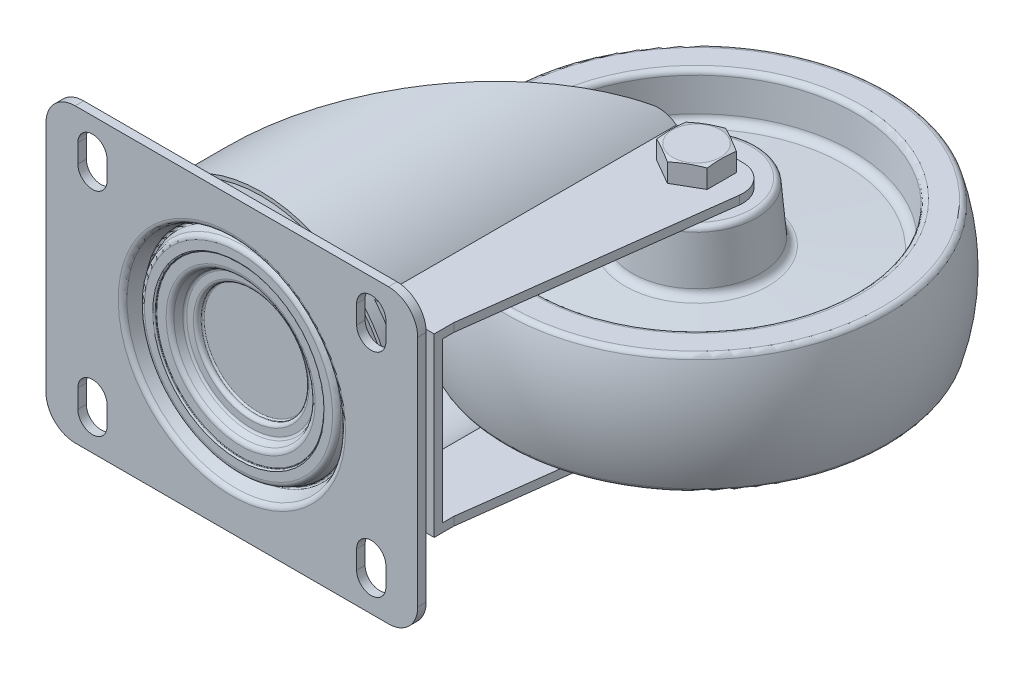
ISO-10303-21;
HEADER;
FILE_DESCRIPTION(('STEP AP214'),'2;1');
FILE_NAME('part.step','',(''),(''),'','','');
FILE_SCHEMA(('AUTOMOTIVE_DESIGN { 1 0 10303 214 1 1 1 1 }'));
ENDSEC;
DATA;
#1=APPLICATION_CONTEXT('core data for automotive mechanical design processes');
#2=APPLICATION_PROTOCOL_DEFINITION('international standard','automotive_design',2000,#1);
#3=PRODUCT_CONTEXT('',#1,'mechanical');
#4=PRODUCT('Part','Part','',(#3));
#5=PRODUCT_RELATED_PRODUCT_CATEGORY('part','',(#4));
#6=PRODUCT_DEFINITION_FORMATION('','',#4);
#7=PRODUCT_DEFINITION_CONTEXT('part definition',#1,'design');
#8=PRODUCT_DEFINITION('design','',#6,#7);
#9=PRODUCT_DEFINITION_SHAPE('','',#8);
#10=(LENGTH_UNIT() NAMED_UNIT(*) SI_UNIT(.MILLI.,.METRE.));
#11=(NAMED_UNIT(*) PLANE_ANGLE_UNIT() SI_UNIT($,.RADIAN.));
#12=(NAMED_UNIT(*) SI_UNIT($,.STERADIAN.) SOLID_ANGLE_UNIT());
#13=UNCERTAINTY_MEASURE_WITH_UNIT(LENGTH_MEASURE(1.E-05),#10,'distance_accuracy_value','');
#14=(GEOMETRIC_REPRESENTATION_CONTEXT(3) GLOBAL_UNCERTAINTY_ASSIGNED_CONTEXT((#13)) GLOBAL_UNIT_ASSIGNED_CONTEXT((#10,
#11,#12)) REPRESENTATION_CONTEXT('',''));
#15=CARTESIAN_POINT('',(0.,0.,0.));
#16=DIRECTION('',(0.,0.,1.));
#17=DIRECTION('',(1.,0.,0.));
#18=AXIS2_PLACEMENT_3D('',#15,#16,#17);
#19=CARTESIAN_POINT('',(108.5,77.2,-119.));
#20=DIRECTION('',(0.,-1.,0.));
#21=DIRECTION('',(-1.,0.,0.));
#22=AXIS2_PLACEMENT_3D('',#19,#20,#21);
#23=PLANE('',#22);
#24=CARTESIAN_POINT('',(108.5,77.2,-119.));
#25=DIRECTION('',(0.,1.,0.));
#26=DIRECTION('',(1.,0.,0.));
#27=AXIS2_PLACEMENT_3D('',#24,#25,#26);
#28=CIRCLE('',#27,9.);
#29=CARTESIAN_POINT('',(117.5,77.2,-119.));
#30=VERTEX_POINT('',#29);
#31=EDGE_CURVE('E483',#30,#30,#28,.T.);
#32=ORIENTED_EDGE('',*,*,#31,.T.);
#33=EDGE_LOOP('',(#32));
#34=FACE_BOUND('',#33,.T.);
#35=ADVANCED_FACE('F14',(#34),#23,.F.);
#36=CARTESIAN_POINT('',(118.,77.2,-124.484827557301));
#37=DIRECTION('',(1.,0.,0.));
#38=DIRECTION('',(0.,0.,1.));
#39=AXIS2_PLACEMENT_3D('',#36,#37,#38);
#40=PLANE('',#39);
#41=CARTESIAN_POINT('',(118.,74.9684484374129,-104.507977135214));
#42=CARTESIAN_POINT('',(118.,75.0649599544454,-104.938771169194));
#43=CARTESIAN_POINT('',(118.,75.1602882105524,-105.369835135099));
#44=CARTESIAN_POINT('',(118.,75.3479395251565,-106.232635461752));
#45=CARTESIAN_POINT('',(118.,75.4402624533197,-106.664371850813));
#46=CARTESIAN_POINT('',(118.,75.6213452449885,-107.529038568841));
#47=CARTESIAN_POINT('',(118.,75.7101015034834,-107.96196965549));
#48=CARTESIAN_POINT('',(118.,75.8830901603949,-108.828734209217));
#49=CARTESIAN_POINT('',(118.,75.9673225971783,-109.26256766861));
#50=CARTESIAN_POINT('',(118.,76.1295343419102,-110.127816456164));
#51=CARTESIAN_POINT('',(118.,76.2075582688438,-110.559223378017));
#52=CARTESIAN_POINT('',(118.,76.3567772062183,-111.423226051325));
#53=CARTESIAN_POINT('',(118.,76.427972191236,-111.855821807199));
#54=CARTESIAN_POINT('',(118.,76.5619234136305,-112.722267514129));
#55=CARTESIAN_POINT('',(118.,76.6246808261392,-113.156117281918));
#56=CARTESIAN_POINT('',(118.,76.7399054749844,-114.025196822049));
#57=CARTESIAN_POINT('',(118.,76.7923727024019,-114.460426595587));
#58=CARTESIAN_POINT('',(118.,76.885527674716,-115.337170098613));
#59=CARTESIAN_POINT('',(118.,76.9260746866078,-115.778699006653));
#60=CARTESIAN_POINT('',(118.,76.9925896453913,-116.662863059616));
#61=CARTESIAN_POINT('',(118.,77.0185579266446,-117.105498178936));
#62=CARTESIAN_POINT('',(118.,77.0544006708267,-117.991232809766));
#63=CARTESIAN_POINT('',(118.,77.0642823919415,-118.434332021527));
#64=CARTESIAN_POINT('',(118.,77.0673449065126,-119.320589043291));
#65=CARTESIAN_POINT('',(118.,77.0605257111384,-119.763746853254));
#66=CARTESIAN_POINT('',(118.,77.0305697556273,-120.651117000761));
#67=CARTESIAN_POINT('',(118.,77.0073735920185,-121.095327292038));
#68=CARTESIAN_POINT('',(118.,76.9459858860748,-121.98270090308));
#69=CARTESIAN_POINT('',(118.,76.9077940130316,-122.425864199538));
#70=CARTESIAN_POINT('',(118.,76.8183397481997,-123.311140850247));
#71=CARTESIAN_POINT('',(118.,76.7670688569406,-123.753253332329));
#72=CARTESIAN_POINT('',(118.,76.6535847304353,-124.636056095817));
#73=CARTESIAN_POINT('',(118.,76.5913714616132,-125.076746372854));
#74=CARTESIAN_POINT('',(118.,76.462351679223,-125.927958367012));
#75=CARTESIAN_POINT('',(118.,76.3961122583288,-126.338566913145));
#76=CARTESIAN_POINT('',(118.,76.2572144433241,-127.158702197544));
#77=CARTESIAN_POINT('',(118.,76.1845558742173,-127.568228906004));
#78=CARTESIAN_POINT('',(118.,76.0339919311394,-128.386354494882));
#79=CARTESIAN_POINT('',(118.,75.9560860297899,-128.794953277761));
#80=CARTESIAN_POINT('',(118.,75.7959946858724,-129.611304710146));
#81=CARTESIAN_POINT('',(118.,75.7138092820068,-130.01905736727));
#82=CARTESIAN_POINT('',(118.,75.5459125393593,-130.833934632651));
#83=CARTESIAN_POINT('',(118.,75.4602003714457,-131.241059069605));
#84=CARTESIAN_POINT('',(118.,75.2858819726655,-132.054688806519));
#85=CARTESIAN_POINT('',(118.,75.1972757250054,-132.461194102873));
#86=CARTESIAN_POINT('',(118.,74.9278968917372,-133.679865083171));
#87=CARTESIAN_POINT('',(118.,74.7435527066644,-134.49124098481));
#88=CARTESIAN_POINT('',(118.,74.3700754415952,-136.104435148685));
#89=CARTESIAN_POINT('',(118.,74.1810076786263,-136.906268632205));
#90=CARTESIAN_POINT('',(118.,73.7981405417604,-138.508818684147));
#91=CARTESIAN_POINT('',(118.,73.6043410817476,-139.30953523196));
#92=CARTESIAN_POINT('',(118.,73.2134911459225,-140.909127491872));
#93=CARTESIAN_POINT('',(118.,73.016444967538,-141.708004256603));
#94=CARTESIAN_POINT('',(118.,72.6196652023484,-143.30506264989));
#95=CARTESIAN_POINT('',(118.,72.4199317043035,-144.103244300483));
#96=CARTESIAN_POINT('',(118.,72.2192459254,-144.901183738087));
#97=B_SPLINE_CURVE_WITH_KNOTS('',3,(#41,#42,#43,#44,#45,#46,#47,#48,#49,#50,#51,#52,#53,#54,#55,
#56,#57,#58,#59,#60,#61,#62,#63,#64,#65,#66,#67,#68,#69,#70,#71,#72,#73,#74,#75,#76,#77,#78,#79,
#80,#81,#82,#83,#84,#85,#86,#87,#88,#89,#90,#91,#92,#93,#94,#95,#96),.UNSPECIFIED.,.F.,.F.,(4,2,
2,2,2,2,2,2,2,2,2,2,2,2,2,2,2,2,2,2,2,2,2,2,2,2,2,4),(0.,1.32442292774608,2.64890321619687,
3.97469017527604,5.3004658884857,6.61563949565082,7.93081799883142,9.24581314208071,
10.5608094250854,11.8907589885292,13.2206780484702,14.5499968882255,15.879314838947,
17.2134795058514,18.5476735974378,19.8827369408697,21.2178043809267,22.4654956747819,
23.7132209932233,24.9610719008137,26.2089115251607,27.4570462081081,28.7051881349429,
31.2013030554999,33.6727539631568,36.1442498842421,38.6127022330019,41.0810732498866),.UNSPECIFIED.);
#98=CARTESIAN_POINT('',(118.,76.6722325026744,-124.484827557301));
#99=VERTEX_POINT('',#98);
#100=CARTESIAN_POINT('',(118.,76.6722325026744,-113.515172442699));
#101=VERTEX_POINT('',#100);
#102=EDGE_CURVE('E439',#99,#101,#97,.F.);
#103=ORIENTED_EDGE('',*,*,#102,.T.);
#104=DIRECTION('',(0.,-1.,0.));
#105=VECTOR('',#104,1.);
#106=CARTESIAN_POINT('',(118.,77.2,-113.515172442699));
#107=LINE('',#106,#105);
#108=CARTESIAN_POINT('',(118.,69.7,-113.515172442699));
#109=VERTEX_POINT('',#108);
#110=EDGE_CURVE('E427',#101,#109,#107,.T.);
#111=ORIENTED_EDGE('',*,*,#110,.T.);
#112=DIRECTION('',(0.,0.,1.));
#113=VECTOR('',#112,1.);
#114=CARTESIAN_POINT('',(118.,69.7,-124.484827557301));
#115=LINE('',#114,#113);
#116=CARTESIAN_POINT('',(118.,69.7,-124.484827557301));
#117=VERTEX_POINT('',#116);
#118=EDGE_CURVE('E403',#117,#109,#115,.T.);
#119=ORIENTED_EDGE('',*,*,#118,.F.);
#120=DIRECTION('',(0.,-1.,0.));
#121=VECTOR('',#120,1.);
#122=CARTESIAN_POINT('',(118.,77.2,-124.484827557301));
#123=LINE('',#122,#121);
#124=EDGE_CURVE('E373',#99,#117,#123,.T.);
#125=ORIENTED_EDGE('',*,*,#124,.F.);
#126=EDGE_LOOP('',(#103,#111,#119,#125));
#127=FACE_BOUND('',#126,.T.);
#128=ADVANCED_FACE('F454',(#127),#40,.T.);
#129=CARTESIAN_POINT('',(118.,77.2,-113.515172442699));
#130=DIRECTION('',(0.5,0.,0.866025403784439));
#131=DIRECTION('',(-0.866025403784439,0.,0.5));
#132=AXIS2_PLACEMENT_3D('',#129,#130,#131);
#133=PLANE('',#132);
#134=CARTESIAN_POINT('',(118.0002,76.6722015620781,-113.515287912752));
#135=CARTESIAN_POINT('',(117.605672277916,76.7332602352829,-113.287507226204));
#136=CARTESIAN_POINT('',(117.210429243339,76.7886913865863,-113.059313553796));
#137=CARTESIAN_POINT('',(116.418547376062,76.886078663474,-112.602120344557));
#138=CARTESIAN_POINT('',(116.021908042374,76.9280293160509,-112.373120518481));
#139=CARTESIAN_POINT('',(115.229638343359,76.9960065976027,-111.915703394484));
#140=CARTESIAN_POINT('',(114.834013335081,77.0221142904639,-111.687289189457));
#141=CARTESIAN_POINT('',(114.042258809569,77.057122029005,-111.23016950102));
#142=CARTESIAN_POINT('',(113.646129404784,77.0660254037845,-111.001464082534));
#143=CARTESIAN_POINT('',(112.853870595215,77.0660254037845,-110.544053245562));
#144=CARTESIAN_POINT('',(112.457741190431,77.057122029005,-110.315347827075));
#145=CARTESIAN_POINT('',(111.665986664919,77.0221142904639,-109.858228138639));
#146=CARTESIAN_POINT('',(111.270361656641,76.9960065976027,-109.629813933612));
#147=CARTESIAN_POINT('',(110.478091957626,76.9280293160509,-109.172396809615));
#148=CARTESIAN_POINT('',(110.081452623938,76.886078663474,-108.943396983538));
#149=CARTESIAN_POINT('',(109.289570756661,76.7886913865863,-108.486203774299));
#150=CARTESIAN_POINT('',(108.894327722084,76.7332602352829,-108.258010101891));
#151=CARTESIAN_POINT('',(108.4998,76.6722015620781,-108.030229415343));
#152=B_SPLINE_CURVE_WITH_KNOTS('',3,(#134,#135,#136,#137,#138,#139,#140,#141,#142,#143,#144,
#145,#146,#147,#148,#149,#150,#151),.UNSPECIFIED.,.F.,.F.,(4,2,2,2,2,2,2,2,4),(0.,
1.3789772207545,2.75851359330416,4.13093041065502,5.50308163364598,6.87523285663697,
8.24764967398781,9.62718604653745,11.0061632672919),.UNSPECIFIED.);
#153=CARTESIAN_POINT('',(108.5,76.6722325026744,-108.030344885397));
#154=VERTEX_POINT('',#153);
#155=EDGE_CURVE('E1346',#101,#154,#152,.T.);
#156=ORIENTED_EDGE('',*,*,#155,.T.);
#157=DIRECTION('',(0.,-1.,0.));
#158=VECTOR('',#157,1.);
#159=CARTESIAN_POINT('',(108.5,77.2,-108.030344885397));
#160=LINE('',#159,#158);
#161=CARTESIAN_POINT('',(108.5,69.7,-108.030344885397));
#162=VERTEX_POINT('',#161);
#163=EDGE_CURVE('E424',#154,#162,#160,.T.);
#164=ORIENTED_EDGE('',*,*,#163,.T.);
#165=DIRECTION('',(-0.866025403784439,0.,0.5));
#166=VECTOR('',#165,1.);
#167=CARTESIAN_POINT('',(118.,69.7,-113.515172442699));
#168=LINE('',#167,#166);
#169=EDGE_CURVE('E404',#109,#162,#168,.T.);
#170=ORIENTED_EDGE('',*,*,#169,.F.);
#171=ORIENTED_EDGE('',*,*,#110,.F.);
#172=EDGE_LOOP('',(#156,#164,#170,#171));
#173=FACE_BOUND('',#172,.T.);
#174=ADVANCED_FACE('F1185',(#173),#133,.T.);
#175=CARTESIAN_POINT('',(108.5,77.2,-108.030344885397));
#176=DIRECTION('',(-0.5,0.,0.866025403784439));
#177=DIRECTION('',(-0.866025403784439,0.,-0.5));
#178=AXIS2_PLACEMENT_3D('',#175,#176,#177);
#179=PLANE('',#178);
#180=CARTESIAN_POINT('',(108.5002,76.6722015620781,-108.030229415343));
#181=CARTESIAN_POINT('',(108.105672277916,76.7332602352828,-108.258010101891));
#182=CARTESIAN_POINT('',(107.710429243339,76.7886913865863,-108.486203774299));
#183=CARTESIAN_POINT('',(106.918547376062,76.886078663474,-108.943396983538));
#184=CARTESIAN_POINT('',(106.521908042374,76.9280293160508,-109.172396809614));
#185=CARTESIAN_POINT('',(105.729638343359,76.9960065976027,-109.629813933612));
#186=CARTESIAN_POINT('',(105.334013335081,77.0221142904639,-109.858228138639));
#187=CARTESIAN_POINT('',(104.542258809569,77.057122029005,-110.315347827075));
#188=CARTESIAN_POINT('',(104.146129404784,77.0660254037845,-110.544053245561));
#189=CARTESIAN_POINT('',(103.353870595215,77.0660254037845,-111.001464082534));
#190=CARTESIAN_POINT('',(102.957741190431,77.057122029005,-111.23016950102));
#191=CARTESIAN_POINT('',(102.165986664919,77.0221142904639,-111.687289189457));
#192=CARTESIAN_POINT('',(101.770361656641,76.9960065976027,-111.915703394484));
#193=CARTESIAN_POINT('',(100.978091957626,76.9280293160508,-112.373120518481));
#194=CARTESIAN_POINT('',(100.581452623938,76.886078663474,-112.602120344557));
#195=CARTESIAN_POINT('',(99.7895707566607,76.7886913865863,-113.059313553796));
#196=CARTESIAN_POINT('',(99.394327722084,76.7332602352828,-113.287507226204));
#197=CARTESIAN_POINT('',(98.9998,76.6722015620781,-113.515287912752));
#198=B_SPLINE_CURVE_WITH_KNOTS('',3,(#180,#181,#182,#183,#184,#185,#186,#187,#188,#189,#190,
#191,#192,#193,#194,#195,#196,#197),.UNSPECIFIED.,.F.,.F.,(4,2,2,2,2,2,2,2,4),(0.,
1.37897722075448,2.75851359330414,4.13093041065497,5.50308163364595,6.87523285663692,
8.24764967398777,9.62718604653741,11.0061632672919),.UNSPECIFIED.);
#199=CARTESIAN_POINT('',(99.,76.6722325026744,-113.515172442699));
#200=VERTEX_POINT('',#199);
#201=EDGE_CURVE('E1339',#154,#200,#198,.T.);
#202=ORIENTED_EDGE('',*,*,#201,.T.);
#203=DIRECTION('',(0.,-1.,0.));
#204=VECTOR('',#203,1.);
#205=CARTESIAN_POINT('',(99.,77.2,-113.515172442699));
#206=LINE('',#205,#204);
#207=CARTESIAN_POINT('',(99.,69.7,-113.515172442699));
#208=VERTEX_POINT('',#207);
#209=EDGE_CURVE('E421',#200,#208,#206,.T.);
#210=ORIENTED_EDGE('',*,*,#209,.T.);
#211=DIRECTION('',(-0.866025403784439,0.,-0.5));
#212=VECTOR('',#211,1.);
#213=CARTESIAN_POINT('',(108.5,69.7,-108.030344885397));
#214=LINE('',#213,#212);
#215=EDGE_CURVE('E411',#162,#208,#214,.T.);
#216=ORIENTED_EDGE('',*,*,#215,.F.);
#217=ORIENTED_EDGE('',*,*,#163,.F.);
#218=EDGE_LOOP('',(#202,#210,#216,#217));
#219=FACE_BOUND('',#218,.T.);
#220=ADVANCED_FACE('F460',(#219),#179,.T.);
#221=CARTESIAN_POINT('',(99.,77.2,-124.484827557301));
#222=DIRECTION('',(-0.5,0.,-0.866025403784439));
#223=DIRECTION('',(0.866025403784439,0.,-0.5));
#224=AXIS2_PLACEMENT_3D('',#221,#222,#223);
#225=PLANE('',#224);
#226=CARTESIAN_POINT('',(98.9998,76.6722015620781,-124.484712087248));
#227=CARTESIAN_POINT('',(99.3943277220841,76.7332602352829,-124.712492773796));
#228=CARTESIAN_POINT('',(99.7895707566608,76.7886913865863,-124.940686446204));
#229=CARTESIAN_POINT('',(100.581452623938,76.886078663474,-125.397879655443));
#230=CARTESIAN_POINT('',(100.978091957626,76.9280293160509,-125.626879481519));
#231=CARTESIAN_POINT('',(101.770361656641,76.9960065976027,-126.084296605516));
#232=CARTESIAN_POINT('',(102.165986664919,77.0221142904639,-126.312710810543));
#233=CARTESIAN_POINT('',(102.957741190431,77.057122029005,-126.76983049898));
#234=CARTESIAN_POINT('',(103.353870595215,77.0660254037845,-126.998535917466));
#235=CARTESIAN_POINT('',(104.146129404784,77.0660254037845,-127.455946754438));
#236=CARTESIAN_POINT('',(104.542258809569,77.057122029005,-127.684652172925));
#237=CARTESIAN_POINT('',(105.334013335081,77.0221142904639,-128.141771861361));
#238=CARTESIAN_POINT('',(105.729638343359,76.9960065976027,-128.370186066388));
#239=CARTESIAN_POINT('',(106.521908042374,76.9280293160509,-128.827603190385));
#240=CARTESIAN_POINT('',(106.918547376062,76.886078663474,-129.056603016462));
#241=CARTESIAN_POINT('',(107.710429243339,76.7886913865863,-129.5137962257));
#242=CARTESIAN_POINT('',(108.105672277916,76.7332602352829,-129.741989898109));
#243=CARTESIAN_POINT('',(108.5002,76.6722015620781,-129.969770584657));
#244=B_SPLINE_CURVE_WITH_KNOTS('',3,(#226,#227,#228,#229,#230,#231,#232,#233,#234,#235,#236,
#237,#238,#239,#240,#241,#242,#243),.UNSPECIFIED.,.F.,.F.,(4,2,2,2,2,2,2,2,4),(0.,
1.37897722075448,2.75851359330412,4.13093041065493,5.50308163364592,6.87523285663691,
8.24764967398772,9.62718604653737,11.0061632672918),.UNSPECIFIED.);
#245=CARTESIAN_POINT('',(99.,76.6722325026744,-124.484827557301));
#246=VERTEX_POINT('',#245);
#247=CARTESIAN_POINT('',(108.5,76.6722325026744,-129.969655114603));
#248=VERTEX_POINT('',#247);
#249=EDGE_CURVE('E465',#246,#248,#244,.T.);
#250=ORIENTED_EDGE('',*,*,#249,.T.);
#251=DIRECTION('',(0.,-1.,0.));
#252=VECTOR('',#251,1.);
#253=CARTESIAN_POINT('',(108.5,77.2,-129.969655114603));
#254=LINE('',#253,#252);
#255=CARTESIAN_POINT('',(108.5,69.7,-129.969655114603));
#256=VERTEX_POINT('',#255);
#257=EDGE_CURVE('E416',#248,#256,#254,.T.);
#258=ORIENTED_EDGE('',*,*,#257,.T.);
#259=DIRECTION('',(0.866025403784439,0.,-0.5));
#260=VECTOR('',#259,1.);
#261=CARTESIAN_POINT('',(99.,69.7,-124.484827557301));
#262=LINE('',#261,#260);
#263=CARTESIAN_POINT('',(106.820508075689,69.7,-129.));
#264=VERTEX_POINT('',#263);
#265=EDGE_CURVE('E401',#264,#256,#262,.T.);
#266=ORIENTED_EDGE('',*,*,#265,.F.);
#267=CARTESIAN_POINT('',(99.,69.7,-124.484827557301));
#268=VERTEX_POINT('',#267);
#269=EDGE_CURVE('E377',#268,#264,#262,.T.);
#270=ORIENTED_EDGE('',*,*,#269,.F.);
#271=DIRECTION('',(0.,-1.,0.));
#272=VECTOR('',#271,1.);
#273=CARTESIAN_POINT('',(99.,77.2,-124.484827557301));
#274=LINE('',#273,#272);
#275=EDGE_CURVE('E417',#246,#268,#274,.T.);
#276=ORIENTED_EDGE('',*,*,#275,.F.);
#277=EDGE_LOOP('',(#250,#258,#266,#270,#276));
#278=FACE_BOUND('',#277,.T.);
#279=ADVANCED_FACE('F453',(#278),#225,.T.);
#280=CARTESIAN_POINT('',(108.5,77.2,-129.969655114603));
#281=DIRECTION('',(0.5,0.,-0.866025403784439));
#282=DIRECTION('',(0.866025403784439,0.,0.5));
#283=AXIS2_PLACEMENT_3D('',#280,#281,#282);
#284=PLANE('',#283);
#285=CARTESIAN_POINT('',(108.4998,76.6722015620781,-129.969770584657));
#286=CARTESIAN_POINT('',(108.894327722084,76.7332602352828,-129.741989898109));
#287=CARTESIAN_POINT('',(109.289570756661,76.7886913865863,-129.513796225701));
#288=CARTESIAN_POINT('',(110.081452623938,76.886078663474,-129.056603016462));
#289=CARTESIAN_POINT('',(110.478091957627,76.9280293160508,-128.827603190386));
#290=CARTESIAN_POINT('',(111.270361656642,76.9960065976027,-128.370186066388));
#291=CARTESIAN_POINT('',(111.665986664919,77.0221142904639,-128.141771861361));
#292=CARTESIAN_POINT('',(112.457741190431,77.057122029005,-127.684652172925));
#293=CARTESIAN_POINT('',(112.853870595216,77.0660254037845,-127.455946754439));
#294=CARTESIAN_POINT('',(113.646129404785,77.0660254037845,-126.998535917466));
#295=CARTESIAN_POINT('',(114.042258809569,77.057122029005,-126.76983049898));
#296=CARTESIAN_POINT('',(114.834013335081,77.0221142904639,-126.312710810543));
#297=CARTESIAN_POINT('',(115.229638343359,76.9960065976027,-126.084296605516));
#298=CARTESIAN_POINT('',(116.021908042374,76.9280293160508,-125.626879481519));
#299=CARTESIAN_POINT('',(116.418547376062,76.886078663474,-125.397879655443));
#300=CARTESIAN_POINT('',(117.210429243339,76.7886913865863,-124.940686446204));
#301=CARTESIAN_POINT('',(117.605672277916,76.7332602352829,-124.712492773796));
#302=CARTESIAN_POINT('',(118.0002,76.6722015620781,-124.484712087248));
#303=B_SPLINE_CURVE_WITH_KNOTS('',3,(#285,#286,#287,#288,#289,#290,#291,#292,#293,#294,#295,
#296,#297,#298,#299,#300,#301,#302),.UNSPECIFIED.,.F.,.F.,(4,2,2,2,2,2,2,2,4),(0.,
1.3789772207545,2.75851359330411,4.13093041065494,5.50308163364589,6.87523285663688,
8.24764967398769,9.62718604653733,11.0061632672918),.UNSPECIFIED.);
#304=EDGE_CURVE('E420',#248,#99,#303,.T.);
#305=ORIENTED_EDGE('',*,*,#304,.T.);
#306=ORIENTED_EDGE('',*,*,#124,.T.);
#307=DIRECTION('',(0.866025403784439,0.,0.5));
#308=VECTOR('',#307,1.);
#309=CARTESIAN_POINT('',(108.5,69.7,-129.969655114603));
#310=LINE('',#309,#308);
#311=CARTESIAN_POINT('',(110.179491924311,69.7,-129.));
#312=VERTEX_POINT('',#311);
#313=EDGE_CURVE('E367',#312,#117,#310,.T.);
#314=ORIENTED_EDGE('',*,*,#313,.F.);
#315=EDGE_CURVE('E371',#256,#312,#310,.T.);
#316=ORIENTED_EDGE('',*,*,#315,.F.);
#317=ORIENTED_EDGE('',*,*,#257,.F.);
#318=EDGE_LOOP('',(#305,#306,#314,#316,#317));
#319=FACE_BOUND('',#318,.T.);
#320=ADVANCED_FACE('F369',(#319),#284,.T.);
#321=CARTESIAN_POINT('',(108.5,69.7,-130.));
#322=DIRECTION('',(0.,1.,0.));
#323=DIRECTION('',(1.,0.,0.));
#324=AXIS2_PLACEMENT_3D('',#321,#322,#323);
#325=PLANE('',#324);
#326=ORIENTED_EDGE('',*,*,#315,.T.);
#327=DIRECTION('',(-1.,0.,0.));
#328=VECTOR('',#327,1.);
#329=CARTESIAN_POINT('',(136.5,69.7,-129.));
#330=LINE('',#329,#328);
#331=EDGE_CURVE('E382',#312,#264,#330,.T.);
#332=ORIENTED_EDGE('',*,*,#331,.T.);
#333=ORIENTED_EDGE('',*,*,#265,.T.);
#334=EDGE_LOOP('',(#326,#332,#333));
#335=FACE_BOUND('',#334,.T.);
#336=ADVANCED_FACE('F400',(#335),#325,.F.);
#337=CARTESIAN_POINT('',(108.5,76.6641016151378,-119.));
#338=DIRECTION('',(0.,-1.,0.));
#339=DIRECTION('',(-1.,0.,0.));
#340=AXIS2_PLACEMENT_3D('',#337,#338,#339);
#341=CONICAL_SURFACE('',#340,11.,1.30899693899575);
#342=ORIENTED_EDGE('',*,*,#31,.F.);
#343=EDGE_LOOP('',(#342));
#344=FACE_BOUND('',#343,.T.);
#345=ORIENTED_EDGE('',*,*,#249,.F.);
#346=CARTESIAN_POINT('',(99.,74.9684484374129,-104.507977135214));
#347=CARTESIAN_POINT('',(99.,75.0649599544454,-104.938771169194));
#348=CARTESIAN_POINT('',(99.,75.1602882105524,-105.369835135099));
#349=CARTESIAN_POINT('',(99.,75.3479395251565,-106.232635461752));
#350=CARTESIAN_POINT('',(99.,75.4402624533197,-106.664371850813));
#351=CARTESIAN_POINT('',(99.,75.6213452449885,-107.529038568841));
#352=CARTESIAN_POINT('',(99.,75.7101015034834,-107.96196965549));
#353=CARTESIAN_POINT('',(99.,75.8830901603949,-108.828734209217));
#354=CARTESIAN_POINT('',(99.,75.9673225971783,-109.26256766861));
#355=CARTESIAN_POINT('',(99.,76.1295343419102,-110.127816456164));
#356=CARTESIAN_POINT('',(99.,76.2075582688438,-110.559223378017));
#357=CARTESIAN_POINT('',(99.,76.3567772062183,-111.423226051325));
#358=CARTESIAN_POINT('',(99.,76.427972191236,-111.855821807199));
#359=CARTESIAN_POINT('',(99.,76.5619234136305,-112.722267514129));
#360=CARTESIAN_POINT('',(99.,76.6246808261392,-113.156117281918));
#361=CARTESIAN_POINT('',(99.,76.7399054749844,-114.025196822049));
#362=CARTESIAN_POINT('',(99.,76.7923727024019,-114.460426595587));
#363=CARTESIAN_POINT('',(99.,76.885527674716,-115.337170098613));
#364=CARTESIAN_POINT('',(99.,76.9260746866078,-115.778699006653));
#365=CARTESIAN_POINT('',(99.,76.9925896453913,-116.662863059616));
#366=CARTESIAN_POINT('',(99.,77.0185579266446,-117.105498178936));
#367=CARTESIAN_POINT('',(99.,77.0544006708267,-117.991232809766));
#368=CARTESIAN_POINT('',(99.,77.0642823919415,-118.434332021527));
#369=CARTESIAN_POINT('',(99.,77.0673449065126,-119.320589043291));
#370=CARTESIAN_POINT('',(99.,77.0605257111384,-119.763746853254));
#371=CARTESIAN_POINT('',(99.,77.0305697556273,-120.651117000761));
#372=CARTESIAN_POINT('',(99.,77.0073735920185,-121.095327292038));
#373=CARTESIAN_POINT('',(99.,76.9459858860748,-121.98270090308));
#374=CARTESIAN_POINT('',(99.,76.9077940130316,-122.425864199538));
#375=CARTESIAN_POINT('',(99.,76.8183397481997,-123.311140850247));
#376=CARTESIAN_POINT('',(99.,76.7670688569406,-123.753253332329));
#377=CARTESIAN_POINT('',(99.,76.6535847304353,-124.636056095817));
#378=CARTESIAN_POINT('',(99.,76.5913714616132,-125.076746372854));
#379=CARTESIAN_POINT('',(99.,76.462351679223,-125.927958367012));
#380=CARTESIAN_POINT('',(99.,76.3961122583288,-126.338566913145));
#381=CARTESIAN_POINT('',(99.,76.2572144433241,-127.158702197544));
#382=CARTESIAN_POINT('',(99.,76.1845558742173,-127.568228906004));
#383=CARTESIAN_POINT('',(99.,76.0339919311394,-128.386354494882));
#384=CARTESIAN_POINT('',(99.,75.9560860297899,-128.794953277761));
#385=CARTESIAN_POINT('',(99.,75.7959946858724,-129.611304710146));
#386=CARTESIAN_POINT('',(99.,75.7138092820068,-130.01905736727));
#387=CARTESIAN_POINT('',(99.,75.5459125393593,-130.833934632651));
#388=CARTESIAN_POINT('',(99.,75.4602003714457,-131.241059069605));
#389=CARTESIAN_POINT('',(99.,75.2858819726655,-132.054688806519));
#390=CARTESIAN_POINT('',(99.,75.1972757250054,-132.461194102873));
#391=CARTESIAN_POINT('',(99.,74.9278968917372,-133.679865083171));
#392=CARTESIAN_POINT('',(99.,74.7435527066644,-134.49124098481));
#393=CARTESIAN_POINT('',(99.,74.3700754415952,-136.104435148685));
#394=CARTESIAN_POINT('',(99.,74.1810076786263,-136.906268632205));
#395=CARTESIAN_POINT('',(99.,73.7981405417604,-138.508818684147));
#396=CARTESIAN_POINT('',(99.,73.6043410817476,-139.30953523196));
#397=CARTESIAN_POINT('',(99.,73.2134911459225,-140.909127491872));
#398=CARTESIAN_POINT('',(99.,73.016444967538,-141.708004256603));
#399=CARTESIAN_POINT('',(99.,72.6196652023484,-143.30506264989));
#400=CARTESIAN_POINT('',(99.,72.4199317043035,-144.103244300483));
#401=CARTESIAN_POINT('',(99.,72.2192459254,-144.901183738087));
#402=B_SPLINE_CURVE_WITH_KNOTS('',3,(#346,#347,#348,#349,#350,#351,#352,#353,#354,#355,#356,
#357,#358,#359,#360,#361,#362,#363,#364,#365,#366,#367,#368,#369,#370,#371,#372,#373,#374,#375,
#376,#377,#378,#379,#380,#381,#382,#383,#384,#385,#386,#387,#388,#389,#390,#391,#392,#393,#394,
#395,#396,#397,#398,#399,#400,#401),.UNSPECIFIED.,.F.,.F.,(4,2,2,2,2,2,2,2,2,2,2,2,2,2,2,2,2,2,
2,2,2,2,2,2,2,2,2,4),(0.,1.32442292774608,2.64890321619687,3.97469017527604,5.3004658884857,
6.61563949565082,7.93081799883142,9.24581314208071,10.5608094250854,11.8907589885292,
13.2206780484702,14.5499968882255,15.879314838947,17.2134795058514,18.5476735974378,
19.8827369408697,21.2178043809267,22.4654956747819,23.7132209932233,24.9610719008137,
26.2089115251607,27.4570462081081,28.7051881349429,31.2013030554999,33.6727539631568,
36.1442498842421,38.6127022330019,41.0810732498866),.UNSPECIFIED.);
#403=EDGE_CURVE('E474',#200,#246,#402,.T.);
#404=ORIENTED_EDGE('',*,*,#403,.F.);
#405=ORIENTED_EDGE('',*,*,#201,.F.);
#406=ORIENTED_EDGE('',*,*,#155,.F.);
#407=ORIENTED_EDGE('',*,*,#102,.F.);
#408=ORIENTED_EDGE('',*,*,#304,.F.);
#409=EDGE_LOOP('',(#345,#404,#405,#406,#407,#408));
#410=FACE_BOUND('',#409,.T.);
#411=ADVANCED_FACE('F446',(#344,#410),#341,.T.);
#412=CARTESIAN_POINT('',(99.,77.2,-113.515172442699));
#413=DIRECTION('',(-1.,0.,0.));
#414=DIRECTION('',(0.,1.,0.));
#415=AXIS2_PLACEMENT_3D('',#412,#413,#414);
#416=PLANE('',#415);
#417=ORIENTED_EDGE('',*,*,#403,.T.);
#418=ORIENTED_EDGE('',*,*,#275,.T.);
#419=DIRECTION('',(0.,0.,-1.));
#420=VECTOR('',#419,1.);
#421=CARTESIAN_POINT('',(99.,69.7,-113.515172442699));
#422=LINE('',#421,#420);
#423=EDGE_CURVE('E414',#208,#268,#422,.T.);
#424=ORIENTED_EDGE('',*,*,#423,.F.);
#425=ORIENTED_EDGE('',*,*,#209,.F.);
#426=EDGE_LOOP('',(#417,#418,#424,#425));
#427=FACE_BOUND('',#426,.T.);
#428=ADVANCED_FACE('F541',(#427),#416,.T.);
#429=CARTESIAN_POINT('',(108.5,3.3,-119.));
#430=DIRECTION('',(0.,1.,0.));
#431=DIRECTION('',(1.,0.,0.));
#432=AXIS2_PLACEMENT_3D('',#429,#430,#431);
#433=CYLINDRICAL_SURFACE('',#432,10.);
#434=CARTESIAN_POINT('',(108.5,66.5,-119.));
#435=DIRECTION('',(0.,1.,0.));
#436=DIRECTION('',(1.,0.,0.));
#437=AXIS2_PLACEMENT_3D('',#434,#435,#436);
#438=CIRCLE('',#437,10.);
#439=CARTESIAN_POINT('',(108.5,66.5,-129.));
#440=VERTEX_POINT('',#439);
#441=EDGE_CURVE('E33',#440,#440,#438,.T.);
#442=ORIENTED_EDGE('',*,*,#441,.F.);
#443=EDGE_LOOP('',(#442));
#444=FACE_BOUND('',#443,.T.);
#445=CARTESIAN_POINT('',(108.5,66.,-119.));
#446=DIRECTION('',(0.,-1.,0.));
#447=DIRECTION('',(1.,0.,0.));
#448=AXIS2_PLACEMENT_3D('',#445,#446,#447);
#449=CIRCLE('',#448,10.);
#450=CARTESIAN_POINT('',(118.5,66.,-119.));
#451=VERTEX_POINT('',#450);
#452=EDGE_CURVE('E24',#451,#451,#449,.T.);
#453=ORIENTED_EDGE('',*,*,#452,.F.);
#454=EDGE_LOOP('',(#453));
#455=FACE_BOUND('',#454,.T.);
#456=ADVANCED_FACE('F1271',(#444,#455),#433,.T.);
#457=CARTESIAN_POINT('',(108.5,7.,-119.));
#458=DIRECTION('',(0.,-1.,0.));
#459=DIRECTION('',(1.,0.,0.));
#460=AXIS2_PLACEMENT_3D('',#457,#458,#459);
#461=CIRCLE('',#460,10.);
#462=CARTESIAN_POINT('',(118.5,7.,-119.));
#463=VERTEX_POINT('',#462);
#464=EDGE_CURVE('E9',#463,#463,#461,.T.);
#465=ORIENTED_EDGE('',*,*,#464,.T.);
#466=EDGE_LOOP('',(#465));
#467=FACE_BOUND('',#466,.T.);
#468=CARTESIAN_POINT('',(108.5,6.5,-119.));
#469=DIRECTION('',(0.,1.,0.));
#470=DIRECTION('',(1.,0.,0.));
#471=AXIS2_PLACEMENT_3D('',#468,#469,#470);
#472=CIRCLE('',#471,10.);
#473=CARTESIAN_POINT('',(108.5,6.5,-129.));
#474=VERTEX_POINT('',#473);
#475=EDGE_CURVE('E665',#474,#474,#472,.T.);
#476=ORIENTED_EDGE('',*,*,#475,.T.);
#477=EDGE_LOOP('',(#476));
#478=FACE_BOUND('',#477,.T.);
#479=ADVANCED_FACE('F512',(#467,#478),#433,.T.);
#480=CARTESIAN_POINT('',(108.5,2.835778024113,-119.));
#481=DIRECTION('',(0.,-1.,0.));
#482=DIRECTION('',(-1.,0.,0.));
#483=AXIS2_PLACEMENT_3D('',#480,#481,#482);
#484=CONICAL_SURFACE('',#483,11.,1.30899693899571);
#485=CARTESIAN_POINT('',(118.0002,2.84387797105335,-124.484712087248));
#486=CARTESIAN_POINT('',(117.605672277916,2.90493664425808,-124.712492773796));
#487=CARTESIAN_POINT('',(117.210429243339,2.96036779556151,-124.940686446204));
#488=CARTESIAN_POINT('',(116.418547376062,3.05775507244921,-125.397879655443));
#489=CARTESIAN_POINT('',(116.021908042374,3.09970572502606,-125.626879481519));
#490=CARTESIAN_POINT('',(115.229638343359,3.16768300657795,-126.084296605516));
#491=CARTESIAN_POINT('',(114.834013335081,3.19379069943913,-126.312710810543));
#492=CARTESIAN_POINT('',(114.042258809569,3.22879843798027,-126.76983049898));
#493=CARTESIAN_POINT('',(113.646129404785,3.23770181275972,-126.998535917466));
#494=CARTESIAN_POINT('',(112.853870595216,3.23770181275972,-127.455946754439));
#495=CARTESIAN_POINT('',(112.457741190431,3.22879843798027,-127.684652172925));
#496=CARTESIAN_POINT('',(111.665986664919,3.19379069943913,-128.141771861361));
#497=CARTESIAN_POINT('',(111.270361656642,3.16768300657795,-128.370186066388));
#498=CARTESIAN_POINT('',(110.478091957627,3.09970572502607,-128.827603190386));
#499=CARTESIAN_POINT('',(110.081452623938,3.05775507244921,-129.056603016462));
#500=CARTESIAN_POINT('',(109.289570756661,2.96036779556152,-129.513796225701));
#501=CARTESIAN_POINT('',(108.894327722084,2.90493664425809,-129.741989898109));
#502=CARTESIAN_POINT('',(108.4998,2.84387797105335,-129.969770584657));
#503=B_SPLINE_CURVE_WITH_KNOTS('',3,(#485,#486,#487,#488,#489,#490,#491,#492,#493,#494,#495,
#496,#497,#498,#499,#500,#501,#502),.UNSPECIFIED.,.F.,.F.,(4,2,2,2,2,2,2,2,4),(0.,
1.3789772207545,2.75851359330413,4.13093041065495,5.50308163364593,6.87523285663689,
8.24764967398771,9.62718604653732,11.0061632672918),.UNSPECIFIED.);
#504=CARTESIAN_POINT('',(118.,2.84390891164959,-124.484827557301));
#505=VERTEX_POINT('',#504);
#506=CARTESIAN_POINT('',(108.5,2.84390891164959,-129.969655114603));
#507=VERTEX_POINT('',#506);
#508=EDGE_CURVE('E563',#505,#507,#503,.T.);
#509=ORIENTED_EDGE('',*,*,#508,.T.);
#510=CARTESIAN_POINT('',(108.5002,2.84387797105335,-129.969770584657));
#511=CARTESIAN_POINT('',(108.105672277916,2.90493664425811,-129.741989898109));
#512=CARTESIAN_POINT('',(107.710429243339,2.96036779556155,-129.5137962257));
#513=CARTESIAN_POINT('',(106.918547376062,3.05775507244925,-129.056603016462));
#514=CARTESIAN_POINT('',(106.521908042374,3.0997057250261,-128.827603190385));
#515=CARTESIAN_POINT('',(105.729638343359,3.16768300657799,-128.370186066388));
#516=CARTESIAN_POINT('',(105.334013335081,3.19379069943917,-128.141771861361));
#517=CARTESIAN_POINT('',(104.542258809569,3.22879843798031,-127.684652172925));
#518=CARTESIAN_POINT('',(104.146129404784,3.23770181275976,-127.455946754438));
#519=CARTESIAN_POINT('',(103.353870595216,3.23770181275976,-126.998535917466));
#520=CARTESIAN_POINT('',(102.957741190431,3.22879843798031,-126.76983049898));
#521=CARTESIAN_POINT('',(102.165986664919,3.19379069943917,-126.312710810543));
#522=CARTESIAN_POINT('',(101.770361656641,3.16768300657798,-126.084296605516));
#523=CARTESIAN_POINT('',(100.978091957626,3.0997057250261,-125.626879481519));
#524=CARTESIAN_POINT('',(100.581452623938,3.05775507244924,-125.397879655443));
#525=CARTESIAN_POINT('',(99.7895707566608,2.96036779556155,-124.940686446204));
#526=CARTESIAN_POINT('',(99.3943277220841,2.9049366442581,-124.712492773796));
#527=CARTESIAN_POINT('',(98.9998,2.84387797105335,-124.484712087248));
#528=B_SPLINE_CURVE_WITH_KNOTS('',3,(#510,#511,#512,#513,#514,#515,#516,#517,#518,#519,#520,
#521,#522,#523,#524,#525,#526,#527),.UNSPECIFIED.,.F.,.F.,(4,2,2,2,2,2,2,2,4),(0.,
1.37897722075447,2.75851359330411,4.13093041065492,5.50308163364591,6.87523285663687,
8.24764967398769,9.62718604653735,11.0061632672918),.UNSPECIFIED.);
#529=CARTESIAN_POINT('',(99.,2.84390891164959,-124.484827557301));
#530=VERTEX_POINT('',#529);
#531=EDGE_CURVE('E570',#507,#530,#528,.T.);
#532=ORIENTED_EDGE('',*,*,#531,.T.);
#533=CARTESIAN_POINT('',(99.,1.13896809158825,-104.502815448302));
#534=CARTESIAN_POINT('',(99.,1.23550265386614,-104.933666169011));
#535=CARTESIAN_POINT('',(99.,1.33085454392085,-105.364786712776));
#536=CARTESIAN_POINT('',(99.,1.51855461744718,-106.227699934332));
#537=CARTESIAN_POINT('',(99.,1.61090267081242,-106.65949264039));
#538=CARTESIAN_POINT('',(99.,1.79203740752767,-107.524271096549));
#539=CARTESIAN_POINT('',(99.,1.88082049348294,-107.957257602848));
#540=CARTESIAN_POINT('',(99.,2.05386503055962,-108.824132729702));
#541=CARTESIAN_POINT('',(99.,2.13812651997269,-109.258021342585));
#542=CARTESIAN_POINT('',(99.,2.30039974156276,-110.123384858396));
#543=CARTESIAN_POINT('',(99.,2.37845600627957,-110.554851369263));
#544=CARTESIAN_POINT('',(99.,2.52774246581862,-111.41897309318));
#545=CARTESIAN_POINT('',(99.,2.59897263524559,-111.851628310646));
#546=CARTESIAN_POINT('',(99.,2.73299735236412,-112.718193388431));
#547=CARTESIAN_POINT('',(99.,2.795793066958,-113.152103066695));
#548=CARTESIAN_POINT('',(99.,2.91109725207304,-114.021302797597));
#549=CARTESIAN_POINT('',(99.,2.96360571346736,-114.45659285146));
#550=CARTESIAN_POINT('',(99.,3.05684596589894,-115.333459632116));
#551=CARTESIAN_POINT('',(99.,3.09743701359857,-115.775051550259));
#552=CARTESIAN_POINT('',(99.,3.16404056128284,-116.659342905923));
#553=CARTESIAN_POINT('',(99.,3.19005339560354,-117.10204231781));
#554=CARTESIAN_POINT('',(99.,3.22598321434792,-117.987906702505));
#555=CARTESIAN_POINT('',(99.,3.23590747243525,-118.431071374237));
#556=CARTESIAN_POINT('',(99.,3.23905027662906,-119.317460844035));
#557=CARTESIAN_POINT('',(99.,3.23226883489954,-119.760685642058));
#558=CARTESIAN_POINT('',(99.,3.20238156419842,-120.648188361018));
#559=CARTESIAN_POINT('',(99.,3.17921640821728,-121.092464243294));
#560=CARTESIAN_POINT('',(99.,3.11788273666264,-121.979969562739));
#561=CARTESIAN_POINT('',(99.,3.07971388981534,-122.423198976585));
#562=CARTESIAN_POINT('',(99.,2.99029781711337,-123.308608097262));
#563=CARTESIAN_POINT('',(99.,2.93904207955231,-123.750786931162));
#564=CARTESIAN_POINT('',(99.,2.82558133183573,-124.633722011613));
#565=CARTESIAN_POINT('',(99.,2.76337628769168,-125.074478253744));
#566=CARTESIAN_POINT('',(99.,2.6344280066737,-125.925414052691));
#567=CARTESIAN_POINT('',(99.,2.56825989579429,-126.335681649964));
#568=CARTESIAN_POINT('',(99.,2.42951201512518,-127.155136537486));
#569=CARTESIAN_POINT('',(99.,2.35693207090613,-127.564323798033));
#570=CARTESIAN_POINT('',(99.,2.20653045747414,-128.381771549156));
#571=CARTESIAN_POINT('',(99.,2.12870826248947,-128.790031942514));
#572=CARTESIAN_POINT('',(99.,1.96878776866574,-129.605707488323));
#573=CARTESIAN_POINT('',(99.,1.88668950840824,-130.013122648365));
#574=CARTESIAN_POINT('',(99.,1.71896943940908,-130.827325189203));
#575=CARTESIAN_POINT('',(99.,1.63334680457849,-131.234112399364));
#576=CARTESIAN_POINT('',(99.,1.45920900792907,-132.047068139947));
#577=CARTESIAN_POINT('',(99.,1.3706938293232,-132.453236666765));
#578=CARTESIAN_POINT('',(99.,1.10158962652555,-133.670897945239));
#579=CARTESIAN_POINT('',(99.,0.917430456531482,-134.481601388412));
#580=CARTESIAN_POINT('',(99.,0.544317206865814,-136.093481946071));
#581=CARTESIAN_POINT('',(99.,0.355428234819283,-136.894674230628));
#582=CARTESIAN_POINT('',(99.,-0.027081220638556,-138.495942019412));
#583=CARTESIAN_POINT('',(99.,-0.220701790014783,-139.29601750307));
#584=CARTESIAN_POINT('',(99.,-0.611194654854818,-140.894329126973));
#585=CARTESIAN_POINT('',(99.,-0.808062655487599,-141.692566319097));
#586=CARTESIAN_POINT('',(99.,-1.20448652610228,-143.288345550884));
#587=CARTESIAN_POINT('',(99.,-1.4040423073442,-144.085887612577));
#588=CARTESIAN_POINT('',(99.,-1.6045506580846,-144.883187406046));
#589=B_SPLINE_CURVE_WITH_KNOTS('',3,(#533,#534,#535,#536,#537,#538,#539,#540,#541,#542,#543,
#544,#545,#546,#547,#548,#549,#550,#551,#552,#553,#554,#555,#556,#557,#558,#559,#560,#561,#562,
#563,#564,#565,#566,#567,#568,#569,#570,#571,#572,#573,#574,#575,#576,#577,#578,#579,#580,#581,
#582,#583,#584,#585,#586,#587,#588),.UNSPECIFIED.,.F.,.F.,(4,2,2,2,2,2,2,2,2,2,2,2,2,2,2,2,2,2,
2,2,2,2,2,2,2,2,2,4),(0.,1.32460398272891,2.6492652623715,3.97523127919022,5.30118606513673,
6.61655289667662,7.93192462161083,9.24711417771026,10.5623049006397,11.8924548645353,
13.2225743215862,14.5520922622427,15.8816092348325,17.2159653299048,18.5503508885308,
19.8856065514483,21.2208663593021,22.4675139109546,23.7141953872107,24.9610020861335,
26.2077975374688,27.4548869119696,28.7019835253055,31.1960082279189,33.6654637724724,
36.1349642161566,38.60142566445,41.0678058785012),.UNSPECIFIED.);
#590=CARTESIAN_POINT('',(99.,2.84390891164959,-113.515172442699));
#591=VERTEX_POINT('',#590);
#592=EDGE_CURVE('E517',#530,#591,#589,.F.);
#593=ORIENTED_EDGE('',*,*,#592,.T.);
#594=CARTESIAN_POINT('',(98.9998,2.84387797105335,-113.515287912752));
#595=CARTESIAN_POINT('',(99.394327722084,2.90493664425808,-113.287507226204));
#596=CARTESIAN_POINT('',(99.7895707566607,2.96036779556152,-113.059313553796));
#597=CARTESIAN_POINT('',(100.581452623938,3.05775507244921,-112.602120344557));
#598=CARTESIAN_POINT('',(100.978091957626,3.09970572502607,-112.373120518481));
#599=CARTESIAN_POINT('',(101.770361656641,3.16768300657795,-111.915703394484));
#600=CARTESIAN_POINT('',(102.165986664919,3.19379069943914,-111.687289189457));
#601=CARTESIAN_POINT('',(102.957741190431,3.22879843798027,-111.23016950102));
#602=CARTESIAN_POINT('',(103.353870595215,3.23770181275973,-111.001464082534));
#603=CARTESIAN_POINT('',(104.146129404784,3.23770181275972,-110.544053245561));
#604=CARTESIAN_POINT('',(104.542258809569,3.22879843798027,-110.315347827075));
#605=CARTESIAN_POINT('',(105.334013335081,3.19379069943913,-109.858228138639));
#606=CARTESIAN_POINT('',(105.729638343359,3.16768300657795,-109.629813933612));
#607=CARTESIAN_POINT('',(106.521908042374,3.09970572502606,-109.172396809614));
#608=CARTESIAN_POINT('',(106.918547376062,3.0577550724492,-108.943396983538));
#609=CARTESIAN_POINT('',(107.710429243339,2.96036779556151,-108.486203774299));
#610=CARTESIAN_POINT('',(108.105672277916,2.90493664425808,-108.258010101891));
#611=CARTESIAN_POINT('',(108.5002,2.84387797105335,-108.030229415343));
#612=B_SPLINE_CURVE_WITH_KNOTS('',3,(#594,#595,#596,#597,#598,#599,#600,#601,#602,#603,#604,
#605,#606,#607,#608,#609,#610,#611),.UNSPECIFIED.,.F.,.F.,(4,2,2,2,2,2,2,2,4),(0.,
1.37897722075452,2.75851359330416,4.13093041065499,5.50308163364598,6.87523285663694,
8.24764967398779,9.62718604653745,11.0061632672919),.UNSPECIFIED.);
#613=CARTESIAN_POINT('',(108.5,2.84390891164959,-108.030344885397));
#614=VERTEX_POINT('',#613);
#615=EDGE_CURVE('E526',#591,#614,#612,.T.);
#616=ORIENTED_EDGE('',*,*,#615,.T.);
#617=CARTESIAN_POINT('',(108.4998,2.84387797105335,-108.030229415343));
#618=CARTESIAN_POINT('',(108.894327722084,2.9049366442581,-108.258010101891));
#619=CARTESIAN_POINT('',(109.289570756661,2.96036779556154,-108.486203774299));
#620=CARTESIAN_POINT('',(110.081452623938,3.05775507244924,-108.943396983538));
#621=CARTESIAN_POINT('',(110.478091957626,3.0997057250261,-109.172396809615));
#622=CARTESIAN_POINT('',(111.270361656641,3.16768300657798,-109.629813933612));
#623=CARTESIAN_POINT('',(111.665986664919,3.19379069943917,-109.858228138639));
#624=CARTESIAN_POINT('',(112.457741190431,3.22879843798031,-110.315347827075));
#625=CARTESIAN_POINT('',(112.853870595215,3.23770181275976,-110.544053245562));
#626=CARTESIAN_POINT('',(113.646129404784,3.23770181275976,-111.001464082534));
#627=CARTESIAN_POINT('',(114.042258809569,3.22879843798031,-111.23016950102));
#628=CARTESIAN_POINT('',(114.834013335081,3.19379069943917,-111.687289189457));
#629=CARTESIAN_POINT('',(115.229638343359,3.16768300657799,-111.915703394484));
#630=CARTESIAN_POINT('',(116.021908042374,3.0997057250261,-112.373120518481));
#631=CARTESIAN_POINT('',(116.418547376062,3.05775507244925,-112.602120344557));
#632=CARTESIAN_POINT('',(117.210429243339,2.96036779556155,-113.059313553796));
#633=CARTESIAN_POINT('',(117.605672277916,2.9049366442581,-113.287507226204));
#634=CARTESIAN_POINT('',(118.0002,2.84387797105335,-113.515287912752));
#635=B_SPLINE_CURVE_WITH_KNOTS('',3,(#617,#618,#619,#620,#621,#622,#623,#624,#625,#626,#627,
#628,#629,#630,#631,#632,#633,#634),.UNSPECIFIED.,.F.,.F.,(4,2,2,2,2,2,2,2,4),(0.,
1.37897722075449,2.75851359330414,4.13093041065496,5.50308163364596,6.87523285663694,
8.24764967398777,9.62718604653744,11.0061632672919),.UNSPECIFIED.);
#636=CARTESIAN_POINT('',(118.,2.84390891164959,-113.515172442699));
#637=VERTEX_POINT('',#636);
#638=EDGE_CURVE('E550',#614,#637,#635,.T.);
#639=ORIENTED_EDGE('',*,*,#638,.T.);
#640=CARTESIAN_POINT('',(118.,1.13896809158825,-104.502815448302));
#641=CARTESIAN_POINT('',(118.,1.23550265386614,-104.933666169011));
#642=CARTESIAN_POINT('',(118.,1.33085454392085,-105.364786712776));
#643=CARTESIAN_POINT('',(118.,1.51855461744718,-106.227699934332));
#644=CARTESIAN_POINT('',(118.,1.61090267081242,-106.65949264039));
#645=CARTESIAN_POINT('',(118.,1.79203740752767,-107.524271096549));
#646=CARTESIAN_POINT('',(118.,1.88082049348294,-107.957257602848));
#647=CARTESIAN_POINT('',(118.,2.05386503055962,-108.824132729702));
#648=CARTESIAN_POINT('',(118.,2.13812651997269,-109.258021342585));
#649=CARTESIAN_POINT('',(118.,2.30039974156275,-110.123384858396));
#650=CARTESIAN_POINT('',(118.,2.37845600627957,-110.554851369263));
#651=CARTESIAN_POINT('',(118.,2.52774246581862,-111.41897309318));
#652=CARTESIAN_POINT('',(118.,2.59897263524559,-111.851628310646));
#653=CARTESIAN_POINT('',(118.,2.73299735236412,-112.718193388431));
#654=CARTESIAN_POINT('',(118.,2.795793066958,-113.152103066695));
#655=CARTESIAN_POINT('',(118.,2.91109725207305,-114.021302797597));
#656=CARTESIAN_POINT('',(118.,2.96360571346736,-114.45659285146));
#657=CARTESIAN_POINT('',(118.,3.05684596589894,-115.333459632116));
#658=CARTESIAN_POINT('',(118.,3.09743701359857,-115.775051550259));
#659=CARTESIAN_POINT('',(118.,3.16404056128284,-116.659342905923));
#660=CARTESIAN_POINT('',(118.,3.19005339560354,-117.10204231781));
#661=CARTESIAN_POINT('',(118.,3.22598321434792,-117.987906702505));
#662=CARTESIAN_POINT('',(118.,3.23590747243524,-118.431071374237));
#663=CARTESIAN_POINT('',(118.,3.23905027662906,-119.317460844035));
#664=CARTESIAN_POINT('',(118.,3.23226883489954,-119.760685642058));
#665=CARTESIAN_POINT('',(118.,3.20238156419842,-120.648188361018));
#666=CARTESIAN_POINT('',(118.,3.17921640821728,-121.092464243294));
#667=CARTESIAN_POINT('',(118.,3.11788273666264,-121.979969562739));
#668=CARTESIAN_POINT('',(118.,3.07971388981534,-122.423198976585));
#669=CARTESIAN_POINT('',(118.,2.99029781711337,-123.308608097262));
#670=CARTESIAN_POINT('',(118.,2.93904207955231,-123.750786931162));
#671=CARTESIAN_POINT('',(118.,2.82558133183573,-124.633722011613));
#672=CARTESIAN_POINT('',(118.,2.76337628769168,-125.074478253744));
#673=CARTESIAN_POINT('',(118.,2.6344280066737,-125.925414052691));
#674=CARTESIAN_POINT('',(118.,2.56825989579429,-126.335681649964));
#675=CARTESIAN_POINT('',(118.,2.42951201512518,-127.155136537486));
#676=CARTESIAN_POINT('',(118.,2.35693207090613,-127.564323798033));
#677=CARTESIAN_POINT('',(118.,2.20653045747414,-128.381771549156));
#678=CARTESIAN_POINT('',(118.,2.12870826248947,-128.790031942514));
#679=CARTESIAN_POINT('',(118.,1.96878776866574,-129.605707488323));
#680=CARTESIAN_POINT('',(118.,1.88668950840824,-130.013122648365));
#681=CARTESIAN_POINT('',(118.,1.71896943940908,-130.827325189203));
#682=CARTESIAN_POINT('',(118.,1.63334680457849,-131.234112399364));
#683=CARTESIAN_POINT('',(118.,1.45920900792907,-132.047068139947));
#684=CARTESIAN_POINT('',(118.,1.3706938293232,-132.453236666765));
#685=CARTESIAN_POINT('',(118.,1.10158962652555,-133.670897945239));
#686=CARTESIAN_POINT('',(118.,0.917430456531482,-134.481601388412));
#687=CARTESIAN_POINT('',(118.,0.544317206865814,-136.093481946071));
#688=CARTESIAN_POINT('',(118.,0.355428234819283,-136.894674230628));
#689=CARTESIAN_POINT('',(118.,-0.027081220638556,-138.495942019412));
#690=CARTESIAN_POINT('',(118.,-0.220701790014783,-139.29601750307));
#691=CARTESIAN_POINT('',(118.,-0.611194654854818,-140.894329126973));
#692=CARTESIAN_POINT('',(118.,-0.808062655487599,-141.692566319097));
#693=CARTESIAN_POINT('',(118.,-1.20448652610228,-143.288345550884));
#694=CARTESIAN_POINT('',(118.,-1.4040423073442,-144.085887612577));
#695=CARTESIAN_POINT('',(118.,-1.6045506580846,-144.883187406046));
#696=B_SPLINE_CURVE_WITH_KNOTS('',3,(#640,#641,#642,#643,#644,#645,#646,#647,#648,#649,#650,
#651,#652,#653,#654,#655,#656,#657,#658,#659,#660,#661,#662,#663,#664,#665,#666,#667,#668,#669,
#670,#671,#672,#673,#674,#675,#676,#677,#678,#679,#680,#681,#682,#683,#684,#685,#686,#687,#688,
#689,#690,#691,#692,#693,#694,#695),.UNSPECIFIED.,.F.,.F.,(4,2,2,2,2,2,2,2,2,2,2,2,2,2,2,2,2,2,
2,2,2,2,2,2,2,2,2,4),(0.,1.32460398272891,2.6492652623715,3.97523127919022,5.30118606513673,
6.61655289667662,7.93192462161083,9.24711417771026,10.5623049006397,11.8924548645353,
13.2225743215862,14.5520922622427,15.8816092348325,17.2159653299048,18.5503508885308,
19.8856065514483,21.2208663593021,22.4675139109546,23.7141953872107,24.9610020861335,
26.2077975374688,27.4548869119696,28.7019835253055,31.1960082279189,33.6654637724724,
36.1349642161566,38.60142566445,41.0678058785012),.UNSPECIFIED.);
#697=EDGE_CURVE('E556',#637,#505,#696,.T.);
#698=ORIENTED_EDGE('',*,*,#697,.T.);
#699=EDGE_LOOP('',(#509,#532,#593,#616,#639,#698));
#700=FACE_BOUND('',#699,.T.);
#701=CARTESIAN_POINT('',(108.5,3.3,-119.));
#702=DIRECTION('',(0.,1.,0.));
#703=DIRECTION('',(1.,0.,0.));
#704=AXIS2_PLACEMENT_3D('',#701,#702,#703);
#705=CIRCLE('',#704,9.2675);
#706=CARTESIAN_POINT('',(117.7675,3.3,-119.));
#707=VERTEX_POINT('',#706);
#708=EDGE_CURVE('E2331',#707,#707,#705,.T.);
#709=ORIENTED_EDGE('',*,*,#708,.F.);
#710=EDGE_LOOP('',(#709));
#711=FACE_BOUND('',#710,.T.);
#712=ADVANCED_FACE('F534',(#700,#711),#484,.T.);
#713=CARTESIAN_POINT('',(99.,-10.15,-124.484827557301));
#714=DIRECTION('',(0.5,0.,0.866025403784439));
#715=DIRECTION('',(-0.866025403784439,0.,0.5));
#716=AXIS2_PLACEMENT_3D('',#713,#714,#715);
#717=PLANE('',#716);
#718=DIRECTION('',(0.,1.,0.));
#719=VECTOR('',#718,1.);
#720=CARTESIAN_POINT('',(108.5,-10.15,-129.969655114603));
#721=LINE('',#720,#719);
#722=CARTESIAN_POINT('',(108.5,-6.2439089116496,-129.969655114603));
#723=VERTEX_POINT('',#722);
#724=EDGE_CURVE('E527',#723,#507,#721,.T.);
#725=ORIENTED_EDGE('',*,*,#724,.F.);
#726=CARTESIAN_POINT('',(98.9998,-6.24387797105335,-124.484712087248));
#727=CARTESIAN_POINT('',(99.3943277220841,-6.3049366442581,-124.712492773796));
#728=CARTESIAN_POINT('',(99.7895707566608,-6.36036779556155,-124.940686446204));
#729=CARTESIAN_POINT('',(100.581452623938,-6.45775507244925,-125.397879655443));
#730=CARTESIAN_POINT('',(100.978091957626,-6.4997057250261,-125.626879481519));
#731=CARTESIAN_POINT('',(101.770361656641,-6.56768300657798,-126.084296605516));
#732=CARTESIAN_POINT('',(102.165986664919,-6.59379069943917,-126.312710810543));
#733=CARTESIAN_POINT('',(102.957741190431,-6.62879843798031,-126.76983049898));
#734=CARTESIAN_POINT('',(103.353870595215,-6.63770181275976,-126.998535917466));
#735=CARTESIAN_POINT('',(104.146129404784,-6.63770181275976,-127.455946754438));
#736=CARTESIAN_POINT('',(104.542258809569,-6.62879843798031,-127.684652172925));
#737=CARTESIAN_POINT('',(105.334013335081,-6.59379069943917,-128.141771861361));
#738=CARTESIAN_POINT('',(105.729638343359,-6.56768300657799,-128.370186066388));
#739=CARTESIAN_POINT('',(106.521908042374,-6.4997057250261,-128.827603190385));
#740=CARTESIAN_POINT('',(106.918547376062,-6.45775507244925,-129.056603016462));
#741=CARTESIAN_POINT('',(107.710429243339,-6.36036779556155,-129.5137962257));
#742=CARTESIAN_POINT('',(108.105672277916,-6.30493664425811,-129.741989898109));
#743=CARTESIAN_POINT('',(108.5002,-6.24387797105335,-129.969770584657));
#744=B_SPLINE_CURVE_WITH_KNOTS('',3,(#726,#727,#728,#729,#730,#731,#732,#733,#734,#735,#736,
#737,#738,#739,#740,#741,#742,#743),.UNSPECIFIED.,.F.,.F.,(4,2,2,2,2,2,2,2,4),(0.,
1.37897722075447,2.75851359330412,4.13093041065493,5.50308163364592,6.87523285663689,
8.24764967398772,9.62718604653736,11.0061632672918),.UNSPECIFIED.);
#745=CARTESIAN_POINT('',(99.,-6.2439089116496,-124.484827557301));
#746=VERTEX_POINT('',#745);
#747=EDGE_CURVE('E392',#746,#723,#744,.T.);
#748=ORIENTED_EDGE('',*,*,#747,.F.);
#749=DIRECTION('',(0.,1.,0.));
#750=VECTOR('',#749,1.);
#751=CARTESIAN_POINT('',(99.,-10.15,-124.484827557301));
#752=LINE('',#751,#750);
#753=EDGE_CURVE('E1129',#746,#530,#752,.T.);
#754=ORIENTED_EDGE('',*,*,#753,.T.);
#755=ORIENTED_EDGE('',*,*,#531,.F.);
#756=EDGE_LOOP('',(#725,#748,#754,#755));
#757=FACE_BOUND('',#756,.T.);
#758=ADVANCED_FACE('F537',(#757),#717,.F.);
#759=CARTESIAN_POINT('',(108.5,-10.15,-129.969655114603));
#760=DIRECTION('',(-0.5,0.,0.866025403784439));
#761=DIRECTION('',(-0.866025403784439,0.,-0.5));
#762=AXIS2_PLACEMENT_3D('',#759,#760,#761);
#763=PLANE('',#762);
#764=DIRECTION('',(0.,1.,0.));
#765=VECTOR('',#764,1.);
#766=CARTESIAN_POINT('',(118.,-10.15,-124.484827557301));
#767=LINE('',#766,#765);
#768=CARTESIAN_POINT('',(118.,-6.2439089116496,-124.484827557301));
#769=VERTEX_POINT('',#768);
#770=EDGE_CURVE('E1141',#769,#505,#767,.T.);
#771=ORIENTED_EDGE('',*,*,#770,.F.);
#772=CARTESIAN_POINT('',(108.4998,-6.24387797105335,-129.969770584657));
#773=CARTESIAN_POINT('',(108.894327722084,-6.30493664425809,-129.741989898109));
#774=CARTESIAN_POINT('',(109.289570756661,-6.36036779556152,-129.513796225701));
#775=CARTESIAN_POINT('',(110.081452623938,-6.45775507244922,-129.056603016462));
#776=CARTESIAN_POINT('',(110.478091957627,-6.49970572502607,-128.827603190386));
#777=CARTESIAN_POINT('',(111.270361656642,-6.56768300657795,-128.370186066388));
#778=CARTESIAN_POINT('',(111.665986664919,-6.59379069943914,-128.141771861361));
#779=CARTESIAN_POINT('',(112.457741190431,-6.62879843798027,-127.684652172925));
#780=CARTESIAN_POINT('',(112.853870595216,-6.63770181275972,-127.455946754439));
#781=CARTESIAN_POINT('',(113.646129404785,-6.63770181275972,-126.998535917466));
#782=CARTESIAN_POINT('',(114.042258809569,-6.62879843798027,-126.76983049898));
#783=CARTESIAN_POINT('',(114.834013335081,-6.59379069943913,-126.312710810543));
#784=CARTESIAN_POINT('',(115.229638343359,-6.56768300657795,-126.084296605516));
#785=CARTESIAN_POINT('',(116.021908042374,-6.49970572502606,-125.626879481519));
#786=CARTESIAN_POINT('',(116.418547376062,-6.45775507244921,-125.397879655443));
#787=CARTESIAN_POINT('',(117.210429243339,-6.36036779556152,-124.940686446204));
#788=CARTESIAN_POINT('',(117.605672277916,-6.30493664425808,-124.712492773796));
#789=CARTESIAN_POINT('',(118.0002,-6.24387797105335,-124.484712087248));
#790=B_SPLINE_CURVE_WITH_KNOTS('',3,(#772,#773,#774,#775,#776,#777,#778,#779,#780,#781,#782,
#783,#784,#785,#786,#787,#788,#789),.UNSPECIFIED.,.F.,.F.,(4,2,2,2,2,2,2,2,4),(0.,
1.37897722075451,2.75851359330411,4.13093041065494,5.50308163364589,6.87523285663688,
8.24764967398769,9.62718604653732,11.0061632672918),.UNSPECIFIED.);
#791=EDGE_CURVE('E585',#723,#769,#790,.T.);
#792=ORIENTED_EDGE('',*,*,#791,.F.);
#793=ORIENTED_EDGE('',*,*,#724,.T.);
#794=ORIENTED_EDGE('',*,*,#508,.F.);
#795=EDGE_LOOP('',(#771,#792,#793,#794));
#796=FACE_BOUND('',#795,.T.);
#797=ADVANCED_FACE('F576',(#796),#763,.F.);
#798=CARTESIAN_POINT('',(118.,-10.15,-124.484827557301));
#799=DIRECTION('',(-1.,0.,0.));
#800=DIRECTION('',(0.,0.,-1.));
#801=AXIS2_PLACEMENT_3D('',#798,#799,#800);
#802=PLANE('',#801);
#803=DIRECTION('',(0.,1.,0.));
#804=VECTOR('',#803,1.);
#805=CARTESIAN_POINT('',(118.,-10.15,-113.515172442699));
#806=LINE('',#805,#804);
#807=CARTESIAN_POINT('',(118.,-6.2439089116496,-113.515172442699));
#808=VERTEX_POINT('',#807);
#809=EDGE_CURVE('E1139',#808,#637,#806,.T.);
#810=ORIENTED_EDGE('',*,*,#809,.F.);
#811=CARTESIAN_POINT('',(118.,-4.53896809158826,-104.502815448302));
#812=CARTESIAN_POINT('',(118.,-4.63550265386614,-104.933666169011));
#813=CARTESIAN_POINT('',(118.,-4.73085454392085,-105.364786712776));
#814=CARTESIAN_POINT('',(118.,-4.91855461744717,-106.227699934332));
#815=CARTESIAN_POINT('',(118.,-5.01090267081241,-106.65949264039));
#816=CARTESIAN_POINT('',(118.,-5.19203740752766,-107.524271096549));
#817=CARTESIAN_POINT('',(118.,-5.28082049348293,-107.957257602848));
#818=CARTESIAN_POINT('',(118.,-5.4538650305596,-108.824132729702));
#819=CARTESIAN_POINT('',(118.,-5.53812651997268,-109.258021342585));
#820=CARTESIAN_POINT('',(118.,-5.70039974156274,-110.123384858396));
#821=CARTESIAN_POINT('',(118.,-5.77845600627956,-110.554851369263));
#822=CARTESIAN_POINT('',(118.,-5.9277424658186,-111.41897309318));
#823=CARTESIAN_POINT('',(118.,-5.99897263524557,-111.851628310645));
#824=CARTESIAN_POINT('',(118.,-6.1329973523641,-112.718193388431));
#825=CARTESIAN_POINT('',(118.,-6.19579306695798,-113.152103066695));
#826=CARTESIAN_POINT('',(118.,-6.31109725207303,-114.021302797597));
#827=CARTESIAN_POINT('',(118.,-6.36360571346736,-114.456592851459));
#828=CARTESIAN_POINT('',(118.,-6.45684596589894,-115.333459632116));
#829=CARTESIAN_POINT('',(118.,-6.49743701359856,-115.775051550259));
#830=CARTESIAN_POINT('',(118.,-6.56404056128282,-116.659342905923));
#831=CARTESIAN_POINT('',(118.,-6.59005339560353,-117.10204231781));
#832=CARTESIAN_POINT('',(118.,-6.62598321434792,-117.987906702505));
#833=CARTESIAN_POINT('',(118.,-6.63590747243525,-118.431071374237));
#834=CARTESIAN_POINT('',(118.,-6.63905027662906,-119.317460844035));
#835=CARTESIAN_POINT('',(118.,-6.63226883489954,-119.760685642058));
#836=CARTESIAN_POINT('',(118.,-6.60238156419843,-120.648188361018));
#837=CARTESIAN_POINT('',(118.,-6.57921640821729,-121.092464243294));
#838=CARTESIAN_POINT('',(118.,-6.51788273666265,-121.979969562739));
#839=CARTESIAN_POINT('',(118.,-6.47971388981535,-122.423198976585));
#840=CARTESIAN_POINT('',(118.,-6.39029781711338,-123.308608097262));
#841=CARTESIAN_POINT('',(118.,-6.33904207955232,-123.750786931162));
#842=CARTESIAN_POINT('',(118.,-6.22558133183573,-124.633722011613));
#843=CARTESIAN_POINT('',(118.,-6.16337628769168,-125.074478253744));
#844=CARTESIAN_POINT('',(118.,-6.03442800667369,-125.925414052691));
#845=CARTESIAN_POINT('',(118.,-5.96825989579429,-126.335681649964));
#846=CARTESIAN_POINT('',(118.,-5.82951201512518,-127.155136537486));
#847=CARTESIAN_POINT('',(118.,-5.75693207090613,-127.564323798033));
#848=CARTESIAN_POINT('',(118.,-5.60653045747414,-128.381771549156));
#849=CARTESIAN_POINT('',(118.,-5.52870826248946,-128.790031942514));
#850=CARTESIAN_POINT('',(118.,-5.36878776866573,-129.605707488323));
#851=CARTESIAN_POINT('',(118.,-5.28668950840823,-130.013122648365));
#852=CARTESIAN_POINT('',(118.,-5.11896943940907,-130.827325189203));
#853=CARTESIAN_POINT('',(118.,-5.03334680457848,-131.234112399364));
#854=CARTESIAN_POINT('',(118.,-4.85920900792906,-132.047068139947));
#855=CARTESIAN_POINT('',(118.,-4.77069382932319,-132.453236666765));
#856=CARTESIAN_POINT('',(118.,-4.50158962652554,-133.670897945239));
#857=CARTESIAN_POINT('',(118.,-4.31743045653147,-134.481601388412));
#858=CARTESIAN_POINT('',(118.,-3.9443172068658,-136.093481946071));
#859=CARTESIAN_POINT('',(118.,-3.75542823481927,-136.894674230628));
#860=CARTESIAN_POINT('',(118.,-3.37291877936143,-138.495942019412));
#861=CARTESIAN_POINT('',(118.,-3.17929820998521,-139.29601750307));
#862=CARTESIAN_POINT('',(118.,-2.78880534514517,-140.894329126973));
#863=CARTESIAN_POINT('',(118.,-2.59193734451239,-141.692566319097));
#864=CARTESIAN_POINT('',(118.,-2.19551347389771,-143.288345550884));
#865=CARTESIAN_POINT('',(118.,-1.9959576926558,-144.085887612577));
#866=CARTESIAN_POINT('',(118.,-1.7954493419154,-144.883187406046));
#867=B_SPLINE_CURVE_WITH_KNOTS('',3,(#811,#812,#813,#814,#815,#816,#817,#818,#819,#820,#821,
#822,#823,#824,#825,#826,#827,#828,#829,#830,#831,#832,#833,#834,#835,#836,#837,#838,#839,#840,
#841,#842,#843,#844,#845,#846,#847,#848,#849,#850,#851,#852,#853,#854,#855,#856,#857,#858,#859,
#860,#861,#862,#863,#864,#865,#866),.UNSPECIFIED.,.F.,.F.,(4,2,2,2,2,2,2,2,2,2,2,2,2,2,2,2,2,2,
2,2,2,2,2,2,2,2,2,4),(0.,1.32460398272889,2.64926526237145,3.97523127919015,5.30118606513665,
6.6165528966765,7.93192462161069,9.24711417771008,10.5623049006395,11.8924548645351,
13.222574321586,14.5520922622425,15.8816092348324,17.2159653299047,18.5503508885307,
19.8856065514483,21.2208663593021,22.4675139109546,23.7141953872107,24.9610020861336,
26.2077975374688,27.4548869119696,28.7019835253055,31.196008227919,33.6654637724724,
36.1349642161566,38.60142566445,41.0678058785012),.UNSPECIFIED.);
#868=EDGE_CURVE('E593',#769,#808,#867,.F.);
#869=ORIENTED_EDGE('',*,*,#868,.F.);
#870=ORIENTED_EDGE('',*,*,#770,.T.);
#871=ORIENTED_EDGE('',*,*,#697,.F.);
#872=EDGE_LOOP('',(#810,#869,#870,#871));
#873=FACE_BOUND('',#872,.T.);
#874=ADVANCED_FACE('F579',(#873),#802,.F.);
#875=CARTESIAN_POINT('',(118.,-10.15,-113.515172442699));
#876=DIRECTION('',(-0.5,0.,-0.866025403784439));
#877=DIRECTION('',(0.866025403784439,0.,-0.5));
#878=AXIS2_PLACEMENT_3D('',#875,#876,#877);
#879=PLANE('',#878);
#880=DIRECTION('',(0.,1.,0.));
#881=VECTOR('',#880,1.);
#882=CARTESIAN_POINT('',(108.5,-10.15,-108.030344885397));
#883=LINE('',#882,#881);
#884=CARTESIAN_POINT('',(108.5,-6.2439089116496,-108.030344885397));
#885=VERTEX_POINT('',#884);
#886=EDGE_CURVE('E1136',#885,#614,#883,.T.);
#887=ORIENTED_EDGE('',*,*,#886,.F.);
#888=CARTESIAN_POINT('',(118.0002,-6.24387797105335,-113.515287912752));
#889=CARTESIAN_POINT('',(117.605672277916,-6.3049366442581,-113.287507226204));
#890=CARTESIAN_POINT('',(117.210429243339,-6.36036779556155,-113.059313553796));
#891=CARTESIAN_POINT('',(116.418547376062,-6.45775507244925,-112.602120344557));
#892=CARTESIAN_POINT('',(116.021908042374,-6.49970572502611,-112.373120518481));
#893=CARTESIAN_POINT('',(115.229638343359,-6.56768300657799,-111.915703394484));
#894=CARTESIAN_POINT('',(114.834013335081,-6.59379069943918,-111.687289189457));
#895=CARTESIAN_POINT('',(114.042258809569,-6.62879843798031,-111.23016950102));
#896=CARTESIAN_POINT('',(113.646129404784,-6.63770181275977,-111.001464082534));
#897=CARTESIAN_POINT('',(112.853870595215,-6.63770181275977,-110.544053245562));
#898=CARTESIAN_POINT('',(112.457741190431,-6.62879843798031,-110.315347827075));
#899=CARTESIAN_POINT('',(111.665986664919,-6.59379069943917,-109.858228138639));
#900=CARTESIAN_POINT('',(111.270361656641,-6.56768300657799,-109.629813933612));
#901=CARTESIAN_POINT('',(110.478091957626,-6.4997057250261,-109.172396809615));
#902=CARTESIAN_POINT('',(110.081452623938,-6.45775507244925,-108.943396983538));
#903=CARTESIAN_POINT('',(109.289570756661,-6.36036779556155,-108.486203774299));
#904=CARTESIAN_POINT('',(108.894327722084,-6.3049366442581,-108.258010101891));
#905=CARTESIAN_POINT('',(108.4998,-6.24387797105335,-108.030229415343));
#906=B_SPLINE_CURVE_WITH_KNOTS('',3,(#888,#889,#890,#891,#892,#893,#894,#895,#896,#897,#898,
#899,#900,#901,#902,#903,#904,#905),.UNSPECIFIED.,.F.,.F.,(4,2,2,2,2,2,2,2,4),(0.,
1.3789772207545,2.75851359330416,4.13093041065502,5.50308163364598,6.87523285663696,
8.24764967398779,9.62718604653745,11.0061632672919),.UNSPECIFIED.);
#907=EDGE_CURVE('E1162',#808,#885,#906,.T.);
#908=ORIENTED_EDGE('',*,*,#907,.F.);
#909=ORIENTED_EDGE('',*,*,#809,.T.);
#910=ORIENTED_EDGE('',*,*,#638,.F.);
#911=EDGE_LOOP('',(#887,#908,#909,#910));
#912=FACE_BOUND('',#911,.T.);
#913=ADVANCED_FACE('F1161',(#912),#879,.F.);
#914=CARTESIAN_POINT('',(108.5,-10.15,-108.030344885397));
#915=DIRECTION('',(0.5,0.,-0.866025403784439));
#916=DIRECTION('',(0.866025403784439,0.,0.5));
#917=AXIS2_PLACEMENT_3D('',#914,#915,#916);
#918=PLANE('',#917);
#919=DIRECTION('',(0.,1.,0.));
#920=VECTOR('',#919,1.);
#921=CARTESIAN_POINT('',(99.,-10.15,-113.515172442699));
#922=LINE('',#921,#920);
#923=CARTESIAN_POINT('',(99.,-6.2439089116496,-113.515172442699));
#924=VERTEX_POINT('',#923);
#925=EDGE_CURVE('E1134',#924,#591,#922,.T.);
#926=ORIENTED_EDGE('',*,*,#925,.F.);
#927=CARTESIAN_POINT('',(108.5002,-6.24387797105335,-108.030229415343));
#928=CARTESIAN_POINT('',(108.105672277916,-6.30493664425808,-108.258010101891));
#929=CARTESIAN_POINT('',(107.710429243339,-6.36036779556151,-108.486203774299));
#930=CARTESIAN_POINT('',(106.918547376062,-6.45775507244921,-108.943396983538));
#931=CARTESIAN_POINT('',(106.521908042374,-6.49970572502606,-109.172396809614));
#932=CARTESIAN_POINT('',(105.729638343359,-6.56768300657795,-109.629813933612));
#933=CARTESIAN_POINT('',(105.334013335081,-6.59379069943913,-109.858228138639));
#934=CARTESIAN_POINT('',(104.542258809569,-6.62879843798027,-110.315347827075));
#935=CARTESIAN_POINT('',(104.146129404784,-6.63770181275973,-110.544053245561));
#936=CARTESIAN_POINT('',(103.353870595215,-6.63770181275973,-111.001464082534));
#937=CARTESIAN_POINT('',(102.957741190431,-6.62879843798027,-111.23016950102));
#938=CARTESIAN_POINT('',(102.165986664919,-6.59379069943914,-111.687289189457));
#939=CARTESIAN_POINT('',(101.770361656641,-6.56768300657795,-111.915703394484));
#940=CARTESIAN_POINT('',(100.978091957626,-6.49970572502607,-112.373120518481));
#941=CARTESIAN_POINT('',(100.581452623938,-6.45775507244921,-112.602120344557));
#942=CARTESIAN_POINT('',(99.7895707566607,-6.36036779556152,-113.059313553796));
#943=CARTESIAN_POINT('',(99.394327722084,-6.30493664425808,-113.287507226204));
#944=CARTESIAN_POINT('',(98.9998,-6.24387797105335,-113.515287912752));
#945=B_SPLINE_CURVE_WITH_KNOTS('',3,(#927,#928,#929,#930,#931,#932,#933,#934,#935,#936,#937,
#938,#939,#940,#941,#942,#943,#944),.UNSPECIFIED.,.F.,.F.,(4,2,2,2,2,2,2,2,4),(0.,
1.37897722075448,2.75851359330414,4.13093041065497,5.50308163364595,6.87523285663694,
8.24764967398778,9.62718604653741,11.0061632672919),.UNSPECIFIED.);
#946=EDGE_CURVE('E496',#885,#924,#945,.T.);
#947=ORIENTED_EDGE('',*,*,#946,.F.);
#948=ORIENTED_EDGE('',*,*,#886,.T.);
#949=ORIENTED_EDGE('',*,*,#615,.F.);
#950=EDGE_LOOP('',(#926,#947,#948,#949));
#951=FACE_BOUND('',#950,.T.);
#952=ADVANCED_FACE('F511',(#951),#918,.F.);
#953=CARTESIAN_POINT('',(99.,-10.15,-113.515172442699));
#954=DIRECTION('',(1.,0.,0.));
#955=DIRECTION('',(0.,-1.,0.));
#956=AXIS2_PLACEMENT_3D('',#953,#954,#955);
#957=PLANE('',#956);
#958=ORIENTED_EDGE('',*,*,#753,.F.);
#959=CARTESIAN_POINT('',(99.,-4.53896809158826,-104.502815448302));
#960=CARTESIAN_POINT('',(99.,-4.63550265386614,-104.933666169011));
#961=CARTESIAN_POINT('',(99.,-4.73085454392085,-105.364786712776));
#962=CARTESIAN_POINT('',(99.,-4.91855461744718,-106.227699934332));
#963=CARTESIAN_POINT('',(99.,-5.01090267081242,-106.65949264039));
#964=CARTESIAN_POINT('',(99.,-5.19203740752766,-107.524271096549));
#965=CARTESIAN_POINT('',(99.,-5.28082049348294,-107.957257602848));
#966=CARTESIAN_POINT('',(99.,-5.45386503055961,-108.824132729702));
#967=CARTESIAN_POINT('',(99.,-5.53812651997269,-109.258021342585));
#968=CARTESIAN_POINT('',(99.,-5.70039974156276,-110.123384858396));
#969=CARTESIAN_POINT('',(99.,-5.77845600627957,-110.554851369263));
#970=CARTESIAN_POINT('',(99.,-5.92774246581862,-111.41897309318));
#971=CARTESIAN_POINT('',(99.,-5.99897263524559,-111.851628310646));
#972=CARTESIAN_POINT('',(99.,-6.13299735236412,-112.718193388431));
#973=CARTESIAN_POINT('',(99.,-6.195793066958,-113.152103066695));
#974=CARTESIAN_POINT('',(99.,-6.31109725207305,-114.021302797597));
#975=CARTESIAN_POINT('',(99.,-6.36360571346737,-114.45659285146));
#976=CARTESIAN_POINT('',(99.,-6.45684596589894,-115.333459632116));
#977=CARTESIAN_POINT('',(99.,-6.49743701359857,-115.775051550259));
#978=CARTESIAN_POINT('',(99.,-6.56404056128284,-116.659342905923));
#979=CARTESIAN_POINT('',(99.,-6.59005339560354,-117.10204231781));
#980=CARTESIAN_POINT('',(99.,-6.62598321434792,-117.987906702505));
#981=CARTESIAN_POINT('',(99.,-6.63590747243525,-118.431071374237));
#982=CARTESIAN_POINT('',(99.,-6.63905027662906,-119.317460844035));
#983=CARTESIAN_POINT('',(99.,-6.63226883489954,-119.760685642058));
#984=CARTESIAN_POINT('',(99.,-6.60238156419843,-120.648188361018));
#985=CARTESIAN_POINT('',(99.,-6.57921640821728,-121.092464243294));
#986=CARTESIAN_POINT('',(99.,-6.51788273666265,-121.979969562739));
#987=CARTESIAN_POINT('',(99.,-6.47971388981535,-122.423198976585));
#988=CARTESIAN_POINT('',(99.,-6.39029781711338,-123.308608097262));
#989=CARTESIAN_POINT('',(99.,-6.33904207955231,-123.750786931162));
#990=CARTESIAN_POINT('',(99.,-6.22558133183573,-124.633722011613));
#991=CARTESIAN_POINT('',(99.,-6.16337628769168,-125.074478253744));
#992=CARTESIAN_POINT('',(99.,-6.0344280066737,-125.925414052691));
#993=CARTESIAN_POINT('',(99.,-5.96825989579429,-126.335681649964));
#994=CARTESIAN_POINT('',(99.,-5.82951201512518,-127.155136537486));
#995=CARTESIAN_POINT('',(99.,-5.75693207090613,-127.564323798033));
#996=CARTESIAN_POINT('',(99.,-5.60653045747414,-128.381771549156));
#997=CARTESIAN_POINT('',(99.,-5.52870826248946,-128.790031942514));
#998=CARTESIAN_POINT('',(99.,-5.36878776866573,-129.605707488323));
#999=CARTESIAN_POINT('',(99.,-5.28668950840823,-130.013122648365));
#1000=CARTESIAN_POINT('',(99.,-5.11896943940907,-130.827325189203));
#1001=CARTESIAN_POINT('',(99.,-5.03334680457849,-131.234112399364));
#1002=CARTESIAN_POINT('',(99.,-4.85920900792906,-132.047068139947));
#1003=CARTESIAN_POINT('',(99.,-4.77069382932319,-132.453236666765));
#1004=CARTESIAN_POINT('',(99.,-4.50158962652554,-133.670897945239));
#1005=CARTESIAN_POINT('',(99.,-4.31743045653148,-134.481601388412));
#1006=CARTESIAN_POINT('',(99.,-3.94431720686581,-136.093481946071));
#1007=CARTESIAN_POINT('',(99.,-3.75542823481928,-136.894674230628));
#1008=CARTESIAN_POINT('',(99.,-3.37291877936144,-138.495942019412));
#1009=CARTESIAN_POINT('',(99.,-3.17929820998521,-139.29601750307));
#1010=CARTESIAN_POINT('',(99.,-2.78880534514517,-140.894329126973));
#1011=CARTESIAN_POINT('',(99.,-2.59193734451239,-141.692566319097));
#1012=CARTESIAN_POINT('',(99.,-2.19551347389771,-143.288345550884));
#1013=CARTESIAN_POINT('',(99.,-1.9959576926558,-144.085887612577));
#1014=CARTESIAN_POINT('',(99.,-1.7954493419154,-144.883187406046));
#1015=B_SPLINE_CURVE_WITH_KNOTS('',3,(#959,#960,#961,#962,#963,#964,#965,#966,#967,#968,#969,
#970,#971,#972,#973,#974,#975,#976,#977,#978,#979,#980,#981,#982,#983,#984,#985,#986,#987,#988,
#989,#990,#991,#992,#993,#994,#995,#996,#997,#998,#999,#1000,#1001,#1002,#1003,#1004,#1005,
#1006,#1007,#1008,#1009,#1010,#1011,#1012,#1013,#1014),.UNSPECIFIED.,.F.,.F.,(4,2,2,2,2,2,2,2,2,
2,2,2,2,2,2,2,2,2,2,2,2,2,2,2,2,2,2,4),(0.,1.32460398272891,2.64926526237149,3.97523127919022,
5.30118606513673,6.61655289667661,7.93192462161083,9.24711417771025,10.5623049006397,
11.8924548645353,13.2225743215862,14.5520922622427,15.8816092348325,17.2159653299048,
18.5503508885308,19.8856065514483,21.2208663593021,22.4675139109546,23.7141953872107,
24.9610020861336,26.2077975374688,27.4548869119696,28.7019835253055,31.1960082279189,
33.6654637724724,36.1349642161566,38.60142566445,41.0678058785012),.UNSPECIFIED.);
#1016=EDGE_CURVE('E291',#924,#746,#1015,.T.);
#1017=ORIENTED_EDGE('',*,*,#1016,.F.);
#1018=ORIENTED_EDGE('',*,*,#925,.T.);
#1019=ORIENTED_EDGE('',*,*,#592,.F.);
#1020=EDGE_LOOP('',(#958,#1017,#1018,#1019));
#1021=FACE_BOUND('',#1020,.T.);
#1022=ADVANCED_FACE('F507',(#1021),#957,.F.);
#1023=CARTESIAN_POINT('',(108.5,-10.15,-125.));
#1024=DIRECTION('',(0.,1.,0.));
#1025=DIRECTION('',(1.,0.,0.));
#1026=AXIS2_PLACEMENT_3D('',#1023,#1024,#1025);
#1027=PLANE('',#1026);
#1028=CARTESIAN_POINT('',(108.5,-10.15,-119.));
#1029=DIRECTION('',(0.,1.,0.));
#1030=DIRECTION('',(1.,0.,0.));
#1031=AXIS2_PLACEMENT_3D('',#1028,#1029,#1030);
#1032=CIRCLE('',#1031,6.);
#1033=CARTESIAN_POINT('',(114.5,-10.15,-119.));
#1034=VERTEX_POINT('',#1033);
#1035=EDGE_CURVE('E473',#1034,#1034,#1032,.T.);
#1036=ORIENTED_EDGE('',*,*,#1035,.F.);
#1037=EDGE_LOOP('',(#1036));
#1038=FACE_BOUND('',#1037,.T.);
#1039=ADVANCED_FACE('F462',(#1038),#1027,.F.);
#1040=CARTESIAN_POINT('',(108.5,-10.15,-119.));
#1041=DIRECTION('',(0.,1.,0.));
#1042=DIRECTION('',(1.,0.,0.));
#1043=AXIS2_PLACEMENT_3D('',#1040,#1041,#1042);
#1044=CYLINDRICAL_SURFACE('',#1043,6.);
#1045=ORIENTED_EDGE('',*,*,#1035,.T.);
#1046=EDGE_LOOP('',(#1045));
#1047=FACE_BOUND('',#1046,.T.);
#1048=CARTESIAN_POINT('',(108.5,-6.7,-119.));
#1049=DIRECTION('',(0.,1.,0.));
#1050=DIRECTION('',(1.,0.,0.));
#1051=AXIS2_PLACEMENT_3D('',#1048,#1049,#1050);
#1052=CIRCLE('',#1051,6.);
#1053=CARTESIAN_POINT('',(114.5,-6.7,-119.));
#1054=VERTEX_POINT('',#1053);
#1055=EDGE_CURVE('E486',#1054,#1054,#1052,.T.);
#1056=ORIENTED_EDGE('',*,*,#1055,.F.);
#1057=EDGE_LOOP('',(#1056));
#1058=FACE_BOUND('',#1057,.T.);
#1059=ADVANCED_FACE('F1673',(#1047,#1058),#1044,.T.);
#1060=CARTESIAN_POINT('',(108.5,-6.7,-125.));
#1061=DIRECTION('',(0.,1.,0.));
#1062=DIRECTION('',(1.,0.,0.));
#1063=AXIS2_PLACEMENT_3D('',#1060,#1061,#1062);
#1064=PLANE('',#1063);
#1065=CARTESIAN_POINT('',(108.5,-6.7,-119.));
#1066=DIRECTION('',(0.,1.,0.));
#1067=DIRECTION('',(1.,0.,0.));
#1068=AXIS2_PLACEMENT_3D('',#1065,#1066,#1067);
#1069=CIRCLE('',#1068,9.2675);
#1070=CARTESIAN_POINT('',(117.7675,-6.7,-119.));
#1071=VERTEX_POINT('',#1070);
#1072=EDGE_CURVE('E2328',#1071,#1071,#1069,.T.);
#1073=ORIENTED_EDGE('',*,*,#1072,.F.);
#1074=EDGE_LOOP('',(#1073));
#1075=FACE_BOUND('',#1074,.T.);
#1076=ORIENTED_EDGE('',*,*,#1055,.T.);
#1077=EDGE_LOOP('',(#1076));
#1078=FACE_BOUND('',#1077,.T.);
#1079=ADVANCED_FACE('F540',(#1075,#1078),#1064,.F.);
#1080=CARTESIAN_POINT('',(108.5,-6.7,-119.));
#1081=DIRECTION('',(0.,1.,0.));
#1082=DIRECTION('',(1.,0.,0.));
#1083=AXIS2_PLACEMENT_3D('',#1080,#1081,#1082);
#1084=CONICAL_SURFACE('',#1083,9.2675,1.3089969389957);
#1085=ORIENTED_EDGE('',*,*,#1016,.T.);
#1086=ORIENTED_EDGE('',*,*,#747,.T.);
#1087=ORIENTED_EDGE('',*,*,#791,.T.);
#1088=ORIENTED_EDGE('',*,*,#868,.T.);
#1089=ORIENTED_EDGE('',*,*,#907,.T.);
#1090=ORIENTED_EDGE('',*,*,#946,.T.);
#1091=EDGE_LOOP('',(#1085,#1086,#1087,#1088,#1089,#1090));
#1092=FACE_BOUND('',#1091,.T.);
#1093=ORIENTED_EDGE('',*,*,#1072,.T.);
#1094=EDGE_LOOP('',(#1093));
#1095=FACE_BOUND('',#1094,.T.);
#1096=ADVANCED_FACE('F503',(#1092,#1095),#1084,.T.);
#1097=CARTESIAN_POINT('',(52.5,36.5,-9.8));
#1098=DIRECTION('',(0.,0.,-1.));
#1099=DIRECTION('',(0.,-1.,0.));
#1100=AXIS2_PLACEMENT_3D('',#1097,#1098,#1099);
#1101=PLANE('',#1100);
#1102=CARTESIAN_POINT('',(52.5,36.5,-9.8));
#1103=DIRECTION('',(0.,0.,1.));
#1104=DIRECTION('',(0.,1.,0.));
#1105=AXIS2_PLACEMENT_3D('',#1102,#1103,#1104);
#1106=CIRCLE('',#1105,20.218861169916);
#1107=CARTESIAN_POINT('',(52.5,56.718861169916,-9.8));
#1108=VERTEX_POINT('',#1107);
#1109=EDGE_CURVE('E805',#1108,#1108,#1106,.T.);
#1110=ORIENTED_EDGE('',*,*,#1109,.T.);
#1111=EDGE_LOOP('',(#1110));
#1112=FACE_BOUND('',#1111,.T.);
#1113=ADVANCED_FACE('F1695',(#1112),#1101,.F.);
#1114=CARTESIAN_POINT('',(52.5,36.5,-9.3));
#1115=DIRECTION('',(0.,0.,1.));
#1116=DIRECTION('',(0.,1.,0.));
#1117=AXIS2_PLACEMENT_3D('',#1114,#1115,#1116);
#1118=TOROIDAL_SURFACE('',#1117,20.2188611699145,0.499999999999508);
#1119=ORIENTED_EDGE('',*,*,#1109,.F.);
#1120=EDGE_LOOP('',(#1119));
#1121=FACE_BOUND('',#1120,.T.);
#1122=CARTESIAN_POINT('',(52.5,36.5,-9.08571433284));
#1123=DIRECTION('',(0.,0.,1.));
#1124=DIRECTION('',(0.,1.,0.));
#1125=AXIS2_PLACEMENT_3D('',#1122,#1123,#1124);
#1126=CIRCLE('',#1125,20.67061514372);
#1127=CARTESIAN_POINT('',(52.5,57.17061514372,-9.08571433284));
#1128=VERTEX_POINT('',#1127);
#1129=EDGE_CURVE('E808',#1128,#1128,#1126,.T.);
#1130=ORIENTED_EDGE('',*,*,#1129,.T.);
#1131=EDGE_LOOP('',(#1130));
#1132=FACE_BOUND('',#1131,.T.);
#1133=ADVANCED_FACE('F1702',(#1121,#1132),#1118,.F.);
#1134=CARTESIAN_POINT('',(52.5,36.5,-8.5500000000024));
#1135=DIRECTION('',(0.,0.,1.));
#1136=DIRECTION('',(0.,1.,0.));
#1137=AXIS2_PLACEMENT_3D('',#1134,#1135,#1136);
#1138=TOROIDAL_SURFACE('',#1137,21.8000000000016,1.25000000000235);
#1139=ORIENTED_EDGE('',*,*,#1129,.F.);
#1140=EDGE_LOOP('',(#1139));
#1141=FACE_BOUND('',#1140,.T.);
#1142=CARTESIAN_POINT('',(52.5,36.5,-7.3));
#1143=DIRECTION('',(0.,0.,1.));
#1144=DIRECTION('',(0.,1.,0.));
#1145=AXIS2_PLACEMENT_3D('',#1142,#1143,#1144);
#1146=CIRCLE('',#1145,21.8);
#1147=CARTESIAN_POINT('',(52.5,58.3,-7.3));
#1148=VERTEX_POINT('',#1147);
#1149=EDGE_CURVE('E811',#1148,#1148,#1146,.T.);
#1150=ORIENTED_EDGE('',*,*,#1149,.T.);
#1151=EDGE_LOOP('',(#1150));
#1152=FACE_BOUND('',#1151,.T.);
#1153=ADVANCED_FACE('F1711',(#1141,#1152),#1138,.T.);
#1154=CARTESIAN_POINT('',(30.7,36.5,-7.3));
#1155=DIRECTION('',(0.,0.,-1.));
#1156=DIRECTION('',(0.,-1.,0.));
#1157=AXIS2_PLACEMENT_3D('',#1154,#1155,#1156);
#1158=PLANE('',#1157);
#1159=ORIENTED_EDGE('',*,*,#1149,.F.);
#1160=EDGE_LOOP('',(#1159));
#1161=FACE_BOUND('',#1160,.T.);
#1162=CARTESIAN_POINT('',(52.5,36.5,-7.3));
#1163=DIRECTION('',(0.,0.,1.));
#1164=DIRECTION('',(0.,1.,0.));
#1165=AXIS2_PLACEMENT_3D('',#1162,#1163,#1164);
#1166=CIRCLE('',#1165,24.297699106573);
#1167=CARTESIAN_POINT('',(52.5,60.797699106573,-7.3));
#1168=VERTEX_POINT('',#1167);
#1169=EDGE_CURVE('E814',#1168,#1168,#1166,.T.);
#1170=ORIENTED_EDGE('',*,*,#1169,.T.);
#1171=EDGE_LOOP('',(#1170));
#1172=FACE_BOUND('',#1171,.T.);
#1173=ADVANCED_FACE('F1720',(#1161,#1172),#1158,.F.);
#1174=CARTESIAN_POINT('',(52.5,36.5,-6.2999999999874));
#1175=DIRECTION('',(0.,0.,1.));
#1176=DIRECTION('',(0.,1.,0.));
#1177=AXIS2_PLACEMENT_3D('',#1174,#1175,#1176);
#1178=TOROIDAL_SURFACE('',#1177,24.297699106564,1.00000000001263);
#1179=ORIENTED_EDGE('',*,*,#1169,.F.);
#1180=EDGE_LOOP('',(#1179));
#1181=FACE_BOUND('',#1180,.T.);
#1182=CARTESIAN_POINT('',(52.5,36.5,-6.72261826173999));
#1183=DIRECTION('',(0.,0.,1.));
#1184=DIRECTION('',(0.,1.,0.));
#1185=AXIS2_PLACEMENT_3D('',#1182,#1183,#1184);
#1186=CIRCLE('',#1185,25.204006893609);
#1187=CARTESIAN_POINT('',(52.5,61.704006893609,-6.72261826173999));
#1188=VERTEX_POINT('',#1187);
#1189=EDGE_CURVE('E817',#1188,#1188,#1186,.T.);
#1190=ORIENTED_EDGE('',*,*,#1189,.T.);
#1191=EDGE_LOOP('',(#1190));
#1192=FACE_BOUND('',#1191,.T.);
#1193=ADVANCED_FACE('F1729',(#1181,#1192),#1178,.F.);
#1194=CARTESIAN_POINT('',(52.5,36.5,-4.45476347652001));
#1195=DIRECTION('',(0.,0.,1.));
#1196=DIRECTION('',(0.,1.,0.));
#1197=AXIS2_PLACEMENT_3D('',#1194,#1195,#1196);
#1198=CONICAL_SURFACE('',#1197,26.261524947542,0.436332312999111);
#1199=ORIENTED_EDGE('',*,*,#1189,.F.);
#1200=EDGE_LOOP('',(#1199));
#1201=FACE_BOUND('',#1200,.T.);
#1202=CARTESIAN_POINT('',(52.5,36.5,-4.45476347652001));
#1203=DIRECTION('',(0.,0.,1.));
#1204=DIRECTION('',(0.,1.,0.));
#1205=AXIS2_PLACEMENT_3D('',#1202,#1203,#1204);
#1206=CIRCLE('',#1205,26.261524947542);
#1207=CARTESIAN_POINT('',(52.5,62.761524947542,-4.45476347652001));
#1208=VERTEX_POINT('',#1207);
#1209=EDGE_CURVE('E820',#1208,#1208,#1206,.T.);
#1210=ORIENTED_EDGE('',*,*,#1209,.T.);
#1211=EDGE_LOOP('',(#1210));
#1212=FACE_BOUND('',#1211,.T.);
#1213=ADVANCED_FACE('F1738',(#1201,#1212),#1198,.F.);
#1214=CARTESIAN_POINT('',(52.5,36.5,-5.299999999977));
#1215=DIRECTION('',(0.,0.,1.));
#1216=DIRECTION('',(0.,1.,0.));
#1217=AXIS2_PLACEMENT_3D('',#1214,#1215,#1216);
#1218=TOROIDAL_SURFACE('',#1217,28.0741405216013,1.99999999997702);
#1219=ORIENTED_EDGE('',*,*,#1209,.F.);
#1220=EDGE_LOOP('',(#1219));
#1221=FACE_BOUND('',#1220,.T.);
#1222=CARTESIAN_POINT('',(52.5,36.5,-3.3));
#1223=DIRECTION('',(0.,0.,1.));
#1224=DIRECTION('',(0.,1.,0.));
#1225=AXIS2_PLACEMENT_3D('',#1222,#1223,#1224);
#1226=CIRCLE('',#1225,28.074140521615);
#1227=CARTESIAN_POINT('',(52.5,64.574140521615,-3.3));
#1228=VERTEX_POINT('',#1227);
#1229=EDGE_CURVE('E823',#1228,#1228,#1226,.T.);
#1230=ORIENTED_EDGE('',*,*,#1229,.T.);
#1231=EDGE_LOOP('',(#1230));
#1232=FACE_BOUND('',#1231,.T.);
#1233=ADVANCED_FACE('F1747',(#1221,#1232),#1218,.T.);
#1234=CARTESIAN_POINT('',(24.425859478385,36.5,-3.3));
#1235=DIRECTION('',(0.,0.,-1.));
#1236=DIRECTION('',(0.,-1.,0.));
#1237=AXIS2_PLACEMENT_3D('',#1234,#1235,#1236);
#1238=PLANE('',#1237);
#1239=ORIENTED_EDGE('',*,*,#1229,.F.);
#1240=EDGE_LOOP('',(#1239));
#1241=FACE_BOUND('',#1240,.T.);
#1242=CARTESIAN_POINT('',(52.5,36.5,-3.3));
#1243=DIRECTION('',(0.,0.,1.));
#1244=DIRECTION('',(0.,1.,0.));
#1245=AXIS2_PLACEMENT_3D('',#1242,#1243,#1244);
#1246=CIRCLE('',#1245,31.6);
#1247=CARTESIAN_POINT('',(52.5,68.1,-3.3));
#1248=VERTEX_POINT('',#1247);
#1249=EDGE_CURVE('E826',#1248,#1248,#1246,.T.);
#1250=ORIENTED_EDGE('',*,*,#1249,.T.);
#1251=EDGE_LOOP('',(#1250));
#1252=FACE_BOUND('',#1251,.T.);
#1253=ADVANCED_FACE('F1756',(#1241,#1252),#1238,.F.);
#1254=CARTESIAN_POINT('',(52.5,36.5,-3.100000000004));
#1255=DIRECTION('',(0.,0.,1.));
#1256=DIRECTION('',(0.,1.,0.));
#1257=AXIS2_PLACEMENT_3D('',#1254,#1255,#1256);
#1258=TOROIDAL_SURFACE('',#1257,31.6000000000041,0.199999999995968);
#1259=ORIENTED_EDGE('',*,*,#1249,.F.);
#1260=EDGE_LOOP('',(#1259));
#1261=FACE_BOUND('',#1260,.T.);
#1262=CARTESIAN_POINT('',(52.5,36.5,-3.1));
#1263=DIRECTION('',(0.,0.,1.));
#1264=DIRECTION('',(0.,1.,0.));
#1265=AXIS2_PLACEMENT_3D('',#1262,#1263,#1264);
#1266=CIRCLE('',#1265,31.8);
#1267=CARTESIAN_POINT('',(52.5,68.3,-3.1));
#1268=VERTEX_POINT('',#1267);
#1269=EDGE_CURVE('E829',#1268,#1268,#1266,.T.);
#1270=ORIENTED_EDGE('',*,*,#1269,.T.);
#1271=EDGE_LOOP('',(#1270));
#1272=FACE_BOUND('',#1271,.T.);
#1273=ADVANCED_FACE('F1765',(#1261,#1272),#1258,.F.);
#1274=CARTESIAN_POINT('',(52.5,36.5,-11.8));
#1275=DIRECTION('',(0.,0.,1.));
#1276=DIRECTION('',(0.,1.,0.));
#1277=AXIS2_PLACEMENT_3D('',#1274,#1275,#1276);
#1278=CYLINDRICAL_SURFACE('',#1277,31.8);
#1279=ORIENTED_EDGE('',*,*,#1269,.F.);
#1280=EDGE_LOOP('',(#1279));
#1281=FACE_BOUND('',#1280,.T.);
#1282=CARTESIAN_POINT('',(52.5,36.5,-3.));
#1283=DIRECTION('',(0.,0.,1.));
#1284=DIRECTION('',(0.,1.,0.));
#1285=AXIS2_PLACEMENT_3D('',#1282,#1283,#1284);
#1286=CIRCLE('',#1285,31.8);
#1287=CARTESIAN_POINT('',(52.5,68.3,-3.));
#1288=VERTEX_POINT('',#1287);
#1289=EDGE_CURVE('E832',#1288,#1288,#1286,.T.);
#1290=ORIENTED_EDGE('',*,*,#1289,.T.);
#1291=EDGE_LOOP('',(#1290));
#1292=FACE_BOUND('',#1291,.T.);
#1293=ADVANCED_FACE('F1774',(#1281,#1292),#1278,.F.);
#1294=CARTESIAN_POINT('',(52.5,36.5,-3.000000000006));
#1295=DIRECTION('',(0.,0.,1.));
#1296=DIRECTION('',(0.,1.,0.));
#1297=AXIS2_PLACEMENT_3D('',#1294,#1295,#1296);
#1298=TOROIDAL_SURFACE('',#1297,32.3000000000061,0.500000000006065);
#1299=ORIENTED_EDGE('',*,*,#1289,.F.);
#1300=EDGE_LOOP('',(#1299));
#1301=FACE_BOUND('',#1300,.T.);
#1302=CARTESIAN_POINT('',(52.5,36.5,-2.5));
#1303=DIRECTION('',(0.,0.,1.));
#1304=DIRECTION('',(0.,1.,0.));
#1305=AXIS2_PLACEMENT_3D('',#1302,#1303,#1304);
#1306=CIRCLE('',#1305,32.3);
#1307=CARTESIAN_POINT('',(52.5,68.8,-2.5));
#1308=VERTEX_POINT('',#1307);
#1309=EDGE_CURVE('E835',#1308,#1308,#1306,.T.);
#1310=ORIENTED_EDGE('',*,*,#1309,.T.);
#1311=EDGE_LOOP('',(#1310));
#1312=FACE_BOUND('',#1311,.T.);
#1313=ADVANCED_FACE('F1783',(#1301,#1312),#1298,.T.);
#1314=CARTESIAN_POINT('',(20.2,36.5,-2.5));
#1315=DIRECTION('',(0.,0.,-1.));
#1316=DIRECTION('',(0.,-1.,0.));
#1317=AXIS2_PLACEMENT_3D('',#1314,#1315,#1316);
#1318=PLANE('',#1317);
#1319=ORIENTED_EDGE('',*,*,#1309,.F.);
#1320=EDGE_LOOP('',(#1319));
#1321=FACE_BOUND('',#1320,.T.);
#1322=CARTESIAN_POINT('',(52.5,36.5,-2.5));
#1323=DIRECTION('',(0.,0.,1.));
#1324=DIRECTION('',(0.,1.,0.));
#1325=AXIS2_PLACEMENT_3D('',#1322,#1323,#1324);
#1326=CIRCLE('',#1325,35.42728871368);
#1327=CARTESIAN_POINT('',(52.5,71.92728871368,-2.5));
#1328=VERTEX_POINT('',#1327);
#1329=EDGE_CURVE('E838',#1328,#1328,#1326,.T.);
#1330=ORIENTED_EDGE('',*,*,#1329,.T.);
#1331=EDGE_LOOP('',(#1330));
#1332=FACE_BOUND('',#1331,.T.);
#1333=ADVANCED_FACE('F1792',(#1321,#1332),#1318,.F.);
#1334=CARTESIAN_POINT('',(52.5,36.5,-4.49999999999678));
#1335=DIRECTION('',(0.,0.,1.));
#1336=DIRECTION('',(0.,1.,0.));
#1337=AXIS2_PLACEMENT_3D('',#1334,#1335,#1336);
#1338=TOROIDAL_SURFACE('',#1337,35.427288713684,1.99999999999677);
#1339=ORIENTED_EDGE('',*,*,#1329,.F.);
#1340=EDGE_LOOP('',(#1339));
#1341=FACE_BOUND('',#1340,.T.);
#1342=CARTESIAN_POINT('',(52.5,36.5,-3.78091678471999));
#1343=DIRECTION('',(0.,0.,1.));
#1344=DIRECTION('',(0.,1.,0.));
#1345=AXIS2_PLACEMENT_3D('',#1342,#1343,#1344);
#1346=CIRCLE('',#1345,37.293546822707);
#1347=CARTESIAN_POINT('',(52.5,73.793546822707,-3.78091678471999));
#1348=VERTEX_POINT('',#1347);
#1349=EDGE_CURVE('E841',#1348,#1348,#1346,.T.);
#1350=ORIENTED_EDGE('',*,*,#1349,.T.);
#1351=EDGE_LOOP('',(#1350));
#1352=FACE_BOUND('',#1351,.T.);
#1353=ADVANCED_FACE('F1801',(#1341,#1352),#1338,.T.);
#1354=CARTESIAN_POINT('',(52.5,36.5,-6.47977080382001));
#1355=DIRECTION('',(0.,0.,-1.));
#1356=DIRECTION('',(0.,-1.,0.));
#1357=AXIS2_PLACEMENT_3D('',#1354,#1355,#1356);
#1358=CONICAL_SURFACE('',#1357,38.333435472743,0.367776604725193);
#1359=ORIENTED_EDGE('',*,*,#1349,.F.);
#1360=EDGE_LOOP('',(#1359));
#1361=FACE_BOUND('',#1360,.T.);
#1362=CARTESIAN_POINT('',(52.5,36.5,-6.47977080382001));
#1363=DIRECTION('',(0.,0.,1.));
#1364=DIRECTION('',(0.,1.,0.));
#1365=AXIS2_PLACEMENT_3D('',#1362,#1363,#1364);
#1366=CIRCLE('',#1365,38.333435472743);
#1367=CARTESIAN_POINT('',(52.5,74.833435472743,-6.47977080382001));
#1368=VERTEX_POINT('',#1367);
#1369=EDGE_CURVE('E844',#1368,#1368,#1366,.T.);
#1370=ORIENTED_EDGE('',*,*,#1369,.T.);
#1371=EDGE_LOOP('',(#1370));
#1372=FACE_BOUND('',#1371,.T.);
#1373=ADVANCED_FACE('F1810',(#1361,#1372),#1358,.T.);
#1374=CARTESIAN_POINT('',(52.5,36.5,-6.3));
#1375=DIRECTION('',(0.,0.,1.));
#1376=DIRECTION('',(0.,1.,0.));
#1377=AXIS2_PLACEMENT_3D('',#1374,#1375,#1376);
#1378=TOROIDAL_SURFACE('',#1377,38.8,0.500000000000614);
#1379=ORIENTED_EDGE('',*,*,#1369,.F.);
#1380=EDGE_LOOP('',(#1379));
#1381=FACE_BOUND('',#1380,.T.);
#1382=CARTESIAN_POINT('',(52.5,36.5,-6.45231267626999));
#1383=DIRECTION('',(0.,0.,1.));
#1384=DIRECTION('',(0.,1.,0.));
#1385=AXIS2_PLACEMENT_3D('',#1382,#1383,#1384);
#1386=CIRCLE('',#1385,39.276236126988);
#1387=CARTESIAN_POINT('',(52.5,75.776236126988,-6.45231267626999));
#1388=VERTEX_POINT('',#1387);
#1389=EDGE_CURVE('E847',#1388,#1388,#1386,.T.);
#1390=ORIENTED_EDGE('',*,*,#1389,.T.);
#1391=EDGE_LOOP('',(#1390));
#1392=FACE_BOUND('',#1391,.T.);
#1393=ADVANCED_FACE('F1819',(#1381,#1392),#1378,.F.);
#1394=CARTESIAN_POINT('',(52.5,36.5,-1.39074929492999));
#1395=DIRECTION('',(0.,0.,1.));
#1396=DIRECTION('',(0.,1.,0.));
#1397=AXIS2_PLACEMENT_3D('',#1394,#1395,#1396);
#1398=CONICAL_SURFACE('',#1397,40.895055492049,0.309545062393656);
#1399=ORIENTED_EDGE('',*,*,#1389,.F.);
#1400=EDGE_LOOP('',(#1399));
#1401=FACE_BOUND('',#1400,.T.);
#1402=CARTESIAN_POINT('',(52.5,36.5,-1.39074929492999));
#1403=DIRECTION('',(0.,0.,1.));
#1404=DIRECTION('',(0.,1.,0.));
#1405=AXIS2_PLACEMENT_3D('',#1402,#1403,#1404);
#1406=CIRCLE('',#1405,40.895055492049);
#1407=CARTESIAN_POINT('',(52.5,77.395055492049,-1.39074929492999));
#1408=VERTEX_POINT('',#1407);
#1409=EDGE_CURVE('E850',#1408,#1408,#1406,.T.);
#1410=ORIENTED_EDGE('',*,*,#1409,.T.);
#1411=EDGE_LOOP('',(#1410));
#1412=FACE_BOUND('',#1411,.T.);
#1413=ADVANCED_FACE('F1828',(#1401,#1412),#1398,.F.);
#1414=CARTESIAN_POINT('',(52.5,36.5,-1.99999999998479));
#1415=DIRECTION('',(0.,0.,1.));
#1416=DIRECTION('',(0.,1.,0.));
#1417=AXIS2_PLACEMENT_3D('',#1414,#1415,#1416);
#1418=TOROIDAL_SURFACE('',#1417,42.7999999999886,1.99999999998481);
#1419=ORIENTED_EDGE('',*,*,#1409,.F.);
#1420=EDGE_LOOP('',(#1419));
#1421=FACE_BOUND('',#1420,.T.);
#1422=CARTESIAN_POINT('',(52.5,36.5,0.));
#1423=DIRECTION('',(0.,0.,1.));
#1424=DIRECTION('',(0.,1.,0.));
#1425=AXIS2_PLACEMENT_3D('',#1422,#1423,#1424);
#1426=CIRCLE('',#1425,42.8);
#1427=CARTESIAN_POINT('',(52.5,79.3,0.));
#1428=VERTEX_POINT('',#1427);
#1429=EDGE_CURVE('E853',#1428,#1428,#1426,.T.);
#1430=ORIENTED_EDGE('',*,*,#1429,.T.);
#1431=EDGE_LOOP('',(#1430));
#1432=FACE_BOUND('',#1431,.T.);
#1433=ADVANCED_FACE('F1837',(#1421,#1432),#1418,.T.);
#1434=CARTESIAN_POINT('',(111.5,-7.5,0.));
#1435=DIRECTION('',(0.,0.,1.));
#1436=DIRECTION('',(0.,1.,0.));
#1437=AXIS2_PLACEMENT_3D('',#1434,#1435,#1436);
#1438=PLANE('',#1437);
#1439=CARTESIAN_POINT('',(105.,-7.,0.));
#1440=DIRECTION('',(0.,0.,1.));
#1441=DIRECTION('',(0.,1.,0.));
#1442=AXIS2_PLACEMENT_3D('',#1439,#1440,#1441);
#1443=CIRCLE('',#1442,5.5);
#1444=CARTESIAN_POINT('',(99.5,-7.,0.));
#1445=VERTEX_POINT('',#1444);
#1446=CARTESIAN_POINT('',(110.5,-7.,0.));
#1447=VERTEX_POINT('',#1446);
#1448=EDGE_CURVE('E865',#1445,#1447,#1443,.T.);
#1449=ORIENTED_EDGE('',*,*,#1448,.F.);
#1450=DIRECTION('',(0.,-1.,0.));
#1451=VECTOR('',#1450,1.);
#1452=CARTESIAN_POINT('',(99.5,0.,0.));
#1453=LINE('',#1452,#1451);
#1454=CARTESIAN_POINT('',(99.5,0.,0.));
#1455=VERTEX_POINT('',#1454);
#1456=EDGE_CURVE('E870',#1455,#1445,#1453,.T.);
#1457=ORIENTED_EDGE('',*,*,#1456,.F.);
#1458=CARTESIAN_POINT('',(105.,0.,0.));
#1459=DIRECTION('',(0.,0.,1.));
#1460=DIRECTION('',(0.,1.,0.));
#1461=AXIS2_PLACEMENT_3D('',#1458,#1459,#1460);
#1462=CIRCLE('',#1461,5.5);
#1463=CARTESIAN_POINT('',(110.5,0.,0.));
#1464=VERTEX_POINT('',#1463);
#1465=EDGE_CURVE('E884',#1464,#1455,#1462,.T.);
#1466=ORIENTED_EDGE('',*,*,#1465,.F.);
#1467=DIRECTION('',(0.,1.,0.));
#1468=VECTOR('',#1467,1.);
#1469=CARTESIAN_POINT('',(110.5,-7.,0.));
#1470=LINE('',#1469,#1468);
#1471=EDGE_CURVE('E881',#1447,#1464,#1470,.T.);
#1472=ORIENTED_EDGE('',*,*,#1471,.F.);
#1473=EDGE_LOOP('',(#1449,#1457,#1466,#1472));
#1474=FACE_BOUND('',#1473,.T.);
#1475=CARTESIAN_POINT('',(105.,80.,0.));
#1476=DIRECTION('',(0.,0.,1.));
#1477=DIRECTION('',(0.,1.,0.));
#1478=AXIS2_PLACEMENT_3D('',#1475,#1476,#1477);
#1479=CIRCLE('',#1478,5.5);
#1480=CARTESIAN_POINT('',(110.5,80.,0.));
#1481=VERTEX_POINT('',#1480);
#1482=CARTESIAN_POINT('',(99.5,80.,0.));
#1483=VERTEX_POINT('',#1482);
#1484=EDGE_CURVE('E891',#1481,#1483,#1479,.T.);
#1485=ORIENTED_EDGE('',*,*,#1484,.F.);
#1486=DIRECTION('',(0.,1.,0.));
#1487=VECTOR('',#1486,1.);
#1488=CARTESIAN_POINT('',(110.5,73.,0.));
#1489=LINE('',#1488,#1487);
#1490=CARTESIAN_POINT('',(110.5,73.,0.));
#1491=VERTEX_POINT('',#1490);
#1492=EDGE_CURVE('E902',#1491,#1481,#1489,.T.);
#1493=ORIENTED_EDGE('',*,*,#1492,.F.);
#1494=CARTESIAN_POINT('',(105.,73.,0.));
#1495=DIRECTION('',(0.,0.,1.));
#1496=DIRECTION('',(0.,1.,0.));
#1497=AXIS2_PLACEMENT_3D('',#1494,#1495,#1496);
#1498=CIRCLE('',#1497,5.5);
#1499=CARTESIAN_POINT('',(99.5,73.,0.));
#1500=VERTEX_POINT('',#1499);
#1501=EDGE_CURVE('E916',#1500,#1491,#1498,.T.);
#1502=ORIENTED_EDGE('',*,*,#1501,.F.);
#1503=DIRECTION('',(0.,-1.,0.));
#1504=VECTOR('',#1503,1.);
#1505=CARTESIAN_POINT('',(99.5,80.,0.));
#1506=LINE('',#1505,#1504);
#1507=EDGE_CURVE('E913',#1483,#1500,#1506,.T.);
#1508=ORIENTED_EDGE('',*,*,#1507,.F.);
#1509=EDGE_LOOP('',(#1485,#1493,#1502,#1508));
#1510=FACE_BOUND('',#1509,.T.);
#1511=CARTESIAN_POINT('',(0.,0.,0.));
#1512=DIRECTION('',(0.,0.,1.));
#1513=DIRECTION('',(0.,1.,0.));
#1514=AXIS2_PLACEMENT_3D('',#1511,#1512,#1513);
#1515=CIRCLE('',#1514,5.5);
#1516=CARTESIAN_POINT('',(5.5,0.,0.));
#1517=VERTEX_POINT('',#1516);
#1518=CARTESIAN_POINT('',(-5.5,0.,0.));
#1519=VERTEX_POINT('',#1518);
#1520=EDGE_CURVE('E923',#1517,#1519,#1515,.T.);
#1521=ORIENTED_EDGE('',*,*,#1520,.F.);
#1522=DIRECTION('',(0.,1.,0.));
#1523=VECTOR('',#1522,1.);
#1524=CARTESIAN_POINT('',(5.5,-7.,0.));
#1525=LINE('',#1524,#1523);
#1526=CARTESIAN_POINT('',(5.5,-7.,0.));
#1527=VERTEX_POINT('',#1526);
#1528=EDGE_CURVE('E934',#1527,#1517,#1525,.T.);
#1529=ORIENTED_EDGE('',*,*,#1528,.F.);
#1530=CARTESIAN_POINT('',(0.,-7.,0.));
#1531=DIRECTION('',(0.,0.,1.));
#1532=DIRECTION('',(0.,1.,0.));
#1533=AXIS2_PLACEMENT_3D('',#1530,#1531,#1532);
#1534=CIRCLE('',#1533,5.5);
#1535=CARTESIAN_POINT('',(-5.5,-7.,0.));
#1536=VERTEX_POINT('',#1535);
#1537=EDGE_CURVE('E948',#1536,#1527,#1534,.T.);
#1538=ORIENTED_EDGE('',*,*,#1537,.F.);
#1539=DIRECTION('',(0.,-1.,0.));
#1540=VECTOR('',#1539,1.);
#1541=CARTESIAN_POINT('',(-5.5,0.,0.));
#1542=LINE('',#1541,#1540);
#1543=EDGE_CURVE('E945',#1519,#1536,#1542,.T.);
#1544=ORIENTED_EDGE('',*,*,#1543,.F.);
#1545=EDGE_LOOP('',(#1521,#1529,#1538,#1544));
#1546=FACE_BOUND('',#1545,.T.);
#1547=CARTESIAN_POINT('',(0.,73.,0.));
#1548=DIRECTION('',(0.,0.,1.));
#1549=DIRECTION('',(0.,1.,0.));
#1550=AXIS2_PLACEMENT_3D('',#1547,#1548,#1549);
#1551=CIRCLE('',#1550,5.5);
#1552=CARTESIAN_POINT('',(-5.5,73.,0.));
#1553=VERTEX_POINT('',#1552);
#1554=CARTESIAN_POINT('',(5.5,73.,0.));
#1555=VERTEX_POINT('',#1554);
#1556=EDGE_CURVE('E955',#1553,#1555,#1551,.T.);
#1557=ORIENTED_EDGE('',*,*,#1556,.F.);
#1558=DIRECTION('',(0.,-1.,0.));
#1559=VECTOR('',#1558,1.);
#1560=CARTESIAN_POINT('',(-5.5,80.,0.));
#1561=LINE('',#1560,#1559);
#1562=CARTESIAN_POINT('',(-5.5,80.,0.));
#1563=VERTEX_POINT('',#1562);
#1564=EDGE_CURVE('E966',#1563,#1553,#1561,.T.);
#1565=ORIENTED_EDGE('',*,*,#1564,.F.);
#1566=CARTESIAN_POINT('',(0.,80.,0.));
#1567=DIRECTION('',(0.,0.,1.));
#1568=DIRECTION('',(0.,1.,0.));
#1569=AXIS2_PLACEMENT_3D('',#1566,#1567,#1568);
#1570=CIRCLE('',#1569,5.5);
#1571=CARTESIAN_POINT('',(5.5,80.,0.));
#1572=VERTEX_POINT('',#1571);
#1573=EDGE_CURVE('E980',#1572,#1563,#1570,.T.);
#1574=ORIENTED_EDGE('',*,*,#1573,.F.);
#1575=DIRECTION('',(0.,1.,0.));
#1576=VECTOR('',#1575,1.);
#1577=CARTESIAN_POINT('',(5.5,73.,0.));
#1578=LINE('',#1577,#1576);
#1579=EDGE_CURVE('E977',#1555,#1572,#1578,.T.);
#1580=ORIENTED_EDGE('',*,*,#1579,.F.);
#1581=EDGE_LOOP('',(#1557,#1565,#1574,#1580));
#1582=FACE_BOUND('',#1581,.T.);
#1583=CARTESIAN_POINT('',(111.5,-7.5,0.));
#1584=DIRECTION('',(0.,0.,1.));
#1585=DIRECTION('',(0.,1.,0.));
#1586=AXIS2_PLACEMENT_3D('',#1583,#1584,#1585);
#1587=CIRCLE('',#1586,11.);
#1588=CARTESIAN_POINT('',(111.5,-18.5,0.));
#1589=VERTEX_POINT('',#1588);
#1590=CARTESIAN_POINT('',(122.5,-7.5,0.));
#1591=VERTEX_POINT('',#1590);
#1592=EDGE_CURVE('E987',#1589,#1591,#1587,.T.);
#1593=ORIENTED_EDGE('',*,*,#1592,.T.);
#1594=DIRECTION('',(0.,1.,0.));
#1595=VECTOR('',#1594,1.);
#1596=CARTESIAN_POINT('',(122.5,-7.5,0.));
#1597=LINE('',#1596,#1595);
#1598=CARTESIAN_POINT('',(122.5,80.5,0.));
#1599=VERTEX_POINT('',#1598);
#1600=EDGE_CURVE('E1022',#1591,#1599,#1597,.T.);
#1601=ORIENTED_EDGE('',*,*,#1600,.T.);
#1602=CARTESIAN_POINT('',(111.5,80.5,0.));
#1603=DIRECTION('',(0.,0.,1.));
#1604=DIRECTION('',(0.,1.,0.));
#1605=AXIS2_PLACEMENT_3D('',#1602,#1603,#1604);
#1606=CIRCLE('',#1605,11.);
#1607=CARTESIAN_POINT('',(111.5,91.5,0.));
#1608=VERTEX_POINT('',#1607);
#1609=EDGE_CURVE('E1025',#1599,#1608,#1606,.T.);
#1610=ORIENTED_EDGE('',*,*,#1609,.T.);
#1611=DIRECTION('',(-1.,0.,0.));
#1612=VECTOR('',#1611,1.);
#1613=CARTESIAN_POINT('',(111.5,91.5,0.));
#1614=LINE('',#1613,#1612);
#1615=CARTESIAN_POINT('',(-6.5,91.5,0.));
#1616=VERTEX_POINT('',#1615);
#1617=EDGE_CURVE('E1028',#1608,#1616,#1614,.T.);
#1618=ORIENTED_EDGE('',*,*,#1617,.T.);
#1619=CARTESIAN_POINT('',(-6.4999999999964,80.4999999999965,0.));
#1620=DIRECTION('',(0.,0.,1.));
#1621=DIRECTION('',(0.,1.,0.));
#1622=AXIS2_PLACEMENT_3D('',#1619,#1620,#1621);
#1623=CIRCLE('',#1622,11.0000000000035);
#1624=CARTESIAN_POINT('',(-17.5,80.5,0.));
#1625=VERTEX_POINT('',#1624);
#1626=EDGE_CURVE('E1031',#1616,#1625,#1623,.T.);
#1627=ORIENTED_EDGE('',*,*,#1626,.T.);
#1628=DIRECTION('',(0.,-1.,0.));
#1629=VECTOR('',#1628,1.);
#1630=CARTESIAN_POINT('',(-17.5,80.5,0.));
#1631=LINE('',#1630,#1629);
#1632=CARTESIAN_POINT('',(-17.5,-7.5,0.));
#1633=VERTEX_POINT('',#1632);
#1634=EDGE_CURVE('E1034',#1625,#1633,#1631,.T.);
#1635=ORIENTED_EDGE('',*,*,#1634,.T.);
#1636=CARTESIAN_POINT('',(-6.4999999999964,-7.49999999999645,0.));
#1637=DIRECTION('',(0.,0.,1.));
#1638=DIRECTION('',(0.,1.,0.));
#1639=AXIS2_PLACEMENT_3D('',#1636,#1637,#1638);
#1640=CIRCLE('',#1639,11.0000000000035);
#1641=CARTESIAN_POINT('',(-6.5,-18.5,0.));
#1642=VERTEX_POINT('',#1641);
#1643=EDGE_CURVE('E1037',#1633,#1642,#1640,.T.);
#1644=ORIENTED_EDGE('',*,*,#1643,.T.);
#1645=DIRECTION('',(1.,0.,0.));
#1646=VECTOR('',#1645,1.);
#1647=CARTESIAN_POINT('',(-6.5,-18.5,0.));
#1648=LINE('',#1647,#1646);
#1649=EDGE_CURVE('E998',#1642,#1589,#1648,.T.);
#1650=ORIENTED_EDGE('',*,*,#1649,.T.);
#1651=EDGE_LOOP('',(#1593,#1601,#1610,#1618,#1627,#1635,#1644,#1650));
#1652=FACE_BOUND('',#1651,.T.);
#1653=ORIENTED_EDGE('',*,*,#1429,.F.);
#1654=EDGE_LOOP('',(#1653));
#1655=FACE_BOUND('',#1654,.T.);
#1656=ADVANCED_FACE('F1846',(#1474,#1510,#1546,#1582,#1652,#1655),#1438,.T.);
#1657=CARTESIAN_POINT('',(122.5,-7.5,-3.2));
#1658=DIRECTION('',(1.,0.,0.));
#1659=DIRECTION('',(0.,1.,0.));
#1660=AXIS2_PLACEMENT_3D('',#1657,#1658,#1659);
#1661=PLANE('',#1660);
#1662=ORIENTED_EDGE('',*,*,#1600,.F.);
#1663=DIRECTION('',(0.,0.,1.));
#1664=VECTOR('',#1663,1.);
#1665=CARTESIAN_POINT('',(122.5,-7.5,-3.2));
#1666=LINE('',#1665,#1664);
#1667=CARTESIAN_POINT('',(122.5,-7.5,-3.2));
#1668=VERTEX_POINT('',#1667);
#1669=EDGE_CURVE('E1019',#1668,#1591,#1666,.T.);
#1670=ORIENTED_EDGE('',*,*,#1669,.F.);
#1671=DIRECTION('',(0.,1.,0.));
#1672=VECTOR('',#1671,1.);
#1673=CARTESIAN_POINT('',(122.5,-7.5,-3.2));
#1674=LINE('',#1673,#1672);
#1675=CARTESIAN_POINT('',(122.5,80.5,-3.2));
#1676=VERTEX_POINT('',#1675);
#1677=EDGE_CURVE('E997',#1668,#1676,#1674,.T.);
#1678=ORIENTED_EDGE('',*,*,#1677,.T.);
#1679=DIRECTION('',(0.,0.,1.));
#1680=VECTOR('',#1679,1.);
#1681=CARTESIAN_POINT('',(122.5,80.5,-3.2));
#1682=LINE('',#1681,#1680);
#1683=EDGE_CURVE('E1055',#1676,#1599,#1682,.T.);
#1684=ORIENTED_EDGE('',*,*,#1683,.T.);
#1685=EDGE_LOOP('',(#1662,#1670,#1678,#1684));
#1686=FACE_BOUND('',#1685,.T.);
#1687=ADVANCED_FACE('F1856',(#1686),#1661,.T.);
#1688=CARTESIAN_POINT('',(111.5,80.5,-3.2));
#1689=DIRECTION('',(0.,0.,1.));
#1690=DIRECTION('',(0.,1.,0.));
#1691=AXIS2_PLACEMENT_3D('',#1688,#1689,#1690);
#1692=CYLINDRICAL_SURFACE('',#1691,11.);
#1693=ORIENTED_EDGE('',*,*,#1609,.F.);
#1694=ORIENTED_EDGE('',*,*,#1683,.F.);
#1695=CARTESIAN_POINT('',(111.5,80.5,-3.2));
#1696=DIRECTION('',(0.,0.,1.));
#1697=DIRECTION('',(0.,1.,0.));
#1698=AXIS2_PLACEMENT_3D('',#1695,#1696,#1697);
#1699=CIRCLE('',#1698,11.);
#1700=CARTESIAN_POINT('',(111.5,91.5,-3.2));
#1701=VERTEX_POINT('',#1700);
#1702=EDGE_CURVE('E1001',#1676,#1701,#1699,.T.);
#1703=ORIENTED_EDGE('',*,*,#1702,.T.);
#1704=DIRECTION('',(0.,0.,1.));
#1705=VECTOR('',#1704,1.);
#1706=CARTESIAN_POINT('',(111.5,91.5,-3.2));
#1707=LINE('',#1706,#1705);
#1708=EDGE_CURVE('E1053',#1701,#1608,#1707,.T.);
#1709=ORIENTED_EDGE('',*,*,#1708,.T.);
#1710=EDGE_LOOP('',(#1693,#1694,#1703,#1709));
#1711=FACE_BOUND('',#1710,.T.);
#1712=ADVANCED_FACE('F1867',(#1711),#1692,.T.);
#1713=CARTESIAN_POINT('',(111.5,91.5,-3.2));
#1714=DIRECTION('',(0.,1.,0.));
#1715=DIRECTION('',(-1.,0.,0.));
#1716=AXIS2_PLACEMENT_3D('',#1713,#1714,#1715);
#1717=PLANE('',#1716);
#1718=ORIENTED_EDGE('',*,*,#1617,.F.);
#1719=ORIENTED_EDGE('',*,*,#1708,.F.);
#1720=DIRECTION('',(-1.,0.,0.));
#1721=VECTOR('',#1720,1.);
#1722=CARTESIAN_POINT('',(111.5,91.5,-3.2));
#1723=LINE('',#1722,#1721);
#1724=CARTESIAN_POINT('',(-6.5,91.5,-3.2));
#1725=VERTEX_POINT('',#1724);
#1726=EDGE_CURVE('E1004',#1701,#1725,#1723,.T.);
#1727=ORIENTED_EDGE('',*,*,#1726,.T.);
#1728=DIRECTION('',(0.,0.,1.));
#1729=VECTOR('',#1728,1.);
#1730=CARTESIAN_POINT('',(-6.5,91.5,-3.2));
#1731=LINE('',#1730,#1729);
#1732=EDGE_CURVE('E1051',#1725,#1616,#1731,.T.);
#1733=ORIENTED_EDGE('',*,*,#1732,.T.);
#1734=EDGE_LOOP('',(#1718,#1719,#1727,#1733));
#1735=FACE_BOUND('',#1734,.T.);
#1736=ADVANCED_FACE('F1875',(#1735),#1717,.T.);
#1737=CARTESIAN_POINT('',(-6.4999999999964,80.4999999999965,-3.2));
#1738=DIRECTION('',(0.,0.,1.));
#1739=DIRECTION('',(0.,1.,0.));
#1740=AXIS2_PLACEMENT_3D('',#1737,#1738,#1739);
#1741=CYLINDRICAL_SURFACE('',#1740,11.0000000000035);
#1742=ORIENTED_EDGE('',*,*,#1626,.F.);
#1743=ORIENTED_EDGE('',*,*,#1732,.F.);
#1744=CARTESIAN_POINT('',(-6.4999999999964,80.4999999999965,-3.2));
#1745=DIRECTION('',(0.,0.,1.));
#1746=DIRECTION('',(0.,1.,0.));
#1747=AXIS2_PLACEMENT_3D('',#1744,#1745,#1746);
#1748=CIRCLE('',#1747,11.0000000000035);
#1749=CARTESIAN_POINT('',(-17.5,80.5,-3.2));
#1750=VERTEX_POINT('',#1749);
#1751=EDGE_CURVE('E1007',#1725,#1750,#1748,.T.);
#1752=ORIENTED_EDGE('',*,*,#1751,.T.);
#1753=DIRECTION('',(0.,0.,1.));
#1754=VECTOR('',#1753,1.);
#1755=CARTESIAN_POINT('',(-17.5,80.5,-3.2));
#1756=LINE('',#1755,#1754);
#1757=EDGE_CURVE('E1049',#1750,#1625,#1756,.T.);
#1758=ORIENTED_EDGE('',*,*,#1757,.T.);
#1759=EDGE_LOOP('',(#1742,#1743,#1752,#1758));
#1760=FACE_BOUND('',#1759,.T.);
#1761=ADVANCED_FACE('F1884',(#1760),#1741,.T.);
#1762=CARTESIAN_POINT('',(-17.5,80.5,-3.2));
#1763=DIRECTION('',(-1.,0.,0.));
#1764=DIRECTION('',(0.,-1.,0.));
#1765=AXIS2_PLACEMENT_3D('',#1762,#1763,#1764);
#1766=PLANE('',#1765);
#1767=ORIENTED_EDGE('',*,*,#1634,.F.);
#1768=ORIENTED_EDGE('',*,*,#1757,.F.);
#1769=DIRECTION('',(0.,-1.,0.));
#1770=VECTOR('',#1769,1.);
#1771=CARTESIAN_POINT('',(-17.5,80.5,-3.2));
#1772=LINE('',#1771,#1770);
#1773=CARTESIAN_POINT('',(-17.5,-7.5,-3.2));
#1774=VERTEX_POINT('',#1773);
#1775=EDGE_CURVE('E1010',#1750,#1774,#1772,.T.);
#1776=ORIENTED_EDGE('',*,*,#1775,.T.);
#1777=DIRECTION('',(0.,0.,1.));
#1778=VECTOR('',#1777,1.);
#1779=CARTESIAN_POINT('',(-17.5,-7.5,-3.2));
#1780=LINE('',#1779,#1778);
#1781=EDGE_CURVE('E1047',#1774,#1633,#1780,.T.);
#1782=ORIENTED_EDGE('',*,*,#1781,.T.);
#1783=EDGE_LOOP('',(#1767,#1768,#1776,#1782));
#1784=FACE_BOUND('',#1783,.T.);
#1785=ADVANCED_FACE('F1893',(#1784),#1766,.T.);
#1786=CARTESIAN_POINT('',(-6.4999999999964,-7.49999999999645,-3.2));
#1787=DIRECTION('',(0.,0.,1.));
#1788=DIRECTION('',(0.,1.,0.));
#1789=AXIS2_PLACEMENT_3D('',#1786,#1787,#1788);
#1790=CYLINDRICAL_SURFACE('',#1789,11.0000000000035);
#1791=ORIENTED_EDGE('',*,*,#1643,.F.);
#1792=ORIENTED_EDGE('',*,*,#1781,.F.);
#1793=CARTESIAN_POINT('',(-6.4999999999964,-7.49999999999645,-3.2));
#1794=DIRECTION('',(0.,0.,1.));
#1795=DIRECTION('',(0.,1.,0.));
#1796=AXIS2_PLACEMENT_3D('',#1793,#1794,#1795);
#1797=CIRCLE('',#1796,11.0000000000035);
#1798=CARTESIAN_POINT('',(-6.5,-18.5,-3.2));
#1799=VERTEX_POINT('',#1798);
#1800=EDGE_CURVE('E1013',#1774,#1799,#1797,.T.);
#1801=ORIENTED_EDGE('',*,*,#1800,.T.);
#1802=DIRECTION('',(0.,0.,1.));
#1803=VECTOR('',#1802,1.);
#1804=CARTESIAN_POINT('',(-6.5,-18.5,-3.2));
#1805=LINE('',#1804,#1803);
#1806=EDGE_CURVE('E1045',#1799,#1642,#1805,.T.);
#1807=ORIENTED_EDGE('',*,*,#1806,.T.);
#1808=EDGE_LOOP('',(#1791,#1792,#1801,#1807));
#1809=FACE_BOUND('',#1808,.T.);
#1810=ADVANCED_FACE('F1902',(#1809),#1790,.T.);
#1811=CARTESIAN_POINT('',(-6.5,-18.5,-3.2));
#1812=DIRECTION('',(0.,-1.,0.));
#1813=DIRECTION('',(1.,0.,0.));
#1814=AXIS2_PLACEMENT_3D('',#1811,#1812,#1813);
#1815=PLANE('',#1814);
#1816=ORIENTED_EDGE('',*,*,#1649,.F.);
#1817=ORIENTED_EDGE('',*,*,#1806,.F.);
#1818=DIRECTION('',(1.,0.,0.));
#1819=VECTOR('',#1818,1.);
#1820=CARTESIAN_POINT('',(-6.5,-18.5,-3.2));
#1821=LINE('',#1820,#1819);
#1822=CARTESIAN_POINT('',(111.5,-18.5,-3.2));
#1823=VERTEX_POINT('',#1822);
#1824=EDGE_CURVE('E1016',#1799,#1823,#1821,.T.);
#1825=ORIENTED_EDGE('',*,*,#1824,.T.);
#1826=DIRECTION('',(0.,0.,1.));
#1827=VECTOR('',#1826,1.);
#1828=CARTESIAN_POINT('',(111.5,-18.5,-3.2));
#1829=LINE('',#1828,#1827);
#1830=EDGE_CURVE('E1042',#1823,#1589,#1829,.T.);
#1831=ORIENTED_EDGE('',*,*,#1830,.T.);
#1832=EDGE_LOOP('',(#1816,#1817,#1825,#1831));
#1833=FACE_BOUND('',#1832,.T.);
#1834=ADVANCED_FACE('F1911',(#1833),#1815,.T.);
#1835=CARTESIAN_POINT('',(111.5,-7.5,-3.2));
#1836=DIRECTION('',(0.,0.,1.));
#1837=DIRECTION('',(0.,1.,0.));
#1838=AXIS2_PLACEMENT_3D('',#1835,#1836,#1837);
#1839=CYLINDRICAL_SURFACE('',#1838,11.);
#1840=ORIENTED_EDGE('',*,*,#1592,.F.);
#1841=ORIENTED_EDGE('',*,*,#1830,.F.);
#1842=CARTESIAN_POINT('',(111.5,-7.5,-3.2));
#1843=DIRECTION('',(0.,0.,1.));
#1844=DIRECTION('',(0.,1.,0.));
#1845=AXIS2_PLACEMENT_3D('',#1842,#1843,#1844);
#1846=CIRCLE('',#1845,11.);
#1847=EDGE_CURVE('E994',#1823,#1668,#1846,.T.);
#1848=ORIENTED_EDGE('',*,*,#1847,.T.);
#1849=ORIENTED_EDGE('',*,*,#1669,.T.);
#1850=EDGE_LOOP('',(#1840,#1841,#1848,#1849));
#1851=FACE_BOUND('',#1850,.T.);
#1852=ADVANCED_FACE('F16',(#1851),#1839,.T.);
#1853=CARTESIAN_POINT('',(0.,80.,-3.2));
#1854=DIRECTION('',(0.,0.,1.));
#1855=DIRECTION('',(0.,1.,0.));
#1856=AXIS2_PLACEMENT_3D('',#1853,#1854,#1855);
#1857=CYLINDRICAL_SURFACE('',#1856,5.5);
#1858=ORIENTED_EDGE('',*,*,#1573,.T.);
#1859=DIRECTION('',(0.,0.,1.));
#1860=VECTOR('',#1859,1.);
#1861=CARTESIAN_POINT('',(-5.5,80.,-3.2));
#1862=LINE('',#1861,#1860);
#1863=CARTESIAN_POINT('',(-5.5,80.,-3.2));
#1864=VERTEX_POINT('',#1863);
#1865=EDGE_CURVE('E988',#1864,#1563,#1862,.T.);
#1866=ORIENTED_EDGE('',*,*,#1865,.F.);
#1867=CARTESIAN_POINT('',(0.,80.,-3.2));
#1868=DIRECTION('',(0.,0.,1.));
#1869=DIRECTION('',(0.,1.,0.));
#1870=AXIS2_PLACEMENT_3D('',#1867,#1868,#1869);
#1871=CIRCLE('',#1870,5.5);
#1872=CARTESIAN_POINT('',(5.5,80.,-3.2));
#1873=VERTEX_POINT('',#1872);
#1874=EDGE_CURVE('E969',#1873,#1864,#1871,.T.);
#1875=ORIENTED_EDGE('',*,*,#1874,.F.);
#1876=DIRECTION('',(0.,0.,1.));
#1877=VECTOR('',#1876,1.);
#1878=CARTESIAN_POINT('',(5.5,80.,-3.2));
#1879=LINE('',#1878,#1877);
#1880=EDGE_CURVE('E990',#1873,#1572,#1879,.T.);
#1881=ORIENTED_EDGE('',*,*,#1880,.T.);
#1882=EDGE_LOOP('',(#1858,#1866,#1875,#1881));
#1883=FACE_BOUND('',#1882,.T.);
#1884=ADVANCED_FACE('F1928',(#1883),#1857,.F.);
#1885=CARTESIAN_POINT('',(5.5,73.,-3.2));
#1886=DIRECTION('',(1.,0.,0.));
#1887=DIRECTION('',(0.,1.,0.));
#1888=AXIS2_PLACEMENT_3D('',#1885,#1886,#1887);
#1889=PLANE('',#1888);
#1890=ORIENTED_EDGE('',*,*,#1579,.T.);
#1891=ORIENTED_EDGE('',*,*,#1880,.F.);
#1892=DIRECTION('',(0.,1.,0.));
#1893=VECTOR('',#1892,1.);
#1894=CARTESIAN_POINT('',(5.5,73.,-3.2));
#1895=LINE('',#1894,#1893);
#1896=CARTESIAN_POINT('',(5.5,73.,-3.2));
#1897=VERTEX_POINT('',#1896);
#1898=EDGE_CURVE('E965',#1897,#1873,#1895,.T.);
#1899=ORIENTED_EDGE('',*,*,#1898,.F.);
#1900=DIRECTION('',(0.,0.,1.));
#1901=VECTOR('',#1900,1.);
#1902=CARTESIAN_POINT('',(5.5,73.,-3.2));
#1903=LINE('',#1902,#1901);
#1904=EDGE_CURVE('E975',#1897,#1555,#1903,.T.);
#1905=ORIENTED_EDGE('',*,*,#1904,.T.);
#1906=EDGE_LOOP('',(#1890,#1891,#1899,#1905));
#1907=FACE_BOUND('',#1906,.T.);
#1908=ADVANCED_FACE('F1936',(#1907),#1889,.F.);
#1909=CARTESIAN_POINT('',(0.,73.,-3.2));
#1910=DIRECTION('',(0.,0.,1.));
#1911=DIRECTION('',(0.,1.,0.));
#1912=AXIS2_PLACEMENT_3D('',#1909,#1910,#1911);
#1913=CYLINDRICAL_SURFACE('',#1912,5.5);
#1914=ORIENTED_EDGE('',*,*,#1556,.T.);
#1915=ORIENTED_EDGE('',*,*,#1904,.F.);
#1916=CARTESIAN_POINT('',(0.,73.,-3.2));
#1917=DIRECTION('',(0.,0.,1.));
#1918=DIRECTION('',(0.,1.,0.));
#1919=AXIS2_PLACEMENT_3D('',#1916,#1917,#1918);
#1920=CIRCLE('',#1919,5.5);
#1921=CARTESIAN_POINT('',(-5.5,73.,-3.2));
#1922=VERTEX_POINT('',#1921);
#1923=EDGE_CURVE('E962',#1922,#1897,#1920,.T.);
#1924=ORIENTED_EDGE('',*,*,#1923,.F.);
#1925=DIRECTION('',(0.,0.,1.));
#1926=VECTOR('',#1925,1.);
#1927=CARTESIAN_POINT('',(-5.5,73.,-3.2));
#1928=LINE('',#1927,#1926);
#1929=EDGE_CURVE('E985',#1922,#1553,#1928,.T.);
#1930=ORIENTED_EDGE('',*,*,#1929,.T.);
#1931=EDGE_LOOP('',(#1914,#1915,#1924,#1930));
#1932=FACE_BOUND('',#1931,.T.);
#1933=ADVANCED_FACE('F1860',(#1932),#1913,.F.);
#1934=CARTESIAN_POINT('',(-5.5,80.,-3.2));
#1935=DIRECTION('',(-1.,0.,0.));
#1936=DIRECTION('',(0.,-1.,0.));
#1937=AXIS2_PLACEMENT_3D('',#1934,#1935,#1936);
#1938=PLANE('',#1937);
#1939=ORIENTED_EDGE('',*,*,#1564,.T.);
#1940=ORIENTED_EDGE('',*,*,#1929,.F.);
#1941=DIRECTION('',(0.,-1.,0.));
#1942=VECTOR('',#1941,1.);
#1943=CARTESIAN_POINT('',(-5.5,80.,-3.2));
#1944=LINE('',#1943,#1942);
#1945=EDGE_CURVE('E972',#1864,#1922,#1944,.T.);
#1946=ORIENTED_EDGE('',*,*,#1945,.F.);
#1947=ORIENTED_EDGE('',*,*,#1865,.T.);
#1948=EDGE_LOOP('',(#1939,#1940,#1946,#1947));
#1949=FACE_BOUND('',#1948,.T.);
#1950=ADVANCED_FACE('F1939',(#1949),#1938,.F.);
#1951=CARTESIAN_POINT('',(0.,-7.,-3.2));
#1952=DIRECTION('',(0.,0.,1.));
#1953=DIRECTION('',(0.,1.,0.));
#1954=AXIS2_PLACEMENT_3D('',#1951,#1952,#1953);
#1955=CYLINDRICAL_SURFACE('',#1954,5.5);
#1956=ORIENTED_EDGE('',*,*,#1537,.T.);
#1957=DIRECTION('',(0.,0.,1.));
#1958=VECTOR('',#1957,1.);
#1959=CARTESIAN_POINT('',(5.5,-7.,-3.2));
#1960=LINE('',#1959,#1958);
#1961=CARTESIAN_POINT('',(5.5,-7.,-3.2));
#1962=VERTEX_POINT('',#1961);
#1963=EDGE_CURVE('E956',#1962,#1527,#1960,.T.);
#1964=ORIENTED_EDGE('',*,*,#1963,.F.);
#1965=CARTESIAN_POINT('',(0.,-7.,-3.2));
#1966=DIRECTION('',(0.,0.,1.));
#1967=DIRECTION('',(0.,1.,0.));
#1968=AXIS2_PLACEMENT_3D('',#1965,#1966,#1967);
#1969=CIRCLE('',#1968,5.5);
#1970=CARTESIAN_POINT('',(-5.5,-7.,-3.2));
#1971=VERTEX_POINT('',#1970);
#1972=EDGE_CURVE('E937',#1971,#1962,#1969,.T.);
#1973=ORIENTED_EDGE('',*,*,#1972,.F.);
#1974=DIRECTION('',(0.,0.,1.));
#1975=VECTOR('',#1974,1.);
#1976=CARTESIAN_POINT('',(-5.5,-7.,-3.2));
#1977=LINE('',#1976,#1975);
#1978=EDGE_CURVE('E958',#1971,#1536,#1977,.T.);
#1979=ORIENTED_EDGE('',*,*,#1978,.T.);
#1980=EDGE_LOOP('',(#1956,#1964,#1973,#1979));
#1981=FACE_BOUND('',#1980,.T.);
#1982=ADVANCED_FACE('F1963',(#1981),#1955,.F.);
#1983=CARTESIAN_POINT('',(-5.5,0.,-3.2));
#1984=DIRECTION('',(-1.,0.,0.));
#1985=DIRECTION('',(0.,-1.,0.));
#1986=AXIS2_PLACEMENT_3D('',#1983,#1984,#1985);
#1987=PLANE('',#1986);
#1988=ORIENTED_EDGE('',*,*,#1543,.T.);
#1989=ORIENTED_EDGE('',*,*,#1978,.F.);
#1990=DIRECTION('',(0.,-1.,0.));
#1991=VECTOR('',#1990,1.);
#1992=CARTESIAN_POINT('',(-5.5,0.,-3.2));
#1993=LINE('',#1992,#1991);
#1994=CARTESIAN_POINT('',(-5.5,0.,-3.2));
#1995=VERTEX_POINT('',#1994);
#1996=EDGE_CURVE('E933',#1995,#1971,#1993,.T.);
#1997=ORIENTED_EDGE('',*,*,#1996,.F.);
#1998=DIRECTION('',(0.,0.,1.));
#1999=VECTOR('',#1998,1.);
#2000=CARTESIAN_POINT('',(-5.5,0.,-3.2));
#2001=LINE('',#2000,#1999);
#2002=EDGE_CURVE('E943',#1995,#1519,#2001,.T.);
#2003=ORIENTED_EDGE('',*,*,#2002,.T.);
#2004=EDGE_LOOP('',(#1988,#1989,#1997,#2003));
#2005=FACE_BOUND('',#2004,.T.);
#2006=ADVANCED_FACE('F1972',(#2005),#1987,.F.);
#2007=CARTESIAN_POINT('',(0.,0.,-3.2));
#2008=DIRECTION('',(0.,0.,1.));
#2009=DIRECTION('',(0.,1.,0.));
#2010=AXIS2_PLACEMENT_3D('',#2007,#2008,#2009);
#2011=CYLINDRICAL_SURFACE('',#2010,5.5);
#2012=ORIENTED_EDGE('',*,*,#1520,.T.);
#2013=ORIENTED_EDGE('',*,*,#2002,.F.);
#2014=CARTESIAN_POINT('',(0.,0.,-3.2));
#2015=DIRECTION('',(0.,0.,1.));
#2016=DIRECTION('',(0.,1.,0.));
#2017=AXIS2_PLACEMENT_3D('',#2014,#2015,#2016);
#2018=CIRCLE('',#2017,5.5);
#2019=CARTESIAN_POINT('',(5.5,0.,-3.2));
#2020=VERTEX_POINT('',#2019);
#2021=EDGE_CURVE('E930',#2020,#1995,#2018,.T.);
#2022=ORIENTED_EDGE('',*,*,#2021,.F.);
#2023=DIRECTION('',(0.,0.,1.));
#2024=VECTOR('',#2023,1.);
#2025=CARTESIAN_POINT('',(5.5,0.,-3.2));
#2026=LINE('',#2025,#2024);
#2027=EDGE_CURVE('E953',#2020,#1517,#2026,.T.);
#2028=ORIENTED_EDGE('',*,*,#2027,.T.);
#2029=EDGE_LOOP('',(#2012,#2013,#2022,#2028));
#2030=FACE_BOUND('',#2029,.T.);
#2031=ADVANCED_FACE('F1948',(#2030),#2011,.F.);
#2032=CARTESIAN_POINT('',(5.5,-7.,-3.2));
#2033=DIRECTION('',(1.,0.,0.));
#2034=DIRECTION('',(0.,1.,0.));
#2035=AXIS2_PLACEMENT_3D('',#2032,#2033,#2034);
#2036=PLANE('',#2035);
#2037=ORIENTED_EDGE('',*,*,#1528,.T.);
#2038=ORIENTED_EDGE('',*,*,#2027,.F.);
#2039=DIRECTION('',(0.,1.,0.));
#2040=VECTOR('',#2039,1.);
#2041=CARTESIAN_POINT('',(5.5,-7.,-3.2));
#2042=LINE('',#2041,#2040);
#2043=EDGE_CURVE('E940',#1962,#2020,#2042,.T.);
#2044=ORIENTED_EDGE('',*,*,#2043,.F.);
#2045=ORIENTED_EDGE('',*,*,#1963,.T.);
#2046=EDGE_LOOP('',(#2037,#2038,#2044,#2045));
#2047=FACE_BOUND('',#2046,.T.);
#2048=ADVANCED_FACE('F1975',(#2047),#2036,.F.);
#2049=CARTESIAN_POINT('',(105.,73.,-3.2));
#2050=DIRECTION('',(0.,0.,1.));
#2051=DIRECTION('',(0.,1.,0.));
#2052=AXIS2_PLACEMENT_3D('',#2049,#2050,#2051);
#2053=CYLINDRICAL_SURFACE('',#2052,5.5);
#2054=ORIENTED_EDGE('',*,*,#1501,.T.);
#2055=DIRECTION('',(0.,0.,1.));
#2056=VECTOR('',#2055,1.);
#2057=CARTESIAN_POINT('',(110.5,73.,-3.2));
#2058=LINE('',#2057,#2056);
#2059=CARTESIAN_POINT('',(110.5,73.,-3.2));
#2060=VERTEX_POINT('',#2059);
#2061=EDGE_CURVE('E924',#2060,#1491,#2058,.T.);
#2062=ORIENTED_EDGE('',*,*,#2061,.F.);
#2063=CARTESIAN_POINT('',(105.,73.,-3.2));
#2064=DIRECTION('',(0.,0.,1.));
#2065=DIRECTION('',(0.,1.,0.));
#2066=AXIS2_PLACEMENT_3D('',#2063,#2064,#2065);
#2067=CIRCLE('',#2066,5.5);
#2068=CARTESIAN_POINT('',(99.5,73.,-3.2));
#2069=VERTEX_POINT('',#2068);
#2070=EDGE_CURVE('E905',#2069,#2060,#2067,.T.);
#2071=ORIENTED_EDGE('',*,*,#2070,.F.);
#2072=DIRECTION('',(0.,0.,1.));
#2073=VECTOR('',#2072,1.);
#2074=CARTESIAN_POINT('',(99.5,73.,-3.2));
#2075=LINE('',#2074,#2073);
#2076=EDGE_CURVE('E926',#2069,#1500,#2075,.T.);
#2077=ORIENTED_EDGE('',*,*,#2076,.T.);
#2078=EDGE_LOOP('',(#2054,#2062,#2071,#2077));
#2079=FACE_BOUND('',#2078,.T.);
#2080=ADVANCED_FACE('F1999',(#2079),#2053,.F.);
#2081=CARTESIAN_POINT('',(99.5,80.,-3.2));
#2082=DIRECTION('',(-1.,0.,0.));
#2083=DIRECTION('',(0.,-1.,0.));
#2084=AXIS2_PLACEMENT_3D('',#2081,#2082,#2083);
#2085=PLANE('',#2084);
#2086=ORIENTED_EDGE('',*,*,#1507,.T.);
#2087=ORIENTED_EDGE('',*,*,#2076,.F.);
#2088=DIRECTION('',(0.,-1.,0.));
#2089=VECTOR('',#2088,1.);
#2090=CARTESIAN_POINT('',(99.5,80.,-3.2));
#2091=LINE('',#2090,#2089);
#2092=CARTESIAN_POINT('',(99.5,80.,-3.2));
#2093=VERTEX_POINT('',#2092);
#2094=EDGE_CURVE('E901',#2093,#2069,#2091,.T.);
#2095=ORIENTED_EDGE('',*,*,#2094,.F.);
#2096=DIRECTION('',(0.,0.,1.));
#2097=VECTOR('',#2096,1.);
#2098=CARTESIAN_POINT('',(99.5,80.,-3.2));
#2099=LINE('',#2098,#2097);
#2100=EDGE_CURVE('E911',#2093,#1483,#2099,.T.);
#2101=ORIENTED_EDGE('',*,*,#2100,.T.);
#2102=EDGE_LOOP('',(#2086,#2087,#2095,#2101));
#2103=FACE_BOUND('',#2102,.T.);
#2104=ADVANCED_FACE('F2008',(#2103),#2085,.F.);
#2105=CARTESIAN_POINT('',(105.,80.,-3.2));
#2106=DIRECTION('',(0.,0.,1.));
#2107=DIRECTION('',(0.,1.,0.));
#2108=AXIS2_PLACEMENT_3D('',#2105,#2106,#2107);
#2109=CYLINDRICAL_SURFACE('',#2108,5.5);
#2110=ORIENTED_EDGE('',*,*,#1484,.T.);
#2111=ORIENTED_EDGE('',*,*,#2100,.F.);
#2112=CARTESIAN_POINT('',(105.,80.,-3.2));
#2113=DIRECTION('',(0.,0.,1.));
#2114=DIRECTION('',(0.,1.,0.));
#2115=AXIS2_PLACEMENT_3D('',#2112,#2113,#2114);
#2116=CIRCLE('',#2115,5.5);
#2117=CARTESIAN_POINT('',(110.5,80.,-3.2));
#2118=VERTEX_POINT('',#2117);
#2119=EDGE_CURVE('E898',#2118,#2093,#2116,.T.);
#2120=ORIENTED_EDGE('',*,*,#2119,.F.);
#2121=DIRECTION('',(0.,0.,1.));
#2122=VECTOR('',#2121,1.);
#2123=CARTESIAN_POINT('',(110.5,80.,-3.2));
#2124=LINE('',#2123,#2122);
#2125=EDGE_CURVE('E921',#2118,#1481,#2124,.T.);
#2126=ORIENTED_EDGE('',*,*,#2125,.T.);
#2127=EDGE_LOOP('',(#2110,#2111,#2120,#2126));
#2128=FACE_BOUND('',#2127,.T.);
#2129=ADVANCED_FACE('F1984',(#2128),#2109,.F.);
#2130=CARTESIAN_POINT('',(110.5,73.,-3.2));
#2131=DIRECTION('',(1.,0.,0.));
#2132=DIRECTION('',(0.,1.,0.));
#2133=AXIS2_PLACEMENT_3D('',#2130,#2131,#2132);
#2134=PLANE('',#2133);
#2135=ORIENTED_EDGE('',*,*,#1492,.T.);
#2136=ORIENTED_EDGE('',*,*,#2125,.F.);
#2137=DIRECTION('',(0.,1.,0.));
#2138=VECTOR('',#2137,1.);
#2139=CARTESIAN_POINT('',(110.5,73.,-3.2));
#2140=LINE('',#2139,#2138);
#2141=EDGE_CURVE('E908',#2060,#2118,#2140,.T.);
#2142=ORIENTED_EDGE('',*,*,#2141,.F.);
#2143=ORIENTED_EDGE('',*,*,#2061,.T.);
#2144=EDGE_LOOP('',(#2135,#2136,#2142,#2143));
#2145=FACE_BOUND('',#2144,.T.);
#2146=ADVANCED_FACE('F2011',(#2145),#2134,.F.);
#2147=CARTESIAN_POINT('',(105.,0.,-3.2));
#2148=DIRECTION('',(0.,0.,1.));
#2149=DIRECTION('',(0.,1.,0.));
#2150=AXIS2_PLACEMENT_3D('',#2147,#2148,#2149);
#2151=CYLINDRICAL_SURFACE('',#2150,5.5);
#2152=ORIENTED_EDGE('',*,*,#1465,.T.);
#2153=DIRECTION('',(0.,0.,1.));
#2154=VECTOR('',#2153,1.);
#2155=CARTESIAN_POINT('',(99.5,0.,-3.2));
#2156=LINE('',#2155,#2154);
#2157=CARTESIAN_POINT('',(99.5,0.,-3.2));
#2158=VERTEX_POINT('',#2157);
#2159=EDGE_CURVE('E892',#2158,#1455,#2156,.T.);
#2160=ORIENTED_EDGE('',*,*,#2159,.F.);
#2161=CARTESIAN_POINT('',(105.,0.,-3.2));
#2162=DIRECTION('',(0.,0.,1.));
#2163=DIRECTION('',(0.,1.,0.));
#2164=AXIS2_PLACEMENT_3D('',#2161,#2162,#2163);
#2165=CIRCLE('',#2164,5.5);
#2166=CARTESIAN_POINT('',(110.5,0.,-3.2));
#2167=VERTEX_POINT('',#2166);
#2168=EDGE_CURVE('E873',#2167,#2158,#2165,.T.);
#2169=ORIENTED_EDGE('',*,*,#2168,.F.);
#2170=DIRECTION('',(0.,0.,1.));
#2171=VECTOR('',#2170,1.);
#2172=CARTESIAN_POINT('',(110.5,0.,-3.2));
#2173=LINE('',#2172,#2171);
#2174=EDGE_CURVE('E894',#2167,#1464,#2173,.T.);
#2175=ORIENTED_EDGE('',*,*,#2174,.T.);
#2176=EDGE_LOOP('',(#2152,#2160,#2169,#2175));
#2177=FACE_BOUND('',#2176,.T.);
#2178=ADVANCED_FACE('F2035',(#2177),#2151,.F.);
#2179=CARTESIAN_POINT('',(110.5,-7.,-3.2));
#2180=DIRECTION('',(1.,0.,0.));
#2181=DIRECTION('',(0.,1.,0.));
#2182=AXIS2_PLACEMENT_3D('',#2179,#2180,#2181);
#2183=PLANE('',#2182);
#2184=ORIENTED_EDGE('',*,*,#1471,.T.);
#2185=ORIENTED_EDGE('',*,*,#2174,.F.);
#2186=DIRECTION('',(0.,1.,0.));
#2187=VECTOR('',#2186,1.);
#2188=CARTESIAN_POINT('',(110.5,-7.,-3.2));
#2189=LINE('',#2188,#2187);
#2190=CARTESIAN_POINT('',(110.5,-7.,-3.2));
#2191=VERTEX_POINT('',#2190);
#2192=EDGE_CURVE('E869',#2191,#2167,#2189,.T.);
#2193=ORIENTED_EDGE('',*,*,#2192,.F.);
#2194=DIRECTION('',(0.,0.,1.));
#2195=VECTOR('',#2194,1.);
#2196=CARTESIAN_POINT('',(110.5,-7.,-3.2));
#2197=LINE('',#2196,#2195);
#2198=EDGE_CURVE('E879',#2191,#1447,#2197,.T.);
#2199=ORIENTED_EDGE('',*,*,#2198,.T.);
#2200=EDGE_LOOP('',(#2184,#2185,#2193,#2199));
#2201=FACE_BOUND('',#2200,.T.);
#2202=ADVANCED_FACE('F1704',(#2201),#2183,.F.);
#2203=CARTESIAN_POINT('',(105.,-7.,-3.2));
#2204=DIRECTION('',(0.,0.,1.));
#2205=DIRECTION('',(0.,1.,0.));
#2206=AXIS2_PLACEMENT_3D('',#2203,#2204,#2205);
#2207=CYLINDRICAL_SURFACE('',#2206,5.5);
#2208=ORIENTED_EDGE('',*,*,#1448,.T.);
#2209=ORIENTED_EDGE('',*,*,#2198,.F.);
#2210=CARTESIAN_POINT('',(105.,-7.,-3.2));
#2211=DIRECTION('',(0.,0.,1.));
#2212=DIRECTION('',(0.,1.,0.));
#2213=AXIS2_PLACEMENT_3D('',#2210,#2211,#2212);
#2214=CIRCLE('',#2213,5.5);
#2215=CARTESIAN_POINT('',(99.5,-7.,-3.2));
#2216=VERTEX_POINT('',#2215);
#2217=EDGE_CURVE('E866',#2216,#2191,#2214,.T.);
#2218=ORIENTED_EDGE('',*,*,#2217,.F.);
#2219=DIRECTION('',(0.,0.,1.));
#2220=VECTOR('',#2219,1.);
#2221=CARTESIAN_POINT('',(99.5,-7.,-3.2));
#2222=LINE('',#2221,#2220);
#2223=EDGE_CURVE('E889',#2216,#1445,#2222,.T.);
#2224=ORIENTED_EDGE('',*,*,#2223,.T.);
#2225=EDGE_LOOP('',(#2208,#2209,#2218,#2224));
#2226=FACE_BOUND('',#2225,.T.);
#2227=ADVANCED_FACE('F2020',(#2226),#2207,.F.);
#2228=CARTESIAN_POINT('',(99.5,0.,-3.2));
#2229=DIRECTION('',(-1.,0.,0.));
#2230=DIRECTION('',(0.,-1.,0.));
#2231=AXIS2_PLACEMENT_3D('',#2228,#2229,#2230);
#2232=PLANE('',#2231);
#2233=ORIENTED_EDGE('',*,*,#1456,.T.);
#2234=ORIENTED_EDGE('',*,*,#2223,.F.);
#2235=DIRECTION('',(0.,-1.,0.));
#2236=VECTOR('',#2235,1.);
#2237=CARTESIAN_POINT('',(99.5,0.,-3.2));
#2238=LINE('',#2237,#2236);
#2239=EDGE_CURVE('E876',#2158,#2216,#2238,.T.);
#2240=ORIENTED_EDGE('',*,*,#2239,.F.);
#2241=ORIENTED_EDGE('',*,*,#2159,.T.);
#2242=EDGE_LOOP('',(#2233,#2234,#2240,#2241));
#2243=FACE_BOUND('',#2242,.T.);
#2244=ADVANCED_FACE('F2046',(#2243),#2232,.F.);
#2245=CARTESIAN_POINT('',(111.5,-7.5,-3.2));
#2246=DIRECTION('',(0.,0.,1.));
#2247=DIRECTION('',(0.,1.,0.));
#2248=AXIS2_PLACEMENT_3D('',#2245,#2246,#2247);
#2249=PLANE('',#2248);
#2250=ORIENTED_EDGE('',*,*,#2239,.T.);
#2251=ORIENTED_EDGE('',*,*,#2217,.T.);
#2252=ORIENTED_EDGE('',*,*,#2192,.T.);
#2253=ORIENTED_EDGE('',*,*,#2168,.T.);
#2254=EDGE_LOOP('',(#2250,#2251,#2252,#2253));
#2255=FACE_BOUND('',#2254,.T.);
#2256=ORIENTED_EDGE('',*,*,#2141,.T.);
#2257=ORIENTED_EDGE('',*,*,#2119,.T.);
#2258=ORIENTED_EDGE('',*,*,#2094,.T.);
#2259=ORIENTED_EDGE('',*,*,#2070,.T.);
#2260=EDGE_LOOP('',(#2256,#2257,#2258,#2259));
#2261=FACE_BOUND('',#2260,.T.);
#2262=CARTESIAN_POINT('',(52.5,36.5,-3.2));
#2263=DIRECTION('',(0.,0.,1.));
#2264=DIRECTION('',(0.,1.,0.));
#2265=AXIS2_PLACEMENT_3D('',#2262,#2263,#2264);
#2266=CIRCLE('',#2265,45.9);
#2267=CARTESIAN_POINT('',(52.5,82.4,-3.2));
#2268=VERTEX_POINT('',#2267);
#2269=EDGE_CURVE('E862',#2268,#2268,#2266,.F.);
#2270=ORIENTED_EDGE('',*,*,#2269,.F.);
#2271=EDGE_LOOP('',(#2270));
#2272=FACE_BOUND('',#2271,.T.);
#2273=ORIENTED_EDGE('',*,*,#2043,.T.);
#2274=ORIENTED_EDGE('',*,*,#2021,.T.);
#2275=ORIENTED_EDGE('',*,*,#1996,.T.);
#2276=ORIENTED_EDGE('',*,*,#1972,.T.);
#2277=EDGE_LOOP('',(#2273,#2274,#2275,#2276));
#2278=FACE_BOUND('',#2277,.T.);
#2279=ORIENTED_EDGE('',*,*,#1945,.T.);
#2280=ORIENTED_EDGE('',*,*,#1923,.T.);
#2281=ORIENTED_EDGE('',*,*,#1898,.T.);
#2282=ORIENTED_EDGE('',*,*,#1874,.T.);
#2283=EDGE_LOOP('',(#2279,#2280,#2281,#2282));
#2284=FACE_BOUND('',#2283,.T.);
#2285=ORIENTED_EDGE('',*,*,#1847,.F.);
#2286=ORIENTED_EDGE('',*,*,#1824,.F.);
#2287=ORIENTED_EDGE('',*,*,#1800,.F.);
#2288=ORIENTED_EDGE('',*,*,#1775,.F.);
#2289=ORIENTED_EDGE('',*,*,#1751,.F.);
#2290=ORIENTED_EDGE('',*,*,#1726,.F.);
#2291=ORIENTED_EDGE('',*,*,#1702,.F.);
#2292=ORIENTED_EDGE('',*,*,#1677,.F.);
#2293=EDGE_LOOP('',(#2285,#2286,#2287,#2288,#2289,#2290,#2291,#2292));
#2294=FACE_BOUND('',#2293,.T.);
#2295=ADVANCED_FACE('F1859',(#2255,#2261,#2272,#2278,#2284,#2294),#2249,.F.);
#2296=CARTESIAN_POINT('',(52.5,36.5,-11.8));
#2297=DIRECTION('',(0.,0.,1.));
#2298=DIRECTION('',(0.,1.,0.));
#2299=AXIS2_PLACEMENT_3D('',#2296,#2297,#2298);
#2300=CYLINDRICAL_SURFACE('',#2299,45.9);
#2301=CARTESIAN_POINT('',(52.5,36.5,-3.3));
#2302=DIRECTION('',(0.,0.,1.));
#2303=DIRECTION('',(0.,1.,0.));
#2304=AXIS2_PLACEMENT_3D('',#2301,#2302,#2303);
#2305=CIRCLE('',#2304,45.9);
#2306=CARTESIAN_POINT('',(52.5,82.4,-3.3));
#2307=VERTEX_POINT('',#2306);
#2308=EDGE_CURVE('E856',#2307,#2307,#2305,.T.);
#2309=ORIENTED_EDGE('',*,*,#2308,.T.);
#2310=EDGE_LOOP('',(#2309));
#2311=FACE_BOUND('',#2310,.T.);
#2312=ORIENTED_EDGE('',*,*,#2269,.T.);
#2313=EDGE_LOOP('',(#2312));
#2314=FACE_BOUND('',#2313,.T.);
#2315=ADVANCED_FACE('F1849',(#2311,#2314),#2300,.T.);
#2316=CARTESIAN_POINT('',(6.6,36.5,-3.3));
#2317=DIRECTION('',(0.,0.,-1.));
#2318=DIRECTION('',(0.,-1.,0.));
#2319=AXIS2_PLACEMENT_3D('',#2316,#2317,#2318);
#2320=PLANE('',#2319);
#2321=ORIENTED_EDGE('',*,*,#2308,.F.);
#2322=EDGE_LOOP('',(#2321));
#2323=FACE_BOUND('',#2322,.T.);
#2324=CARTESIAN_POINT('',(52.5,36.5,-3.3));
#2325=DIRECTION('',(0.,0.,1.));
#2326=DIRECTION('',(0.,1.,0.));
#2327=AXIS2_PLACEMENT_3D('',#2324,#2325,#2326);
#2328=CIRCLE('',#2327,51.);
#2329=CARTESIAN_POINT('',(52.5,87.5,-3.3));
#2330=VERTEX_POINT('',#2329);
#2331=EDGE_CURVE('E859',#2330,#2330,#2328,.T.);
#2332=ORIENTED_EDGE('',*,*,#2331,.T.);
#2333=EDGE_LOOP('',(#2332));
#2334=FACE_BOUND('',#2333,.T.);
#2335=ADVANCED_FACE('F1307',(#2323,#2334),#2320,.F.);
#2336=CARTESIAN_POINT('',(52.5,36.5,-11.8));
#2337=DIRECTION('',(0.,0.,1.));
#2338=DIRECTION('',(0.,1.,0.));
#2339=AXIS2_PLACEMENT_3D('',#2336,#2337,#2338);
#2340=CONICAL_SURFACE('',#2339,49.50122066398,0.17453292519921);
#2341=ORIENTED_EDGE('',*,*,#2331,.F.);
#2342=EDGE_LOOP('',(#2341));
#2343=FACE_BOUND('',#2342,.T.);
#2344=CARTESIAN_POINT('',(52.5,36.5,-11.));
#2345=DIRECTION('',(0.,0.,-1.));
#2346=DIRECTION('',(0.,-1.,0.));
#2347=AXIS2_PLACEMENT_3D('',#2344,#2345,#2346);
#2348=CIRCLE('',#2347,49.6422822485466);
#2349=CARTESIAN_POINT('',(52.5,-13.1422822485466,-11.));
#2350=VERTEX_POINT('',#2349);
#2351=EDGE_CURVE('E1044',#2350,#2350,#2348,.T.);
#2352=ORIENTED_EDGE('',*,*,#2351,.F.);
#2353=EDGE_LOOP('',(#2352));
#2354=FACE_BOUND('',#2353,.T.);
#2355=ADVANCED_FACE('F1303',(#2343,#2354),#2340,.T.);
#2356=CARTESIAN_POINT('',(52.5,36.5,-14.2));
#2357=DIRECTION('',(0.,0.,-1.));
#2358=DIRECTION('',(0.,-1.,0.));
#2359=AXIS2_PLACEMENT_3D('',#2356,#2357,#2358);
#2360=PLANE('',#2359);
#2361=CARTESIAN_POINT('',(52.5,36.5,-14.2));
#2362=DIRECTION('',(0.,0.,1.));
#2363=DIRECTION('',(0.,1.,0.));
#2364=AXIS2_PLACEMENT_3D('',#2361,#2362,#2363);
#2365=CIRCLE('',#2364,47.8);
#2366=CARTESIAN_POINT('',(52.5,84.3,-14.2));
#2367=VERTEX_POINT('',#2366);
#2368=EDGE_CURVE('E701',#2367,#2367,#2365,.T.);
#2369=ORIENTED_EDGE('',*,*,#2368,.F.);
#2370=EDGE_LOOP('',(#2369));
#2371=FACE_BOUND('',#2370,.T.);
#2372=ADVANCED_FACE('F727',(#2371),#2360,.T.);
#2373=CARTESIAN_POINT('',(52.5,36.5,-11.));
#2374=DIRECTION('',(0.,0.,-1.));
#2375=DIRECTION('',(0.,-1.,0.));
#2376=AXIS2_PLACEMENT_3D('',#2373,#2374,#2375);
#2377=PLANE('',#2376);
#2378=CARTESIAN_POINT('',(52.5,36.5,-11.));
#2379=DIRECTION('',(0.,0.,1.));
#2380=DIRECTION('',(0.,1.,0.));
#2381=AXIS2_PLACEMENT_3D('',#2378,#2379,#2380);
#2382=CIRCLE('',#2381,51.);
#2383=CARTESIAN_POINT('',(52.5,87.5,-11.));
#2384=VERTEX_POINT('',#2383);
#2385=EDGE_CURVE('E802',#2384,#2384,#2382,.T.);
#2386=ORIENTED_EDGE('',*,*,#2385,.T.);
#2387=EDGE_LOOP('',(#2386));
#2388=FACE_BOUND('',#2387,.T.);
#2389=ORIENTED_EDGE('',*,*,#2351,.T.);
#2390=EDGE_LOOP('',(#2389));
#2391=FACE_BOUND('',#2390,.T.);
#2392=ADVANCED_FACE('F781',(#2388,#2391),#2377,.F.);
#2393=CARTESIAN_POINT('',(1.5000000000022,186.5,-14.9999999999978));
#2394=DIRECTION('',(-0.794769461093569,0.,-0.606911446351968));
#2395=DIRECTION('',(-0.606911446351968,0.,0.794769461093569));
#2396=AXIS2_PLACEMENT_3D('',#2393,#2394,#2395);
#2397=PLANE('',#2396);
#2398=DIRECTION('',(0.,-1.,0.));
#2399=VECTOR('',#2398,1.);
#2400=CARTESIAN_POINT('',(85.5523053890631,186.5,-125.069114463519));
#2401=LINE('',#2400,#2399);
#2402=CARTESIAN_POINT('',(85.5523053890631,75.3399936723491,-125.069114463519));
#2403=VERTEX_POINT('',#2402);
#2404=CARTESIAN_POINT('',(85.5523053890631,71.0309297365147,-125.069114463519));
#2405=VERTEX_POINT('',#2404);
#2406=EDGE_CURVE('E754',#2403,#2405,#2401,.T.);
#2407=ORIENTED_EDGE('',*,*,#2406,.T.);
#2408=CARTESIAN_POINT('',(52.5,36.5,-81.7860900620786));
#2409=DIRECTION('',(-0.794769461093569,0.,-0.606911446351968));
#2410=DIRECTION('',(-0.606911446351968,0.,0.794769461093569));
#2411=AXIS2_PLACEMENT_3D('',#2408,#2409,#2410);
#2412=ELLIPSE('',#2411,78.7594307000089,47.8);
#2413=CARTESIAN_POINT('',(85.5523053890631,1.9690702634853,-125.069114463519));
#2414=VERTEX_POINT('',#2413);
#2415=EDGE_CURVE('E713',#2405,#2414,#2412,.F.);
#2416=ORIENTED_EDGE('',*,*,#2415,.T.);
#2417=CARTESIAN_POINT('',(85.5523053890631,-2.33999367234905,-125.069114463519));
#2418=VERTEX_POINT('',#2417);
#2419=EDGE_CURVE('E753',#2414,#2418,#2401,.T.);
#2420=ORIENTED_EDGE('',*,*,#2419,.T.);
#2421=CARTESIAN_POINT('',(52.5,36.5,-81.7860900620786));
#2422=DIRECTION('',(-0.794769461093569,0.,-0.606911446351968));
#2423=DIRECTION('',(-0.606911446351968,0.,0.794769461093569));
#2424=AXIS2_PLACEMENT_3D('',#2421,#2422,#2423);
#2425=ELLIPSE('',#2424,84.0320285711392,51.);
#2426=EDGE_CURVE('E1076',#2418,#2403,#2425,.T.);
#2427=ORIENTED_EDGE('',*,*,#2426,.T.);
#2428=EDGE_LOOP('',(#2407,#2416,#2420,#2427));
#2429=FACE_BOUND('',#2428,.T.);
#2430=ADVANCED_FACE('F1094',(#2429),#2397,.T.);
#2431=CARTESIAN_POINT('',(116.,186.5,-119.));
#2432=DIRECTION('',(0.,-1.,0.));
#2433=DIRECTION('',(1.,0.,0.));
#2434=AXIS2_PLACEMENT_3D('',#2431,#2432,#2433);
#2435=CYLINDRICAL_SURFACE('',#2434,9.99999999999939);
#2436=DIRECTION('',(0.,-1.,0.));
#2437=VECTOR('',#2436,1.);
#2438=CARTESIAN_POINT('',(116.,186.5,-129.));
#2439=LINE('',#2438,#2437);
#2440=CARTESIAN_POINT('',(116.,6.5,-129.));
#2441=VERTEX_POINT('',#2440);
#2442=CARTESIAN_POINT('',(116.,3.3,-129.));
#2443=VERTEX_POINT('',#2442);
#2444=EDGE_CURVE('E746',#2441,#2443,#2439,.T.);
#2445=ORIENTED_EDGE('',*,*,#2444,.F.);
#2446=CARTESIAN_POINT('',(116.,6.5,-119.));
#2447=DIRECTION('',(0.,1.,0.));
#2448=DIRECTION('',(-1.,0.,0.));
#2449=AXIS2_PLACEMENT_3D('',#2446,#2447,#2448);
#2450=CIRCLE('',#2449,9.99999999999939);
#2451=CARTESIAN_POINT('',(125.918894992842,6.5,-117.72896808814));
#2452=VERTEX_POINT('',#2451);
#2453=EDGE_CURVE('E678',#2441,#2452,#2450,.F.);
#2454=ORIENTED_EDGE('',*,*,#2453,.T.);
#2455=DIRECTION('',(0.,-1.,0.));
#2456=VECTOR('',#2455,1.);
#2457=CARTESIAN_POINT('',(125.918894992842,186.5,-117.72896808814));
#2458=LINE('',#2457,#2456);
#2459=CARTESIAN_POINT('',(125.918894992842,3.3,-117.72896808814));
#2460=VERTEX_POINT('',#2459);
#2461=EDGE_CURVE('E742',#2452,#2460,#2458,.T.);
#2462=ORIENTED_EDGE('',*,*,#2461,.T.);
#2463=CARTESIAN_POINT('',(116.,3.3,-119.));
#2464=DIRECTION('',(0.,1.,0.));
#2465=DIRECTION('',(-1.,0.,0.));
#2466=AXIS2_PLACEMENT_3D('',#2463,#2464,#2465);
#2467=CIRCLE('',#2466,9.99999999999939);
#2468=EDGE_CURVE('E1068',#2460,#2443,#2467,.T.);
#2469=ORIENTED_EDGE('',*,*,#2468,.T.);
#2470=EDGE_LOOP('',(#2445,#2454,#2462,#2469));
#2471=FACE_BOUND('',#2470,.T.);
#2472=ADVANCED_FACE('F1121',(#2471),#2435,.T.);
#2473=CARTESIAN_POINT('',(125.918894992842,186.5,-117.72896808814));
#2474=DIRECTION('',(0.991889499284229,0.,0.127103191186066));
#2475=DIRECTION('',(0.127103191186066,0.,-0.991889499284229));
#2476=AXIS2_PLACEMENT_3D('',#2473,#2474,#2475);
#2477=PLANE('',#2476);
#2478=ORIENTED_EDGE('',*,*,#2461,.F.);
#2479=DIRECTION('',(-0.127103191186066,0.,0.991889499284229));
#2480=VECTOR('',#2479,1.);
#2481=CARTESIAN_POINT('',(125.918894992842,6.5,-117.72896808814));
#2482=LINE('',#2481,#2480);
#2483=CARTESIAN_POINT('',(113.7,6.5,-22.375));
#2484=VERTEX_POINT('',#2483);
#2485=EDGE_CURVE('E681',#2452,#2484,#2482,.T.);
#2486=ORIENTED_EDGE('',*,*,#2485,.T.);
#2487=DIRECTION('',(0.,-1.,0.));
#2488=VECTOR('',#2487,1.);
#2489=CARTESIAN_POINT('',(113.7,186.5,-22.375));
#2490=LINE('',#2489,#2488);
#2491=CARTESIAN_POINT('',(113.7,3.3,-22.375));
#2492=VERTEX_POINT('',#2491);
#2493=EDGE_CURVE('E738',#2484,#2492,#2490,.T.);
#2494=ORIENTED_EDGE('',*,*,#2493,.T.);
#2495=DIRECTION('',(0.127103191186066,0.,-0.991889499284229));
#2496=VECTOR('',#2495,1.);
#2497=CARTESIAN_POINT('',(113.138555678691,3.3,-17.9935936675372));
#2498=LINE('',#2497,#2496);
#2499=EDGE_CURVE('E1065',#2492,#2460,#2498,.T.);
#2500=ORIENTED_EDGE('',*,*,#2499,.T.);
#2501=EDGE_LOOP('',(#2478,#2486,#2494,#2500));
#2502=FACE_BOUND('',#2501,.T.);
#2503=ADVANCED_FACE('F1115',(#2502),#2477,.T.);
#2504=DIRECTION('',(-0.127103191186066,0.,0.991889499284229));
#2505=VECTOR('',#2504,1.);
#2506=CARTESIAN_POINT('',(125.918894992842,66.5,-117.72896808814));
#2507=LINE('',#2506,#2505);
#2508=CARTESIAN_POINT('',(125.918894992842,66.5,-117.72896808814));
#2509=VERTEX_POINT('',#2508);
#2510=CARTESIAN_POINT('',(113.7,66.5,-22.375));
#2511=VERTEX_POINT('',#2510);
#2512=EDGE_CURVE('E694',#2509,#2511,#2507,.T.);
#2513=ORIENTED_EDGE('',*,*,#2512,.F.);
#2514=CARTESIAN_POINT('',(125.918894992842,69.7,-117.72896808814));
#2515=VERTEX_POINT('',#2514);
#2516=EDGE_CURVE('E743',#2515,#2509,#2458,.T.);
#2517=ORIENTED_EDGE('',*,*,#2516,.F.);
#2518=DIRECTION('',(0.127103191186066,0.,-0.991889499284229));
#2519=VECTOR('',#2518,1.);
#2520=CARTESIAN_POINT('',(113.138555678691,69.7,-17.9935936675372));
#2521=LINE('',#2520,#2519);
#2522=CARTESIAN_POINT('',(113.7,69.7,-22.375));
#2523=VERTEX_POINT('',#2522);
#2524=EDGE_CURVE('E760',#2523,#2515,#2521,.T.);
#2525=ORIENTED_EDGE('',*,*,#2524,.F.);
#2526=EDGE_CURVE('E739',#2523,#2511,#2490,.T.);
#2527=ORIENTED_EDGE('',*,*,#2526,.T.);
#2528=EDGE_LOOP('',(#2513,#2517,#2525,#2527));
#2529=FACE_BOUND('',#2528,.T.);
#2530=ADVANCED_FACE('F1295',(#2529),#2477,.T.);
#2531=CARTESIAN_POINT('',(113.7,186.5,-22.375));
#2532=DIRECTION('',(1.,0.,0.));
#2533=DIRECTION('',(0.,1.,0.));
#2534=AXIS2_PLACEMENT_3D('',#2531,#2532,#2533);
#2535=PLANE('',#2534);
#2536=DIRECTION('',(0.,0.,1.));
#2537=VECTOR('',#2536,1.);
#2538=CARTESIAN_POINT('',(113.7,66.5,-22.375));
#2539=LINE('',#2538,#2537);
#2540=CARTESIAN_POINT('',(113.7,66.5,-18.2));
#2541=VERTEX_POINT('',#2540);
#2542=EDGE_CURVE('E696',#2511,#2541,#2539,.T.);
#2543=ORIENTED_EDGE('',*,*,#2542,.F.);
#2544=ORIENTED_EDGE('',*,*,#2526,.F.);
#2545=DIRECTION('',(0.,0.,-1.));
#2546=VECTOR('',#2545,1.);
#2547=CARTESIAN_POINT('',(113.7,69.7,-15.));
#2548=LINE('',#2547,#2546);
#2549=CARTESIAN_POINT('',(113.7,69.7,-15.));
#2550=VERTEX_POINT('',#2549);
#2551=EDGE_CURVE('E757',#2550,#2523,#2548,.T.);
#2552=ORIENTED_EDGE('',*,*,#2551,.F.);
#2553=DIRECTION('',(0.,-1.,0.));
#2554=VECTOR('',#2553,1.);
#2555=CARTESIAN_POINT('',(113.7,186.5,-15.));
#2556=LINE('',#2555,#2554);
#2557=CARTESIAN_POINT('',(113.7,3.3,-15.));
#2558=VERTEX_POINT('',#2557);
#2559=EDGE_CURVE('E276',#2550,#2558,#2556,.T.);
#2560=ORIENTED_EDGE('',*,*,#2559,.T.);
#2561=DIRECTION('',(0.,0.,-1.));
#2562=VECTOR('',#2561,1.);
#2563=CARTESIAN_POINT('',(113.7,3.3,-15.));
#2564=LINE('',#2563,#2562);
#2565=EDGE_CURVE('E1063',#2558,#2492,#2564,.T.);
#2566=ORIENTED_EDGE('',*,*,#2565,.T.);
#2567=ORIENTED_EDGE('',*,*,#2493,.F.);
#2568=DIRECTION('',(0.,0.,1.));
#2569=VECTOR('',#2568,1.);
#2570=CARTESIAN_POINT('',(113.7,6.5,-22.375));
#2571=LINE('',#2570,#2569);
#2572=CARTESIAN_POINT('',(113.7,6.5,-18.2));
#2573=VERTEX_POINT('',#2572);
#2574=EDGE_CURVE('E684',#2484,#2573,#2571,.T.);
#2575=ORIENTED_EDGE('',*,*,#2574,.T.);
#2576=DIRECTION('',(0.,1.,0.));
#2577=VECTOR('',#2576,1.);
#2578=CARTESIAN_POINT('',(113.7,186.5,-18.2));
#2579=LINE('',#2578,#2577);
#2580=EDGE_CURVE('E698',#2573,#2541,#2579,.T.);
#2581=ORIENTED_EDGE('',*,*,#2580,.T.);
#2582=EDGE_LOOP('',(#2543,#2544,#2552,#2560,#2566,#2567,#2575,#2581));
#2583=FACE_BOUND('',#2582,.T.);
#2584=ADVANCED_FACE('F1112',(#2583),#2535,.T.);
#2585=CARTESIAN_POINT('',(52.5,69.7,-15.));
#2586=DIRECTION('',(0.,0.,-1.));
#2587=DIRECTION('',(0.,-1.,0.));
#2588=AXIS2_PLACEMENT_3D('',#2585,#2586,#2587);
#2589=PLANE('',#2588);
#2590=ORIENTED_EDGE('',*,*,#2559,.F.);
#2591=DIRECTION('',(1.,0.,0.));
#2592=VECTOR('',#2591,1.);
#2593=CARTESIAN_POINT('',(52.5,69.7,-15.));
#2594=LINE('',#2593,#2592);
#2595=CARTESIAN_POINT('',(91.2138218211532,69.7,-15.));
#2596=VERTEX_POINT('',#2595);
#2597=EDGE_CURVE('E793',#2596,#2550,#2594,.T.);
#2598=ORIENTED_EDGE('',*,*,#2597,.F.);
#2599=CARTESIAN_POINT('',(52.5,36.5,-15.));
#2600=DIRECTION('',(0.,0.,-1.));
#2601=DIRECTION('',(0.,-1.,0.));
#2602=AXIS2_PLACEMENT_3D('',#2599,#2600,#2601);
#2603=CIRCLE('',#2602,51.);
#2604=CARTESIAN_POINT('',(91.2138218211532,3.3,-15.));
#2605=VERTEX_POINT('',#2604);
#2606=EDGE_CURVE('E1060',#2596,#2605,#2603,.T.);
#2607=ORIENTED_EDGE('',*,*,#2606,.T.);
#2608=DIRECTION('',(1.,0.,0.));
#2609=VECTOR('',#2608,1.);
#2610=CARTESIAN_POINT('',(52.5,3.3,-15.));
#2611=LINE('',#2610,#2609);
#2612=EDGE_CURVE('E790',#2605,#2558,#2611,.T.);
#2613=ORIENTED_EDGE('',*,*,#2612,.T.);
#2614=EDGE_LOOP('',(#2590,#2598,#2607,#2613));
#2615=FACE_BOUND('',#2614,.T.);
#2616=ADVANCED_FACE('F778',(#2615),#2589,.F.);
#2617=CARTESIAN_POINT('',(52.5,36.5,-129.));
#2618=DIRECTION('',(0.,0.,1.));
#2619=DIRECTION('',(0.,1.,0.));
#2620=AXIS2_PLACEMENT_3D('',#2617,#2618,#2619);
#2621=CYLINDRICAL_SURFACE('',#2620,51.);
#2622=ORIENTED_EDGE('',*,*,#2385,.F.);
#2623=EDGE_LOOP('',(#2622));
#2624=FACE_BOUND('',#2623,.T.);
#2625=CARTESIAN_POINT('',(93.5,6.1684982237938,-129.));
#2626=CARTESIAN_POINT('',(93.3270397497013,5.93469548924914,-128.999992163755));
#2627=CARTESIAN_POINT('',(93.152060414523,5.70236058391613,-128.995511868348));
#2628=CARTESIAN_POINT('',(92.7983027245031,5.24090160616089,-128.976925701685));
#2629=CARTESIAN_POINT('',(92.6195234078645,5.01177837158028,-128.962817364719));
#2630=CARTESIAN_POINT('',(92.2578197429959,4.55628919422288,-128.924221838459));
#2631=CARTESIAN_POINT('',(92.0748824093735,4.32993674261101,-128.899696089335));
#2632=CARTESIAN_POINT('',(91.7059312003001,3.88130337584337,-128.839524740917));
#2633=CARTESIAN_POINT('',(91.5199175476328,3.65902216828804,-128.803879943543));
#2634=CARTESIAN_POINT('',(90.9509285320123,2.99071575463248,-128.677558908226));
#2635=CARTESIAN_POINT('',(90.5636837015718,2.55163513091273,-128.568141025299));
#2636=CARTESIAN_POINT('',(89.7840377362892,1.6972130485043,-128.293120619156));
#2637=CARTESIAN_POINT('',(89.3916466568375,1.28183191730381,-128.127615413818));
#2638=CARTESIAN_POINT('',(88.7717255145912,0.646553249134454,-127.815270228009));
#2639=CARTESIAN_POINT('',(88.5434024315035,0.417110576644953,-127.689221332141));
#2640=CARTESIAN_POINT('',(88.0895148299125,-0.0306435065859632,-127.414099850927));
#2641=CARTESIAN_POINT('',(87.8639507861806,-0.248953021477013,-127.265023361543));
#2642=CARTESIAN_POINT('',(87.4198910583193,-0.671149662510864,-126.943975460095));
#2643=CARTESIAN_POINT('',(87.2013535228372,-0.875137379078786,-126.772194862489));
#2644=CARTESIAN_POINT('',(86.772454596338,-1.26881642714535,-126.404047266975));
#2645=CARTESIAN_POINT('',(86.5620880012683,-1.4585169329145,-126.20769626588));
#2646=CARTESIAN_POINT('',(86.2173168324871,-1.76457471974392,-125.85584448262));
#2647=CARTESIAN_POINT('',(86.0798813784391,-1.88519287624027,-125.706993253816));
#2648=CARTESIAN_POINT('',(85.8111058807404,-2.11867601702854,-125.397118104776));
#2649=CARTESIAN_POINT('',(85.6797849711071,-2.23151713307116,-125.236059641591));
#2650=CARTESIAN_POINT('',(85.5523053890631,-2.33999367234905,-125.069114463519));
#2651=B_SPLINE_CURVE_WITH_KNOTS('',3,(#2625,#2626,#2627,#2628,#2629,#2630,#2631,#2632,#2633,
#2634,#2635,#2636,#2637,#2638,#2639,#2640,#2641,#2642,#2643,#2644,#2645,#2646,#2647,#2648,#2649,
#2650),.UNSPECIFIED.,.F.,.F.,(4,2,2,2,2,2,2,2,2,2,2,2,4),(0.,0.872458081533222,1.74513968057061,
2.62108003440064,3.49695722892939,5.28087089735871,7.06170498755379,8.10299776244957,
9.14446726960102,10.1776827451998,11.2102290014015,11.9170943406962,12.6260404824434),.UNSPECIFIED.);
#2652=CARTESIAN_POINT('',(91.2138218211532,3.3,-128.735162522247));
#2653=VERTEX_POINT('',#2652);
#2654=EDGE_CURVE('E399',#2653,#2418,#2651,.T.);
#2655=ORIENTED_EDGE('',*,*,#2654,.F.);
#2656=DIRECTION('',(0.,0.,1.));
#2657=VECTOR('',#2656,1.);
#2658=CARTESIAN_POINT('',(91.2138218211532,3.3,-129.));
#2659=LINE('',#2658,#2657);
#2660=EDGE_CURVE('E796',#2605,#2653,#2659,.F.);
#2661=ORIENTED_EDGE('',*,*,#2660,.F.);
#2662=ORIENTED_EDGE('',*,*,#2606,.F.);
#2663=DIRECTION('',(0.,0.,1.));
#2664=VECTOR('',#2663,1.);
#2665=CARTESIAN_POINT('',(91.2138218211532,69.7,-129.));
#2666=LINE('',#2665,#2664);
#2667=CARTESIAN_POINT('',(91.2138218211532,69.7,-128.735162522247));
#2668=VERTEX_POINT('',#2667);
#2669=EDGE_CURVE('E799',#2596,#2668,#2666,.F.);
#2670=ORIENTED_EDGE('',*,*,#2669,.T.);
#2671=CARTESIAN_POINT('',(85.5523053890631,75.3399936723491,-125.069114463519));
#2672=CARTESIAN_POINT('',(85.7375494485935,75.1823917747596,-125.31172985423));
#2673=CARTESIAN_POINT('',(85.9308630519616,75.0155650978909,-125.541829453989));
#2674=CARTESIAN_POINT('',(86.3297953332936,74.665617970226,-125.976743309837));
#2675=CARTESIAN_POINT('',(86.5353919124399,74.4825265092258,-126.181601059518));
#2676=CARTESIAN_POINT('',(86.9533210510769,74.103822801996,-126.564419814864));
#2677=CARTESIAN_POINT('',(87.1655494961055,73.9083779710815,-126.742661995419));
#2678=CARTESIAN_POINT('',(87.5961920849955,73.504654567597,-127.075840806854));
#2679=CARTESIAN_POINT('',(87.8146095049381,73.2963691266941,-127.230764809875));
#2680=CARTESIAN_POINT('',(88.321981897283,72.8035212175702,-127.561874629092));
#2681=CARTESIAN_POINT('',(88.6122141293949,72.515003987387,-127.730228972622));
#2682=CARTESIAN_POINT('',(89.1943481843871,71.9217126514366,-128.031547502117));
#2683=CARTESIAN_POINT('',(89.4862503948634,71.6169346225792,-128.164503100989));
#2684=CARTESIAN_POINT('',(90.0700229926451,70.9917006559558,-128.398657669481));
#2685=CARTESIAN_POINT('',(90.3618821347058,70.6711597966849,-128.499656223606));
#2686=CARTESIAN_POINT('',(90.940991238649,70.0183631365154,-128.671748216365));
#2687=CARTESIAN_POINT('',(91.2282420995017,69.6861096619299,-128.742847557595));
#2688=CARTESIAN_POINT('',(91.8562319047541,68.9402837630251,-128.870219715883));
#2689=CARTESIAN_POINT('',(92.1954579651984,68.5243541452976,-128.920191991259));
#2690=CARTESIAN_POINT('',(92.693586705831,67.893417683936,-128.968810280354));
#2691=CARTESIAN_POINT('',(92.8571107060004,67.6829239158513,-128.980631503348));
#2692=CARTESIAN_POINT('',(93.1809812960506,67.2592075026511,-128.996223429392));
#2693=CARTESIAN_POINT('',(93.3413278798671,67.0459848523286,-128.999994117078));
#2694=CARTESIAN_POINT('',(93.5,66.8315017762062,-129.));
#2695=B_SPLINE_CURVE_WITH_KNOTS('',3,(#2671,#2672,#2673,#2674,#2675,#2676,#2677,#2678,#2679,
#2680,#2681,#2682,#2683,#2684,#2685,#2686,#2687,#2688,#2689,#2690,#2691,#2692,#2693,#2694),
.UNSPECIFIED.,.F.,.F.,(4,2,2,2,2,2,2,2,2,2,2,4),(0.,1.02979052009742,2.05778105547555,
3.07399811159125,4.09076353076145,5.41631324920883,6.74218422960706,8.07621263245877,
9.40997755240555,11.0253670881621,11.825673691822,12.6259818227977),.UNSPECIFIED.);
#2696=EDGE_CURVE('E784',#2403,#2668,#2695,.T.);
#2697=ORIENTED_EDGE('',*,*,#2696,.F.);
#2698=ORIENTED_EDGE('',*,*,#2426,.F.);
#2699=EDGE_LOOP('',(#2655,#2661,#2662,#2670,#2697,#2698));
#2700=FACE_BOUND('',#2699,.T.);
#2701=ADVANCED_FACE('F772',(#2624,#2700),#2621,.T.);
#2702=CARTESIAN_POINT('',(116.,66.5,-119.));
#2703=DIRECTION('',(0.,1.,0.));
#2704=DIRECTION('',(-1.,0.,0.));
#2705=AXIS2_PLACEMENT_3D('',#2702,#2703,#2704);
#2706=CIRCLE('',#2705,9.99999999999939);
#2707=CARTESIAN_POINT('',(116.,66.5,-129.));
#2708=VERTEX_POINT('',#2707);
#2709=EDGE_CURVE('E692',#2708,#2509,#2706,.F.);
#2710=ORIENTED_EDGE('',*,*,#2709,.F.);
#2711=CARTESIAN_POINT('',(116.,69.7,-129.));
#2712=VERTEX_POINT('',#2711);
#2713=EDGE_CURVE('E747',#2712,#2708,#2439,.T.);
#2714=ORIENTED_EDGE('',*,*,#2713,.F.);
#2715=CARTESIAN_POINT('',(116.,69.7,-119.));
#2716=DIRECTION('',(0.,1.,0.));
#2717=DIRECTION('',(-1.,0.,0.));
#2718=AXIS2_PLACEMENT_3D('',#2715,#2716,#2717);
#2719=CIRCLE('',#2718,9.99999999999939);
#2720=EDGE_CURVE('E398',#2515,#2712,#2719,.T.);
#2721=ORIENTED_EDGE('',*,*,#2720,.F.);
#2722=ORIENTED_EDGE('',*,*,#2516,.T.);
#2723=EDGE_LOOP('',(#2710,#2714,#2721,#2722));
#2724=FACE_BOUND('',#2723,.T.);
#2725=ADVANCED_FACE('F777',(#2724),#2435,.T.);
#2726=CARTESIAN_POINT('',(136.5,69.7,-15.));
#2727=DIRECTION('',(0.,1.,0.));
#2728=DIRECTION('',(-1.,0.,0.));
#2729=AXIS2_PLACEMENT_3D('',#2726,#2727,#2728);
#2730=PLANE('',#2729);
#2731=ORIENTED_EDGE('',*,*,#423,.T.);
#2732=ORIENTED_EDGE('',*,*,#269,.T.);
#2733=CARTESIAN_POINT('',(93.5,69.7,-129.));
#2734=VERTEX_POINT('',#2733);
#2735=EDGE_CURVE('E389',#264,#2734,#330,.T.);
#2736=ORIENTED_EDGE('',*,*,#2735,.T.);
#2737=CARTESIAN_POINT('',(93.5,69.7,-118.999999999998));
#2738=DIRECTION('',(0.,1.,0.));
#2739=DIRECTION('',(-1.,0.,0.));
#2740=AXIS2_PLACEMENT_3D('',#2737,#2738,#2739);
#2741=CIRCLE('',#2740,10.0000000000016);
#2742=EDGE_CURVE('E770',#2734,#2668,#2741,.T.);
#2743=ORIENTED_EDGE('',*,*,#2742,.T.);
#2744=ORIENTED_EDGE('',*,*,#2669,.F.);
#2745=ORIENTED_EDGE('',*,*,#2597,.T.);
#2746=ORIENTED_EDGE('',*,*,#2551,.T.);
#2747=ORIENTED_EDGE('',*,*,#2524,.T.);
#2748=ORIENTED_EDGE('',*,*,#2720,.T.);
#2749=EDGE_CURVE('E386',#2712,#312,#330,.T.);
#2750=ORIENTED_EDGE('',*,*,#2749,.T.);
#2751=ORIENTED_EDGE('',*,*,#313,.T.);
#2752=ORIENTED_EDGE('',*,*,#118,.T.);
#2753=ORIENTED_EDGE('',*,*,#169,.T.);
#2754=ORIENTED_EDGE('',*,*,#215,.T.);
#2755=EDGE_LOOP('',(#2731,#2732,#2736,#2743,#2744,#2745,#2746,#2747,#2748,#2750,#2751,#2752,
#2753,#2754));
#2756=FACE_BOUND('',#2755,.T.);
#2757=ADVANCED_FACE('F396',(#2756),#2730,.T.);
#2758=CARTESIAN_POINT('',(93.5,186.5,-118.999999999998));
#2759=DIRECTION('',(0.,-1.,0.));
#2760=DIRECTION('',(1.,0.,0.));
#2761=AXIS2_PLACEMENT_3D('',#2758,#2759,#2760);
#2762=CYLINDRICAL_SURFACE('',#2761,10.0000000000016);
#2763=CARTESIAN_POINT('',(93.5,66.5,-118.999999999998));
#2764=DIRECTION('',(0.,1.,0.));
#2765=DIRECTION('',(-1.,0.,0.));
#2766=AXIS2_PLACEMENT_3D('',#2763,#2764,#2765);
#2767=CIRCLE('',#2766,10.0000000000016);
#2768=CARTESIAN_POINT('',(89.7134384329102,66.5,-128.255374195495));
#2769=VERTEX_POINT('',#2768);
#2770=CARTESIAN_POINT('',(93.5,66.5,-129.));
#2771=VERTEX_POINT('',#2770);
#2772=EDGE_CURVE('E687',#2769,#2771,#2767,.F.);
#2773=ORIENTED_EDGE('',*,*,#2772,.F.);
#2774=CARTESIAN_POINT('',(93.5,61.0731560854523,-129.));
#2775=CARTESIAN_POINT('',(93.322726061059,61.3689478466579,-128.999986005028));
#2776=CARTESIAN_POINT('',(93.1422219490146,61.6628454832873,-128.995284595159));
#2777=CARTESIAN_POINT('',(92.775005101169,62.2465089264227,-128.975383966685));
#2778=CARTESIAN_POINT('',(92.5882902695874,62.536273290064,-128.960181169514));
#2779=CARTESIAN_POINT('',(92.2079645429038,63.1127316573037,-128.91803575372));
#2780=CARTESIAN_POINT('',(92.0143209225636,63.3993994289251,-128.891027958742));
#2781=CARTESIAN_POINT('',(91.6216030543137,63.9674237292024,-128.824016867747));
#2782=CARTESIAN_POINT('',(91.4225293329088,64.2487807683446,-128.784014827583));
#2783=CARTESIAN_POINT('',(91.0144464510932,64.8125682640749,-128.688500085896));
#2784=CARTESIAN_POINT('',(90.8053133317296,65.0948479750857,-128.632622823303));
#2785=CARTESIAN_POINT('',(90.3827617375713,65.6523356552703,-128.504292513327));
#2786=CARTESIAN_POINT('',(90.1693436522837,65.9275442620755,-128.431840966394));
#2787=CARTESIAN_POINT('',(89.7397456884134,66.4693271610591,-128.268934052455));
#2788=CARTESIAN_POINT('',(89.5235732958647,66.7359198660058,-128.178520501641));
#2789=CARTESIAN_POINT('',(89.0893793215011,67.2599259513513,-127.977950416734));
#2790=CARTESIAN_POINT('',(88.8713583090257,67.5173420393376,-127.867799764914));
#2791=CARTESIAN_POINT('',(88.433931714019,68.0230851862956,-127.625416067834));
#2792=CARTESIAN_POINT('',(88.2145248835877,68.2713572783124,-127.493069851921));
#2793=CARTESIAN_POINT('',(87.7775376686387,68.7558795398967,-127.204993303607));
#2794=CARTESIAN_POINT('',(87.5599577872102,68.9921264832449,-127.049256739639));
#2795=CARTESIAN_POINT('',(87.1312473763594,69.4486553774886,-126.714422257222));
#2796=CARTESIAN_POINT('',(86.9200765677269,69.6690612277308,-126.535545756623));
#2797=CARTESIAN_POINT('',(86.5053792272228,70.0940797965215,-126.152263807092));
#2798=CARTESIAN_POINT('',(86.3018466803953,70.2987050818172,-125.947879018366));
#2799=CARTESIAN_POINT('',(86.0092457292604,70.5879486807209,-125.626342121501));
#2800=CARTESIAN_POINT('',(85.9158351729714,70.6795024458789,-125.519280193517));
#2801=CARTESIAN_POINT('',(85.7318080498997,70.8584553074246,-125.298876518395));
#2802=CARTESIAN_POINT('',(85.6411981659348,70.9458447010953,-125.185521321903));
#2803=CARTESIAN_POINT('',(85.5523053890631,71.0309297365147,-125.069114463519));
#2804=B_SPLINE_CURVE_WITH_KNOTS('',3,(#2774,#2775,#2776,#2777,#2778,#2779,#2780,#2781,#2782,
#2783,#2784,#2785,#2786,#2787,#2788,#2789,#2790,#2791,#2792,#2793,#2794,#2795,#2796,#2797,#2798,
#2799,#2800,#2801,#2802,#2803),.UNSPECIFIED.,.F.,.F.,(4,2,2,2,2,2,2,2,2,2,2,2,2,2,4),(0.,
1.03453963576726,2.06943198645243,3.11011169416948,4.15069085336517,5.21742285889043,
6.28405833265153,7.34823914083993,8.41210331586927,9.48156671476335,10.5513155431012,
11.6114958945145,12.6708230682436,13.1777357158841,13.68577683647),.UNSPECIFIED.);
#2805=EDGE_CURVE('E731',#2769,#2405,#2804,.T.);
#2806=ORIENTED_EDGE('',*,*,#2805,.T.);
#2807=ORIENTED_EDGE('',*,*,#2406,.F.);
#2808=ORIENTED_EDGE('',*,*,#2696,.T.);
#2809=ORIENTED_EDGE('',*,*,#2742,.F.);
#2810=DIRECTION('',(0.,-1.,0.));
#2811=VECTOR('',#2810,1.);
#2812=CARTESIAN_POINT('',(93.5,186.5,-129.));
#2813=LINE('',#2812,#2811);
#2814=EDGE_CURVE('E750',#2734,#2771,#2813,.T.);
#2815=ORIENTED_EDGE('',*,*,#2814,.T.);
#2816=EDGE_LOOP('',(#2773,#2806,#2807,#2808,#2809,#2815));
#2817=FACE_BOUND('',#2816,.T.);
#2818=ADVANCED_FACE('F715',(#2817),#2762,.T.);
#2819=CARTESIAN_POINT('',(136.5,66.5,-18.2));
#2820=DIRECTION('',(0.,1.,0.));
#2821=DIRECTION('',(-1.,0.,0.));
#2822=AXIS2_PLACEMENT_3D('',#2819,#2820,#2821);
#2823=PLANE('',#2822);
#2824=DIRECTION('',(1.,0.,0.));
#2825=VECTOR('',#2824,1.);
#2826=CARTESIAN_POINT('',(93.5,66.5,-129.));
#2827=LINE('',#2826,#2825);
#2828=EDGE_CURVE('E690',#2771,#440,#2827,.T.);
#2829=ORIENTED_EDGE('',*,*,#2828,.T.);
#2830=ORIENTED_EDGE('',*,*,#441,.T.);
#2831=EDGE_CURVE('E689',#440,#2708,#2827,.T.);
#2832=ORIENTED_EDGE('',*,*,#2831,.T.);
#2833=ORIENTED_EDGE('',*,*,#2709,.T.);
#2834=ORIENTED_EDGE('',*,*,#2512,.T.);
#2835=ORIENTED_EDGE('',*,*,#2542,.T.);
#2836=DIRECTION('',(1.,0.,0.));
#2837=VECTOR('',#2836,1.);
#2838=CARTESIAN_POINT('',(52.5,66.5,-18.2));
#2839=LINE('',#2838,#2837);
#2840=CARTESIAN_POINT('',(89.7134384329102,66.5,-18.2));
#2841=VERTEX_POINT('',#2840);
#2842=EDGE_CURVE('E670',#2841,#2541,#2839,.T.);
#2843=ORIENTED_EDGE('',*,*,#2842,.F.);
#2844=DIRECTION('',(0.,0.,1.));
#2845=VECTOR('',#2844,1.);
#2846=CARTESIAN_POINT('',(89.7134384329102,66.5,-129.));
#2847=LINE('',#2846,#2845);
#2848=EDGE_CURVE('E18',#2841,#2769,#2847,.F.);
#2849=ORIENTED_EDGE('',*,*,#2848,.T.);
#2850=ORIENTED_EDGE('',*,*,#2772,.T.);
#2851=EDGE_LOOP('',(#2829,#2830,#2832,#2833,#2834,#2835,#2843,#2849,#2850));
#2852=FACE_BOUND('',#2851,.T.);
#2853=ADVANCED_FACE('F1084',(#2852),#2823,.F.);
#2854=CARTESIAN_POINT('',(93.5,186.5,-129.));
#2855=DIRECTION('',(0.,0.,-1.));
#2856=DIRECTION('',(-1.,0.,0.));
#2857=AXIS2_PLACEMENT_3D('',#2854,#2855,#2856);
#2858=PLANE('',#2857);
#2859=ORIENTED_EDGE('',*,*,#2828,.F.);
#2860=ORIENTED_EDGE('',*,*,#2814,.F.);
#2861=ORIENTED_EDGE('',*,*,#2735,.F.);
#2862=ORIENTED_EDGE('',*,*,#331,.F.);
#2863=ORIENTED_EDGE('',*,*,#2749,.F.);
#2864=ORIENTED_EDGE('',*,*,#2713,.T.);
#2865=ORIENTED_EDGE('',*,*,#2831,.F.);
#2866=EDGE_LOOP('',(#2859,#2860,#2861,#2862,#2863,#2864,#2865));
#2867=FACE_BOUND('',#2866,.T.);
#2868=ADVANCED_FACE('F384',(#2867),#2858,.T.);
#2869=CARTESIAN_POINT('',(52.5,66.5,-18.2));
#2870=DIRECTION('',(0.,0.,-1.));
#2871=DIRECTION('',(0.,-1.,0.));
#2872=AXIS2_PLACEMENT_3D('',#2869,#2870,#2871);
#2873=PLANE('',#2872);
#2874=DIRECTION('',(1.,0.,0.));
#2875=VECTOR('',#2874,1.);
#2876=CARTESIAN_POINT('',(52.5,6.5,-18.2));
#2877=LINE('',#2876,#2875);
#2878=CARTESIAN_POINT('',(89.7134384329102,6.5,-18.2));
#2879=VERTEX_POINT('',#2878);
#2880=EDGE_CURVE('E667',#2879,#2573,#2877,.T.);
#2881=ORIENTED_EDGE('',*,*,#2880,.F.);
#2882=CARTESIAN_POINT('',(52.5,36.5,-18.2));
#2883=DIRECTION('',(0.,0.,-1.));
#2884=DIRECTION('',(0.,-1.,0.));
#2885=AXIS2_PLACEMENT_3D('',#2882,#2883,#2884);
#2886=CIRCLE('',#2885,47.8);
#2887=EDGE_CURVE('E1079',#2841,#2879,#2886,.T.);
#2888=ORIENTED_EDGE('',*,*,#2887,.F.);
#2889=ORIENTED_EDGE('',*,*,#2842,.T.);
#2890=ORIENTED_EDGE('',*,*,#2580,.F.);
#2891=EDGE_LOOP('',(#2881,#2888,#2889,#2890));
#2892=FACE_BOUND('',#2891,.T.);
#2893=ADVANCED_FACE('F725',(#2892),#2873,.T.);
#2894=CARTESIAN_POINT('',(52.5,36.5,-129.));
#2895=DIRECTION('',(0.,0.,1.));
#2896=DIRECTION('',(0.,1.,0.));
#2897=AXIS2_PLACEMENT_3D('',#2894,#2895,#2896);
#2898=CYLINDRICAL_SURFACE('',#2897,47.8);
#2899=ORIENTED_EDGE('',*,*,#2848,.F.);
#2900=ORIENTED_EDGE('',*,*,#2887,.T.);
#2901=DIRECTION('',(0.,0.,1.));
#2902=VECTOR('',#2901,1.);
#2903=CARTESIAN_POINT('',(89.7134384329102,6.5,-129.));
#2904=LINE('',#2903,#2902);
#2905=CARTESIAN_POINT('',(89.7134384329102,6.5,-128.255374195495));
#2906=VERTEX_POINT('',#2905);
#2907=EDGE_CURVE('E1078',#2879,#2906,#2904,.F.);
#2908=ORIENTED_EDGE('',*,*,#2907,.T.);
#2909=CARTESIAN_POINT('',(85.5523053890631,1.9690702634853,-125.069114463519));
#2910=CARTESIAN_POINT('',(85.7393461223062,2.14804703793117,-125.314051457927));
#2911=CARTESIAN_POINT('',(85.9338861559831,2.33721823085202,-125.545344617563));
#2912=CARTESIAN_POINT('',(86.3337641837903,2.73323575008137,-125.980847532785));
#2913=CARTESIAN_POINT('',(86.539079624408,2.94004568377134,-126.185110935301));
#2914=CARTESIAN_POINT('',(86.9544367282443,3.36663962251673,-126.565309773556));
#2915=CARTESIAN_POINT('',(87.1643851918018,3.58622538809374,-126.741572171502));
#2916=CARTESIAN_POINT('',(87.5886428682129,4.03889352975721,-127.070185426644));
#2917=CARTESIAN_POINT('',(87.8029547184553,4.27198423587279,-127.222521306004));
#2918=CARTESIAN_POINT('',(88.3128784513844,4.83817118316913,-127.55675079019));
#2919=CARTESIAN_POINT('',(88.6092747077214,5.17639934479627,-127.728771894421));
#2920=CARTESIAN_POINT('',(89.2003482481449,5.8710478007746,-128.034588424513));
#2921=CARTESIAN_POINT('',(89.49502501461,6.22747328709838,-128.168372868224));
#2922=CARTESIAN_POINT('',(90.0811180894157,6.95815643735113,-128.402743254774));
#2923=CARTESIAN_POINT('',(90.372494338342,7.33252620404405,-128.503077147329));
#2924=CARTESIAN_POINT('',(90.9469734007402,8.09405246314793,-128.673250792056));
#2925=CARTESIAN_POINT('',(91.2300777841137,8.48120649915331,-128.743096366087));
#2926=CARTESIAN_POINT('',(91.8595963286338,9.37009634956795,-128.87105621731));
#2927=CARTESIAN_POINT('',(92.203006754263,9.87511297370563,-128.921213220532));
#2928=CARTESIAN_POINT('',(92.7022133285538,10.6405005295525,-128.969506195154));
#2929=CARTESIAN_POINT('',(92.8651268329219,10.8955429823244,-128.981121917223));
#2930=CARTESIAN_POINT('',(93.1861802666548,11.4088396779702,-128.996364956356));
#2931=CARTESIAN_POINT('',(93.3443203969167,11.6670937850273,-128.999992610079));
#2932=CARTESIAN_POINT('',(93.5,11.9268439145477,-129.));
#2933=B_SPLINE_CURVE_WITH_KNOTS('',3,(#2909,#2910,#2911,#2912,#2913,#2914,#2915,#2916,#2917,
#2918,#2919,#2920,#2921,#2922,#2923,#2924,#2925,#2926,#2927,#2928,#2929,#2930,#2931,#2932),
.UNSPECIFIED.,.F.,.F.,(4,2,2,2,2,2,2,2,2,2,2,4),(0.,1.06821108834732,2.13426920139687,
3.1867818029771,4.23995066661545,5.68220991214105,7.1248829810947,8.57819308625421,
10.0312255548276,11.8676270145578,12.776073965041,13.6844826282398),.UNSPECIFIED.);
#2934=EDGE_CURVE('E704',#2414,#2906,#2933,.T.);
#2935=ORIENTED_EDGE('',*,*,#2934,.F.);
#2936=ORIENTED_EDGE('',*,*,#2415,.F.);
#2937=ORIENTED_EDGE('',*,*,#2805,.F.);
#2938=EDGE_LOOP('',(#2899,#2900,#2908,#2935,#2936,#2937));
#2939=FACE_BOUND('',#2938,.T.);
#2940=ORIENTED_EDGE('',*,*,#2368,.T.);
#2941=EDGE_LOOP('',(#2940));
#2942=FACE_BOUND('',#2941,.T.);
#2943=ADVANCED_FACE('F719',(#2939,#2942),#2898,.F.);
#2944=ORIENTED_EDGE('',*,*,#2934,.T.);
#2945=CARTESIAN_POINT('',(93.5,6.5,-118.999999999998));
#2946=DIRECTION('',(0.,1.,0.));
#2947=DIRECTION('',(-1.,0.,0.));
#2948=AXIS2_PLACEMENT_3D('',#2945,#2946,#2947);
#2949=CIRCLE('',#2948,10.0000000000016);
#2950=CARTESIAN_POINT('',(93.5,6.5,-129.));
#2951=VERTEX_POINT('',#2950);
#2952=EDGE_CURVE('E282',#2906,#2951,#2949,.F.);
#2953=ORIENTED_EDGE('',*,*,#2952,.T.);
#2954=CARTESIAN_POINT('',(93.5,3.3,-129.));
#2955=VERTEX_POINT('',#2954);
#2956=EDGE_CURVE('E749',#2951,#2955,#2813,.T.);
#2957=ORIENTED_EDGE('',*,*,#2956,.T.);
#2958=CARTESIAN_POINT('',(93.5,3.3,-118.999999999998));
#2959=DIRECTION('',(0.,1.,0.));
#2960=DIRECTION('',(-1.,0.,0.));
#2961=AXIS2_PLACEMENT_3D('',#2958,#2959,#2960);
#2962=CIRCLE('',#2961,10.0000000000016);
#2963=EDGE_CURVE('E1074',#2955,#2653,#2962,.T.);
#2964=ORIENTED_EDGE('',*,*,#2963,.T.);
#2965=ORIENTED_EDGE('',*,*,#2654,.T.);
#2966=ORIENTED_EDGE('',*,*,#2419,.F.);
#2967=EDGE_LOOP('',(#2944,#2953,#2957,#2964,#2965,#2966));
#2968=FACE_BOUND('',#2967,.T.);
#2969=ADVANCED_FACE('F724',(#2968),#2762,.T.);
#2970=ORIENTED_EDGE('',*,*,#2956,.F.);
#2971=DIRECTION('',(1.,0.,0.));
#2972=VECTOR('',#2971,1.);
#2973=CARTESIAN_POINT('',(93.5,6.5,-129.));
#2974=LINE('',#2973,#2972);
#2975=EDGE_CURVE('E675',#2951,#474,#2974,.T.);
#2976=ORIENTED_EDGE('',*,*,#2975,.T.);
#2977=EDGE_CURVE('E674',#474,#2441,#2974,.T.);
#2978=ORIENTED_EDGE('',*,*,#2977,.T.);
#2979=ORIENTED_EDGE('',*,*,#2444,.T.);
#2980=DIRECTION('',(-1.,0.,0.));
#2981=VECTOR('',#2980,1.);
#2982=CARTESIAN_POINT('',(136.5,3.3,-129.));
#2983=LINE('',#2982,#2981);
#2984=EDGE_CURVE('E1071',#2443,#2955,#2983,.T.);
#2985=ORIENTED_EDGE('',*,*,#2984,.T.);
#2986=EDGE_LOOP('',(#2970,#2976,#2978,#2979,#2985));
#2987=FACE_BOUND('',#2986,.T.);
#2988=ADVANCED_FACE('F1125',(#2987),#2858,.T.);
#2989=CARTESIAN_POINT('',(136.5,6.5,-18.2));
#2990=DIRECTION('',(0.,1.,0.));
#2991=DIRECTION('',(-1.,0.,0.));
#2992=AXIS2_PLACEMENT_3D('',#2989,#2990,#2991);
#2993=PLANE('',#2992);
#2994=ORIENTED_EDGE('',*,*,#2977,.F.);
#2995=ORIENTED_EDGE('',*,*,#475,.F.);
#2996=ORIENTED_EDGE('',*,*,#2975,.F.);
#2997=ORIENTED_EDGE('',*,*,#2952,.F.);
#2998=ORIENTED_EDGE('',*,*,#2907,.F.);
#2999=ORIENTED_EDGE('',*,*,#2880,.T.);
#3000=ORIENTED_EDGE('',*,*,#2574,.F.);
#3001=ORIENTED_EDGE('',*,*,#2485,.F.);
#3002=ORIENTED_EDGE('',*,*,#2453,.F.);
#3003=EDGE_LOOP('',(#2994,#2995,#2996,#2997,#2998,#2999,#3000,#3001,#3002));
#3004=FACE_BOUND('',#3003,.T.);
#3005=ADVANCED_FACE('F1118',(#3004),#2993,.T.);
#3006=CARTESIAN_POINT('',(136.5,3.3,-15.));
#3007=DIRECTION('',(0.,1.,0.));
#3008=DIRECTION('',(-1.,0.,0.));
#3009=AXIS2_PLACEMENT_3D('',#3006,#3007,#3008);
#3010=PLANE('',#3009);
#3011=ORIENTED_EDGE('',*,*,#2963,.F.);
#3012=ORIENTED_EDGE('',*,*,#2984,.F.);
#3013=ORIENTED_EDGE('',*,*,#2468,.F.);
#3014=ORIENTED_EDGE('',*,*,#2499,.F.);
#3015=ORIENTED_EDGE('',*,*,#2565,.F.);
#3016=ORIENTED_EDGE('',*,*,#2612,.F.);
#3017=ORIENTED_EDGE('',*,*,#2660,.T.);
#3018=EDGE_LOOP('',(#3011,#3012,#3013,#3014,#3015,#3016,#3017));
#3019=FACE_BOUND('',#3018,.T.);
#3020=ORIENTED_EDGE('',*,*,#708,.T.);
#3021=EDGE_LOOP('',(#3020));
#3022=FACE_BOUND('',#3021,.T.);
#3023=ADVANCED_FACE('F1106',(#3019,#3022),#3010,.F.);
#3024=CARTESIAN_POINT('',(108.49999999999,36.5,-119.));
#3025=DIRECTION('',(0.,-1.,0.));
#3026=DIRECTION('',(-1.,0.,0.));
#3027=AXIS2_PLACEMENT_3D('',#3024,#3025,#3026);
#3028=SPHERICAL_SURFACE('',#3027,74.9999999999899);
#3029=CARTESIAN_POINT('',(108.5,15.438356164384,-119.));
#3030=DIRECTION('',(0.,-1.,0.));
#3031=DIRECTION('',(1.,0.,0.));
#3032=AXIS2_PLACEMENT_3D('',#3029,#3030,#3031);
#3033=CIRCLE('',#3032,71.981991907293);
#3034=CARTESIAN_POINT('',(36.5180080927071,15.438356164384,-119.));
#3035=VERTEX_POINT('',#3034);
#3036=EDGE_CURVE('E633',#3035,#3035,#3033,.T.);
#3037=CARTESIAN_POINT('',(108.5,57.561643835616,-119.));
#3038=DIRECTION('',(0.,-1.,0.));
#3039=DIRECTION('',(1.,0.,0.));
#3040=AXIS2_PLACEMENT_3D('',#3037,#3038,#3039);
#3041=CIRCLE('',#3040,71.981991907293);
#3042=CARTESIAN_POINT('',(36.5180080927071,57.561643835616,-119.));
#3043=VERTEX_POINT('',#3042);
#3044=EDGE_CURVE('E636',#3043,#3043,#3041,.T.);
#3045=CARTESIAN_POINT('',(36.5180080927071,15.438356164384,-119.));
#3046=CARTESIAN_POINT('',(36.3931075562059,15.8652248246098,-119.));
#3047=CARTESIAN_POINT('',(36.2720050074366,16.2932047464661,-119.));
#3048=CARTESIAN_POINT('',(36.0374323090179,17.1512511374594,-119.));
#3049=CARTESIAN_POINT('',(35.9239621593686,17.5813176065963,-119.));
#3050=CARTESIAN_POINT('',(35.7046906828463,18.4434011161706,-119.));
#3051=CARTESIAN_POINT('',(35.5988893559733,18.875418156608,-119.));
#3052=CARTESIAN_POINT('',(35.3949888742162,19.7412660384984,-119.));
#3053=CARTESIAN_POINT('',(35.296889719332,20.1750968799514,-119.));
#3054=CARTESIAN_POINT('',(35.1084246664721,21.0444350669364,-119.));
#3055=CARTESIAN_POINT('',(35.0180587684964,21.4799424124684,-119.));
#3056=CARTESIAN_POINT('',(34.8450888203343,22.3524957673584,-119.));
#3057=CARTESIAN_POINT('',(34.762484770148,22.7895417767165,-119.));
#3058=CARTESIAN_POINT('',(34.6050646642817,23.6650341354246,-119.));
#3059=CARTESIAN_POINT('',(34.5302486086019,24.1034804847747,-119.));
#3060=CARTESIAN_POINT('',(34.3884281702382,24.9816347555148,-119.));
#3061=CARTESIAN_POINT('',(34.3214237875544,25.4213426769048,-119.));
#3062=CARTESIAN_POINT('',(34.1952479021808,26.301880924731,-119.));
#3063=CARTESIAN_POINT('',(34.136076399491,26.7427112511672,-119.));
#3064=CARTESIAN_POINT('',(34.0255850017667,27.6253547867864,-119.));
#3065=CARTESIAN_POINT('',(33.9742651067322,28.0671679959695,-119.));
#3066=CARTESIAN_POINT('',(33.879493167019,28.9516374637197,-119.));
#3067=CARTESIAN_POINT('',(33.8360411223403,29.3942937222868,-119.));
#3068=CARTESIAN_POINT('',(33.7570186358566,30.2803091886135,-119.));
#3069=CARTESIAN_POINT('',(33.7214481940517,30.7236683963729,-119.));
#3070=CARTESIAN_POINT('',(33.65820017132,31.6109494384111,-119.));
#3071=CARTESIAN_POINT('',(33.6305225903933,32.0548712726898,-119.));
#3072=CARTESIAN_POINT('',(33.5830690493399,32.9431370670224,-119.));
#3073=CARTESIAN_POINT('',(33.5632930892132,33.3874810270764,-119.));
#3074=CARTESIAN_POINT('',(33.5316490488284,34.2764504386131,-119.));
#3075=CARTESIAN_POINT('',(33.5197809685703,34.7210758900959,-119.));
#3076=CARTESIAN_POINT('',(33.5039564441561,35.6104675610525,-119.));
#3077=CARTESIAN_POINT('',(33.5000000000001,36.0552337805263,-119.));
#3078=CARTESIAN_POINT('',(33.5000000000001,36.9447662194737,-119.));
#3079=CARTESIAN_POINT('',(33.5039564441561,37.3895324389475,-119.));
#3080=CARTESIAN_POINT('',(33.5197809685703,38.2789241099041,-119.));
#3081=CARTESIAN_POINT('',(33.5316490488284,38.7235495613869,-119.));
#3082=CARTESIAN_POINT('',(33.5632930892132,39.6125189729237,-119.));
#3083=CARTESIAN_POINT('',(33.5830690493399,40.0568629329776,-119.));
#3084=CARTESIAN_POINT('',(33.6305225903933,40.9451287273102,-119.));
#3085=CARTESIAN_POINT('',(33.65820017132,41.3890505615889,-119.));
#3086=CARTESIAN_POINT('',(33.7214481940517,42.2763316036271,-119.));
#3087=CARTESIAN_POINT('',(33.7570186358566,42.7196908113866,-119.));
#3088=CARTESIAN_POINT('',(33.8360411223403,43.6057062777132,-119.));
#3089=CARTESIAN_POINT('',(33.879493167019,44.0483625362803,-119.));
#3090=CARTESIAN_POINT('',(33.9742651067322,44.9328320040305,-119.));
#3091=CARTESIAN_POINT('',(34.0255850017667,45.3746452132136,-119.));
#3092=CARTESIAN_POINT('',(34.136076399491,46.2572887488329,-119.));
#3093=CARTESIAN_POINT('',(34.1952479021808,46.698119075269,-119.));
#3094=CARTESIAN_POINT('',(34.3214237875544,47.5786573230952,-119.));
#3095=CARTESIAN_POINT('',(34.3884281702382,48.0183652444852,-119.));
#3096=CARTESIAN_POINT('',(34.5302486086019,48.8965195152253,-119.));
#3097=CARTESIAN_POINT('',(34.6050646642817,49.3349658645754,-119.));
#3098=CARTESIAN_POINT('',(34.762484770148,50.2104582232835,-119.));
#3099=CARTESIAN_POINT('',(34.8450888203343,50.6475042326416,-119.));
#3100=CARTESIAN_POINT('',(35.0180587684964,51.5200575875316,-119.));
#3101=CARTESIAN_POINT('',(35.1084246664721,51.9555649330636,-119.));
#3102=CARTESIAN_POINT('',(35.296889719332,52.8249031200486,-119.));
#3103=CARTESIAN_POINT('',(35.3949888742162,53.2587339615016,-119.));
#3104=CARTESIAN_POINT('',(35.5988893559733,54.124581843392,-119.));
#3105=CARTESIAN_POINT('',(35.7046906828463,54.5565988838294,-119.));
#3106=CARTESIAN_POINT('',(35.9239621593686,55.4186823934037,-119.));
#3107=CARTESIAN_POINT('',(36.0374323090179,55.8487488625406,-119.));
#3108=CARTESIAN_POINT('',(36.2720050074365,56.7067952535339,-119.));
#3109=CARTESIAN_POINT('',(36.3931075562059,57.1347751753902,-119.));
#3110=CARTESIAN_POINT('',(36.5180080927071,57.561643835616,-119.));
#3111=B_SPLINE_CURVE_WITH_KNOTS('',3,(#3045,#3046,#3047,#3048,#3049,#3050,#3051,#3052,#3053,
#3054,#3055,#3056,#3057,#3058,#3059,#3060,#3061,#3062,#3063,#3064,#3065,#3066,#3067,#3068,#3069,
#3070,#3071,#3072,#3073,#3074,#3075,#3076,#3077,#3078,#3079,#3080,#3081,#3082,#3083,#3084,#3085,
#3086,#3087,#3088,#3089,#3090,#3091,#3092,#3093,#3094,#3095,#3096,#3097,#3098,#3099,#3100,#3101,
#3102,#3103,#3104,#3105,#3106,#3107,#3108,#3109,#3110),.UNSPECIFIED.,.F.,.F.,(4,2,2,2,2,2,2,2,2,
2,2,2,2,2,2,2,2,2,2,2,2,2,2,2,2,2,2,2,2,2,2,2,4),(0.,1.33428106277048,2.66856212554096,
4.00284318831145,5.33712425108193,6.67140531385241,8.00568637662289,9.33996743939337,
10.6742485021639,12.0085295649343,13.3428106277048,14.6770916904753,16.0113727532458,
17.3456538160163,18.6799348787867,20.0142159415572,21.3484970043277,22.6827780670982,
24.0170591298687,25.3513401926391,26.6856212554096,28.0199023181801,29.3541833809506,
30.6884644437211,32.0227455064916,33.357026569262,34.6913076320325,36.025588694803,
37.3598697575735,38.694150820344,40.0284318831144,41.3627129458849,42.6969940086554),.UNSPECIFIED.);
#3112=EDGE_CURVE('BSEAM1225',#3035,#3043,#3111,.T.);
#3113=ORIENTED_EDGE('',*,*,#3036,.F.);
#3114=ORIENTED_EDGE('',*,*,#3044,.T.);
#3115=ORIENTED_EDGE('',*,*,#3112,.T.);
#3116=ORIENTED_EDGE('',*,*,#3112,.F.);
#3117=EDGE_LOOP('',(#3113,#3115,#3114,#3116));
#3118=FACE_BOUND('',#3117,.T.);
#3119=ADVANCED_FACE('F1225',(#3118),#3028,.T.);
#3120=CARTESIAN_POINT('',(108.5,57.,-119.));
#3121=DIRECTION('',(0.,-1.,0.));
#3122=DIRECTION('',(1.,0.,0.));
#3123=AXIS2_PLACEMENT_3D('',#3120,#3121,#3122);
#3124=TOROIDAL_SURFACE('',#3123,70.0624721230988,1.99999999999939);
#3125=ORIENTED_EDGE('',*,*,#3044,.F.);
#3126=EDGE_LOOP('',(#3125));
#3127=FACE_BOUND('',#3126,.T.);
#3128=CARTESIAN_POINT('',(108.5,59.,-119.));
#3129=DIRECTION('',(0.,-1.,0.));
#3130=DIRECTION('',(1.,0.,0.));
#3131=AXIS2_PLACEMENT_3D('',#3128,#3129,#3130);
#3132=CIRCLE('',#3131,70.062472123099);
#3133=CARTESIAN_POINT('',(178.562472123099,59.,-119.));
#3134=VERTEX_POINT('',#3133);
#3135=EDGE_CURVE('E639',#3134,#3134,#3132,.T.);
#3136=ORIENTED_EDGE('',*,*,#3135,.T.);
#3137=EDGE_LOOP('',(#3136));
#3138=FACE_BOUND('',#3137,.T.);
#3139=ADVANCED_FACE('F1228',(#3127,#3138),#3124,.T.);
#3140=CARTESIAN_POINT('',(46.667337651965,59.,-119.));
#3141=DIRECTION('',(0.,-1.,0.));
#3142=DIRECTION('',(1.,0.,0.));
#3143=AXIS2_PLACEMENT_3D('',#3140,#3141,#3142);
#3144=PLANE('',#3143);
#3145=ORIENTED_EDGE('',*,*,#3135,.F.);
#3146=EDGE_LOOP('',(#3145));
#3147=FACE_BOUND('',#3146,.T.);
#3148=CARTESIAN_POINT('',(108.5,59.,-119.));
#3149=DIRECTION('',(0.,-1.,0.));
#3150=DIRECTION('',(1.,0.,0.));
#3151=AXIS2_PLACEMENT_3D('',#3148,#3149,#3150);
#3152=CIRCLE('',#3151,61.832662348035);
#3153=CARTESIAN_POINT('',(170.332662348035,59.,-119.));
#3154=VERTEX_POINT('',#3153);
#3155=EDGE_CURVE('E642',#3154,#3154,#3152,.T.);
#3156=ORIENTED_EDGE('',*,*,#3155,.T.);
#3157=EDGE_LOOP('',(#3156));
#3158=FACE_BOUND('',#3157,.T.);
#3159=ADVANCED_FACE('F1232',(#3147,#3158),#3144,.F.);
#3160=CARTESIAN_POINT('',(108.5,56.999999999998,-119.));
#3161=DIRECTION('',(0.,-1.,0.));
#3162=DIRECTION('',(1.,0.,0.));
#3163=AXIS2_PLACEMENT_3D('',#3160,#3161,#3162);
#3164=TOROIDAL_SURFACE('',#3163,61.8326623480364,2.00000000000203);
#3165=ORIENTED_EDGE('',*,*,#3155,.F.);
#3166=EDGE_LOOP('',(#3165));
#3167=FACE_BOUND('',#3166,.T.);
#3168=CARTESIAN_POINT('',(108.5,57.174311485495,-119.));
#3169=DIRECTION('',(0.,-1.,0.));
#3170=DIRECTION('',(1.,0.,0.));
#3171=AXIS2_PLACEMENT_3D('',#3168,#3169,#3170);
#3172=CIRCLE('',#3171,59.840272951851);
#3173=CARTESIAN_POINT('',(168.340272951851,57.174311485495,-119.));
#3174=VERTEX_POINT('',#3173);
#3175=EDGE_CURVE('E645',#3174,#3174,#3172,.T.);
#3176=ORIENTED_EDGE('',*,*,#3175,.T.);
#3177=EDGE_LOOP('',(#3176));
#3178=FACE_BOUND('',#3177,.T.);
#3179=ADVANCED_FACE('F1236',(#3167,#3178),#3164,.T.);
#3180=CARTESIAN_POINT('',(108.5,45.3175433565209,-119.));
#3181=DIRECTION('',(0.,1.,0.));
#3182=DIRECTION('',(-1.,0.,0.));
#3183=AXIS2_PLACEMENT_3D('',#3180,#3181,#3182);
#3184=CONICAL_SURFACE('',#3183,58.802940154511,0.0872664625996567);
#3185=ORIENTED_EDGE('',*,*,#3175,.F.);
#3186=EDGE_LOOP('',(#3185));
#3187=FACE_BOUND('',#3186,.T.);
#3188=CARTESIAN_POINT('',(108.5,45.3175433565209,-119.));
#3189=DIRECTION('',(0.,-1.,0.));
#3190=DIRECTION('',(1.,0.,0.));
#3191=AXIS2_PLACEMENT_3D('',#3188,#3189,#3190);
#3192=CIRCLE('',#3191,58.802940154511);
#3193=CARTESIAN_POINT('',(167.302940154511,45.3175433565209,-119.));
#3194=VERTEX_POINT('',#3193);
#3195=EDGE_CURVE('E648',#3194,#3194,#3192,.T.);
#3196=ORIENTED_EDGE('',*,*,#3195,.T.);
#3197=EDGE_LOOP('',(#3196));
#3198=FACE_BOUND('',#3197,.T.);
#3199=ADVANCED_FACE('F1240',(#3187,#3198),#3184,.F.);
#3200=CARTESIAN_POINT('',(108.5,45.5790105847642,-119.));
#3201=DIRECTION('',(0.,-1.,0.));
#3202=DIRECTION('',(1.,0.,0.));
#3203=AXIS2_PLACEMENT_3D('',#3200,#3201,#3202);
#3204=TOROIDAL_SURFACE('',#3203,55.8143560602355,3.00000000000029);
#3205=ORIENTED_EDGE('',*,*,#3195,.F.);
#3206=EDGE_LOOP('',(#3205));
#3207=FACE_BOUND('',#3206,.T.);
#3208=CARTESIAN_POINT('',(108.5,42.5831219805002,-119.));
#3209=DIRECTION('',(0.,-1.,0.));
#3210=DIRECTION('',(1.,0.,0.));
#3211=AXIS2_PLACEMENT_3D('',#3208,#3209,#3210);
#3212=CIRCLE('',#3211,55.657348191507);
#3213=CARTESIAN_POINT('',(164.157348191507,42.5831219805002,-119.));
#3214=VERTEX_POINT('',#3213);
#3215=EDGE_CURVE('E651',#3214,#3214,#3212,.T.);
#3216=ORIENTED_EDGE('',*,*,#3215,.T.);
#3217=EDGE_LOOP('',(#3216));
#3218=FACE_BOUND('',#3217,.T.);
#3219=ADVANCED_FACE('F1244',(#3207,#3218),#3204,.F.);
#3220=CARTESIAN_POINT('',(108.5,44.0904002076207,-119.));
#3221=DIRECTION('',(0.,-1.,0.));
#3222=DIRECTION('',(1.,0.,0.));
#3223=AXIS2_PLACEMENT_3D('',#3220,#3221,#3222);
#3224=CONICAL_SURFACE('',#3223,26.896766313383,1.51843644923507);
#3225=ORIENTED_EDGE('',*,*,#3215,.F.);
#3226=EDGE_LOOP('',(#3225));
#3227=FACE_BOUND('',#3226,.T.);
#3228=CARTESIAN_POINT('',(108.5,44.0904002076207,-119.));
#3229=DIRECTION('',(0.,-1.,0.));
#3230=DIRECTION('',(1.,0.,0.));
#3231=AXIS2_PLACEMENT_3D('',#3228,#3229,#3230);
#3232=CIRCLE('',#3231,26.896766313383);
#3233=CARTESIAN_POINT('',(135.396766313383,44.0904002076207,-119.));
#3234=VERTEX_POINT('',#3233);
#3235=EDGE_CURVE('E654',#3234,#3234,#3232,.T.);
#3236=ORIENTED_EDGE('',*,*,#3235,.T.);
#3237=EDGE_LOOP('',(#3236));
#3238=FACE_BOUND('',#3237,.T.);
#3239=ADVANCED_FACE('F1248',(#3227,#3238),#3224,.T.);
#3240=CARTESIAN_POINT('',(108.5,47.0862888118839,-119.));
#3241=DIRECTION('',(0.,-1.,0.));
#3242=DIRECTION('',(1.,0.,0.));
#3243=AXIS2_PLACEMENT_3D('',#3240,#3241,#3242);
#3244=TOROIDAL_SURFACE('',#3243,27.0537741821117,2.99999999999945);
#3245=ORIENTED_EDGE('',*,*,#3235,.F.);
#3246=EDGE_LOOP('',(#3245));
#3247=FACE_BOUND('',#3246,.T.);
#3248=CARTESIAN_POINT('',(108.5,46.824821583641,-119.));
#3249=DIRECTION('',(0.,-1.,0.));
#3250=DIRECTION('',(1.,0.,0.));
#3251=AXIS2_PLACEMENT_3D('',#3248,#3249,#3250);
#3252=CIRCLE('',#3251,24.065190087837);
#3253=CARTESIAN_POINT('',(132.565190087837,46.824821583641,-119.));
#3254=VERTEX_POINT('',#3253);
#3255=EDGE_CURVE('E657',#3254,#3254,#3252,.T.);
#3256=ORIENTED_EDGE('',*,*,#3255,.T.);
#3257=EDGE_LOOP('',(#3256));
#3258=FACE_BOUND('',#3257,.T.);
#3259=ADVANCED_FACE('F1252',(#3247,#3258),#3244,.F.);
#3260=CARTESIAN_POINT('',(108.5,64.174311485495,-119.));
#3261=DIRECTION('',(0.,-1.,0.));
#3262=DIRECTION('',(1.,0.,0.));
#3263=AXIS2_PLACEMENT_3D('',#3260,#3261,#3262);
#3264=CONICAL_SURFACE('',#3263,22.547306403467,0.0872664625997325);
#3265=ORIENTED_EDGE('',*,*,#3255,.F.);
#3266=EDGE_LOOP('',(#3265));
#3267=FACE_BOUND('',#3266,.T.);
#3268=CARTESIAN_POINT('',(108.5,64.174311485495,-119.));
#3269=DIRECTION('',(0.,-1.,0.));
#3270=DIRECTION('',(1.,0.,0.));
#3271=AXIS2_PLACEMENT_3D('',#3268,#3269,#3270);
#3272=CIRCLE('',#3271,22.547306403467);
#3273=CARTESIAN_POINT('',(131.047306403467,64.174311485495,-119.));
#3274=VERTEX_POINT('',#3273);
#3275=EDGE_CURVE('E660',#3274,#3274,#3272,.T.);
#3276=ORIENTED_EDGE('',*,*,#3275,.T.);
#3277=EDGE_LOOP('',(#3276));
#3278=FACE_BOUND('',#3277,.T.);
#3279=ADVANCED_FACE('F1256',(#3267,#3278),#3264,.T.);
#3280=CARTESIAN_POINT('',(108.5,64.,-119.));
#3281=DIRECTION('',(0.,-1.,0.));
#3282=DIRECTION('',(1.,0.,0.));
#3283=AXIS2_PLACEMENT_3D('',#3280,#3281,#3282);
#3284=TOROIDAL_SURFACE('',#3283,20.5549170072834,2.00000000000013);
#3285=ORIENTED_EDGE('',*,*,#3275,.F.);
#3286=EDGE_LOOP('',(#3285));
#3287=FACE_BOUND('',#3286,.T.);
#3288=CARTESIAN_POINT('',(108.5,66.,-119.));
#3289=DIRECTION('',(0.,-1.,0.));
#3290=DIRECTION('',(1.,0.,0.));
#3291=AXIS2_PLACEMENT_3D('',#3288,#3289,#3290);
#3292=CIRCLE('',#3291,20.554917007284);
#3293=CARTESIAN_POINT('',(129.054917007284,66.,-119.));
#3294=VERTEX_POINT('',#3293);
#3295=EDGE_CURVE('E663',#3294,#3294,#3292,.T.);
#3296=ORIENTED_EDGE('',*,*,#3295,.T.);
#3297=EDGE_LOOP('',(#3296));
#3298=FACE_BOUND('',#3297,.T.);
#3299=ADVANCED_FACE('F1260',(#3287,#3298),#3284,.T.);
#3300=CARTESIAN_POINT('',(98.5,66.,-119.));
#3301=DIRECTION('',(0.,-1.,0.));
#3302=DIRECTION('',(1.,0.,0.));
#3303=AXIS2_PLACEMENT_3D('',#3300,#3301,#3302);
#3304=PLANE('',#3303);
#3305=ORIENTED_EDGE('',*,*,#3295,.F.);
#3306=EDGE_LOOP('',(#3305));
#3307=FACE_BOUND('',#3306,.T.);
#3308=ORIENTED_EDGE('',*,*,#452,.T.);
#3309=EDGE_LOOP('',(#3308));
#3310=FACE_BOUND('',#3309,.T.);
#3311=ADVANCED_FACE('F1223',(#3307,#3310),#3304,.F.);
#3312=CARTESIAN_POINT('',(108.5,15.9999999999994,-119.));
#3313=DIRECTION('',(0.,-1.,0.));
#3314=DIRECTION('',(1.,0.,0.));
#3315=AXIS2_PLACEMENT_3D('',#3312,#3313,#3314);
#3316=TOROIDAL_SURFACE('',#3315,70.0624721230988,1.9999999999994);
#3317=CARTESIAN_POINT('',(108.5,14.,-119.));
#3318=DIRECTION('',(0.,-1.,0.));
#3319=DIRECTION('',(1.,0.,0.));
#3320=AXIS2_PLACEMENT_3D('',#3317,#3318,#3319);
#3321=CIRCLE('',#3320,70.062472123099);
#3322=CARTESIAN_POINT('',(178.562472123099,14.,-119.));
#3323=VERTEX_POINT('',#3322);
#3324=EDGE_CURVE('E630',#3323,#3323,#3321,.T.);
#3325=ORIENTED_EDGE('',*,*,#3324,.F.);
#3326=EDGE_LOOP('',(#3325));
#3327=FACE_BOUND('',#3326,.T.);
#3328=ORIENTED_EDGE('',*,*,#3036,.T.);
#3329=EDGE_LOOP('',(#3328));
#3330=FACE_BOUND('',#3329,.T.);
#3331=ADVANCED_FACE('F1219',(#3327,#3330),#3316,.T.);
#3332=CARTESIAN_POINT('',(38.437527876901,14.,-119.));
#3333=DIRECTION('',(0.,1.,0.));
#3334=DIRECTION('',(-1.,0.,0.));
#3335=AXIS2_PLACEMENT_3D('',#3332,#3333,#3334);
#3336=PLANE('',#3335);
#3337=CARTESIAN_POINT('',(108.5,14.,-119.));
#3338=DIRECTION('',(0.,-1.,0.));
#3339=DIRECTION('',(1.,0.,0.));
#3340=AXIS2_PLACEMENT_3D('',#3337,#3338,#3339);
#3341=CIRCLE('',#3340,61.832662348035);
#3342=CARTESIAN_POINT('',(170.332662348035,14.,-119.));
#3343=VERTEX_POINT('',#3342);
#3344=EDGE_CURVE('E627',#3343,#3343,#3341,.T.);
#3345=ORIENTED_EDGE('',*,*,#3344,.F.);
#3346=EDGE_LOOP('',(#3345));
#3347=FACE_BOUND('',#3346,.T.);
#3348=ORIENTED_EDGE('',*,*,#3324,.T.);
#3349=EDGE_LOOP('',(#3348));
#3350=FACE_BOUND('',#3349,.T.);
#3351=ADVANCED_FACE('F1215',(#3347,#3350),#3336,.F.);
#3352=CARTESIAN_POINT('',(108.5,16.000000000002,-119.));
#3353=DIRECTION('',(0.,-1.,0.));
#3354=DIRECTION('',(1.,0.,0.));
#3355=AXIS2_PLACEMENT_3D('',#3352,#3353,#3354);
#3356=TOROIDAL_SURFACE('',#3355,61.8326623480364,2.00000000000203);
#3357=CARTESIAN_POINT('',(108.5,15.825688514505,-119.));
#3358=DIRECTION('',(0.,-1.,0.));
#3359=DIRECTION('',(1.,0.,0.));
#3360=AXIS2_PLACEMENT_3D('',#3357,#3358,#3359);
#3361=CIRCLE('',#3360,59.840272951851);
#3362=CARTESIAN_POINT('',(168.340272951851,15.825688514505,-119.));
#3363=VERTEX_POINT('',#3362);
#3364=EDGE_CURVE('E624',#3363,#3363,#3361,.T.);
#3365=ORIENTED_EDGE('',*,*,#3364,.F.);
#3366=EDGE_LOOP('',(#3365));
#3367=FACE_BOUND('',#3366,.T.);
#3368=ORIENTED_EDGE('',*,*,#3344,.T.);
#3369=EDGE_LOOP('',(#3368));
#3370=FACE_BOUND('',#3369,.T.);
#3371=ADVANCED_FACE('F1211',(#3367,#3370),#3356,.T.);
#3372=CARTESIAN_POINT('',(108.5,15.825688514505,-119.));
#3373=DIRECTION('',(0.,-1.,0.));
#3374=DIRECTION('',(1.,0.,0.));
#3375=AXIS2_PLACEMENT_3D('',#3372,#3373,#3374);
#3376=CONICAL_SURFACE('',#3375,59.840272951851,0.0872664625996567);
#3377=CARTESIAN_POINT('',(108.5,27.6824566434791,-119.));
#3378=DIRECTION('',(0.,-1.,0.));
#3379=DIRECTION('',(1.,0.,0.));
#3380=AXIS2_PLACEMENT_3D('',#3377,#3378,#3379);
#3381=CIRCLE('',#3380,58.802940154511);
#3382=CARTESIAN_POINT('',(167.302940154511,27.6824566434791,-119.));
#3383=VERTEX_POINT('',#3382);
#3384=EDGE_CURVE('E621',#3383,#3383,#3381,.T.);
#3385=ORIENTED_EDGE('',*,*,#3384,.F.);
#3386=EDGE_LOOP('',(#3385));
#3387=FACE_BOUND('',#3386,.T.);
#3388=ORIENTED_EDGE('',*,*,#3364,.T.);
#3389=EDGE_LOOP('',(#3388));
#3390=FACE_BOUND('',#3389,.T.);
#3391=ADVANCED_FACE('F1207',(#3387,#3390),#3376,.F.);
#3392=CARTESIAN_POINT('',(108.5,27.4209894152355,-119.));
#3393=DIRECTION('',(0.,-1.,0.));
#3394=DIRECTION('',(1.,0.,0.));
#3395=AXIS2_PLACEMENT_3D('',#3392,#3393,#3394);
#3396=TOROIDAL_SURFACE('',#3395,55.8143560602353,3.00000000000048);
#3397=CARTESIAN_POINT('',(108.5,30.4168780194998,-119.));
#3398=DIRECTION('',(0.,-1.,0.));
#3399=DIRECTION('',(1.,0.,0.));
#3400=AXIS2_PLACEMENT_3D('',#3397,#3398,#3399);
#3401=CIRCLE('',#3400,55.657348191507);
#3402=CARTESIAN_POINT('',(164.157348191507,30.4168780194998,-119.));
#3403=VERTEX_POINT('',#3402);
#3404=EDGE_CURVE('E618',#3403,#3403,#3401,.T.);
#3405=ORIENTED_EDGE('',*,*,#3404,.F.);
#3406=EDGE_LOOP('',(#3405));
#3407=FACE_BOUND('',#3406,.T.);
#3408=ORIENTED_EDGE('',*,*,#3384,.T.);
#3409=EDGE_LOOP('',(#3408));
#3410=FACE_BOUND('',#3409,.T.);
#3411=ADVANCED_FACE('F1203',(#3407,#3410),#3396,.F.);
#3412=CARTESIAN_POINT('',(108.5,30.4168780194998,-119.));
#3413=DIRECTION('',(0.,1.,0.));
#3414=DIRECTION('',(-1.,0.,0.));
#3415=AXIS2_PLACEMENT_3D('',#3412,#3413,#3414);
#3416=CONICAL_SURFACE('',#3415,55.657348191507,1.51843644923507);
#3417=CARTESIAN_POINT('',(108.5,28.9095997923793,-119.));
#3418=DIRECTION('',(0.,-1.,0.));
#3419=DIRECTION('',(1.,0.,0.));
#3420=AXIS2_PLACEMENT_3D('',#3417,#3418,#3419);
#3421=CIRCLE('',#3420,26.896766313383);
#3422=CARTESIAN_POINT('',(135.396766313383,28.9095997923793,-119.));
#3423=VERTEX_POINT('',#3422);
#3424=EDGE_CURVE('E615',#3423,#3423,#3421,.T.);
#3425=ORIENTED_EDGE('',*,*,#3424,.F.);
#3426=EDGE_LOOP('',(#3425));
#3427=FACE_BOUND('',#3426,.T.);
#3428=ORIENTED_EDGE('',*,*,#3404,.T.);
#3429=EDGE_LOOP('',(#3428));
#3430=FACE_BOUND('',#3429,.T.);
#3431=ADVANCED_FACE('F1199',(#3427,#3430),#3416,.T.);
#3432=CARTESIAN_POINT('',(108.5,25.9137111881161,-119.));
#3433=DIRECTION('',(0.,-1.,0.));
#3434=DIRECTION('',(1.,0.,0.));
#3435=AXIS2_PLACEMENT_3D('',#3432,#3433,#3434);
#3436=TOROIDAL_SURFACE('',#3435,27.0537741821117,2.99999999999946);
#3437=CARTESIAN_POINT('',(108.5,26.175178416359,-119.));
#3438=DIRECTION('',(0.,-1.,0.));
#3439=DIRECTION('',(1.,0.,0.));
#3440=AXIS2_PLACEMENT_3D('',#3437,#3438,#3439);
#3441=CIRCLE('',#3440,24.065190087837);
#3442=CARTESIAN_POINT('',(132.565190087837,26.175178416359,-119.));
#3443=VERTEX_POINT('',#3442);
#3444=EDGE_CURVE('E612',#3443,#3443,#3441,.T.);
#3445=ORIENTED_EDGE('',*,*,#3444,.F.);
#3446=EDGE_LOOP('',(#3445));
#3447=FACE_BOUND('',#3446,.T.);
#3448=ORIENTED_EDGE('',*,*,#3424,.T.);
#3449=EDGE_LOOP('',(#3448));
#3450=FACE_BOUND('',#3449,.T.);
#3451=ADVANCED_FACE('F1195',(#3447,#3450),#3436,.F.);
#3452=CARTESIAN_POINT('',(108.5,26.175178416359,-119.));
#3453=DIRECTION('',(0.,1.,0.));
#3454=DIRECTION('',(-1.,0.,0.));
#3455=AXIS2_PLACEMENT_3D('',#3452,#3453,#3454);
#3456=CONICAL_SURFACE('',#3455,24.065190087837,0.0872664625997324);
#3457=CARTESIAN_POINT('',(108.5,8.825688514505,-119.));
#3458=DIRECTION('',(0.,-1.,0.));
#3459=DIRECTION('',(1.,0.,0.));
#3460=AXIS2_PLACEMENT_3D('',#3457,#3458,#3459);
#3461=CIRCLE('',#3460,22.547306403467);
#3462=CARTESIAN_POINT('',(131.047306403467,8.825688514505,-119.));
#3463=VERTEX_POINT('',#3462);
#3464=EDGE_CURVE('E609',#3463,#3463,#3461,.T.);
#3465=ORIENTED_EDGE('',*,*,#3464,.F.);
#3466=EDGE_LOOP('',(#3465));
#3467=FACE_BOUND('',#3466,.T.);
#3468=ORIENTED_EDGE('',*,*,#3444,.T.);
#3469=EDGE_LOOP('',(#3468));
#3470=FACE_BOUND('',#3469,.T.);
#3471=ADVANCED_FACE('F1191',(#3467,#3470),#3456,.T.);
#3472=CARTESIAN_POINT('',(108.5,9.,-119.));
#3473=DIRECTION('',(0.,-1.,0.));
#3474=DIRECTION('',(1.,0.,0.));
#3475=AXIS2_PLACEMENT_3D('',#3472,#3473,#3474);
#3476=TOROIDAL_SURFACE('',#3475,20.5549170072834,2.00000000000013);
#3477=CARTESIAN_POINT('',(108.5,7.,-119.));
#3478=DIRECTION('',(0.,-1.,0.));
#3479=DIRECTION('',(1.,0.,0.));
#3480=AXIS2_PLACEMENT_3D('',#3477,#3478,#3479);
#3481=CIRCLE('',#3480,20.554917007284);
#3482=CARTESIAN_POINT('',(129.054917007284,7.,-119.));
#3483=VERTEX_POINT('',#3482);
#3484=EDGE_CURVE('E606',#3483,#3483,#3481,.T.);
#3485=ORIENTED_EDGE('',*,*,#3484,.F.);
#3486=EDGE_LOOP('',(#3485));
#3487=FACE_BOUND('',#3486,.T.);
#3488=ORIENTED_EDGE('',*,*,#3464,.T.);
#3489=EDGE_LOOP('',(#3488));
#3490=FACE_BOUND('',#3489,.T.);
#3491=ADVANCED_FACE('F539',(#3487,#3490),#3476,.T.);
#3492=CARTESIAN_POINT('',(87.945082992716,7.,-119.));
#3493=DIRECTION('',(0.,1.,0.));
#3494=DIRECTION('',(-1.,0.,0.));
#3495=AXIS2_PLACEMENT_3D('',#3492,#3493,#3494);
#3496=PLANE('',#3495);
#3497=ORIENTED_EDGE('',*,*,#464,.F.);
#3498=EDGE_LOOP('',(#3497));
#3499=FACE_BOUND('',#3498,.T.);
#3500=ORIENTED_EDGE('',*,*,#3484,.T.);
#3501=EDGE_LOOP('',(#3500));
#3502=FACE_BOUND('',#3501,.T.);
#3503=ADVANCED_FACE('F1190',(#3499,#3502),#3496,.F.);
#3504=CLOSED_SHELL('',(#35,#128,#174,#220,#279,#320,#336,#411,#428,#456,#479,#712,#758,#797,
#874,#913,#952,#1022,#1039,#1059,#1079,#1096,#1113,#1133,#1153,#1173,#1193,#1213,#1233,#1253,
#1273,#1293,#1313,#1333,#1353,#1373,#1393,#1413,#1433,#1656,#1687,#1712,#1736,#1761,#1785,#1810,
#1834,#1852,#1884,#1908,#1933,#1950,#1982,#2006,#2031,#2048,#2080,#2104,#2129,#2146,#2178,#2202,
#2227,#2244,#2295,#2315,#2335,#2355,#2372,#2392,#2430,#2472,#2503,#2530,#2584,#2616,#2701,#2725,
#2757,#2818,#2853,#2868,#2893,#2943,#2969,#2988,#3005,#3023,#3119,#3139,#3159,#3179,#3199,#3219,
#3239,#3259,#3279,#3299,#3311,#3331,#3351,#3371,#3391,#3411,#3431,#3451,#3471,#3491,#3503));
#3505=MANIFOLD_SOLID_BREP('B1',#3504);
#3506=ADVANCED_BREP_SHAPE_REPRESENTATION('',(#18,#3505),#14);
#3507=SHAPE_DEFINITION_REPRESENTATION(#9,#3506);
ENDSEC;
END-ISO-10303-21;
